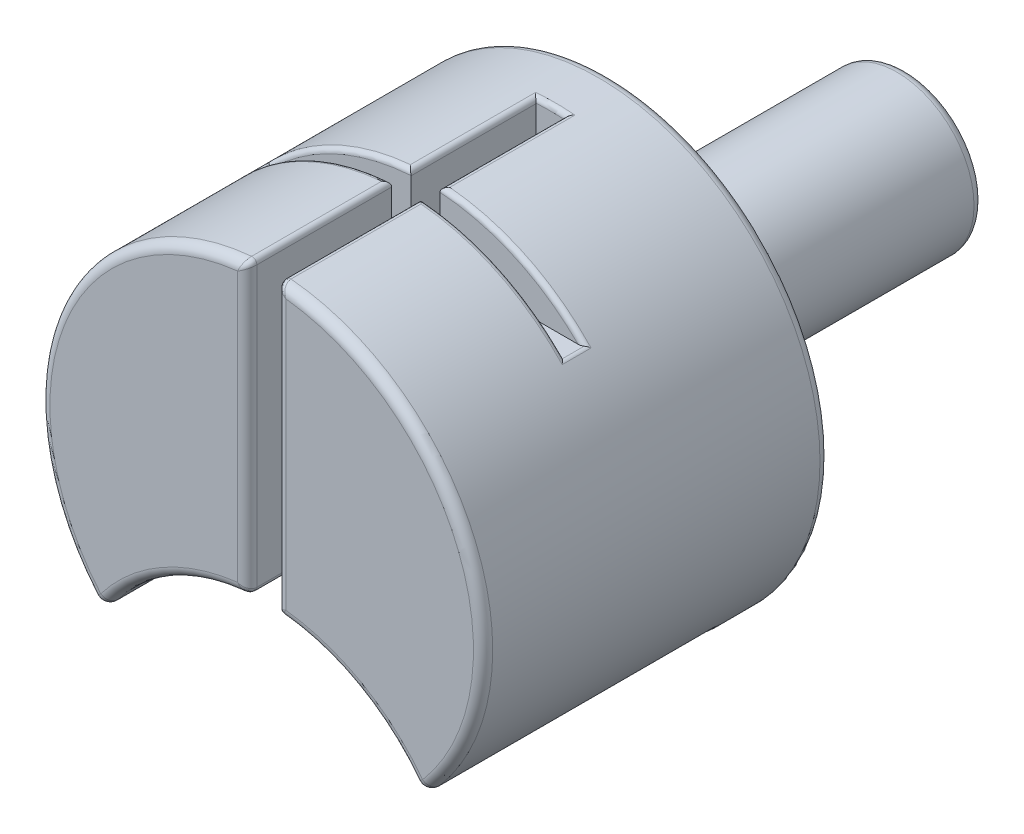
ISO-10303-21;
HEADER;
FILE_DESCRIPTION(('STEP AP214'),'2;1');
FILE_NAME('part.step','',(''),(''),'','','');
FILE_SCHEMA(('AUTOMOTIVE_DESIGN { 1 0 10303 214 1 1 1 1 }'));
ENDSEC;
DATA;
#1=APPLICATION_CONTEXT('core data for automotive mechanical design processes');
#2=APPLICATION_PROTOCOL_DEFINITION('international standard','automotive_design',2000,#1);
#3=PRODUCT_CONTEXT('',#1,'mechanical');
#4=PRODUCT('Part','Part','',(#3));
#5=PRODUCT_RELATED_PRODUCT_CATEGORY('part','',(#4));
#6=PRODUCT_DEFINITION_FORMATION('','',#4);
#7=PRODUCT_DEFINITION_CONTEXT('part definition',#1,'design');
#8=PRODUCT_DEFINITION('design','',#6,#7);
#9=PRODUCT_DEFINITION_SHAPE('','',#8);
#10=(LENGTH_UNIT() NAMED_UNIT(*) SI_UNIT(.MILLI.,.METRE.));
#11=(NAMED_UNIT(*) PLANE_ANGLE_UNIT() SI_UNIT($,.RADIAN.));
#12=(NAMED_UNIT(*) SI_UNIT($,.STERADIAN.) SOLID_ANGLE_UNIT());
#13=UNCERTAINTY_MEASURE_WITH_UNIT(LENGTH_MEASURE(1.E-05),#10,'distance_accuracy_value','');
#14=(GEOMETRIC_REPRESENTATION_CONTEXT(3) GLOBAL_UNCERTAINTY_ASSIGNED_CONTEXT((#13)) GLOBAL_UNIT_ASSIGNED_CONTEXT((#10,
#11,#12)) REPRESENTATION_CONTEXT('',''));
#15=CARTESIAN_POINT('',(0.,0.,0.));
#16=DIRECTION('',(0.,0.,1.));
#17=DIRECTION('',(1.,0.,0.));
#18=AXIS2_PLACEMENT_3D('',#15,#16,#17);
#19=CARTESIAN_POINT('',(0.,11.5,11.75));
#20=DIRECTION('',(0.,0.,-1.));
#21=DIRECTION('',(-1.,0.,0.));
#22=AXIS2_PLACEMENT_3D('',#19,#20,#21);
#23=PLANE('',#22);
#24=CARTESIAN_POINT('',(0.,-13.5,11.75));
#25=DIRECTION('',(0.,0.,-1.));
#26=DIRECTION('',(-1.,0.,0.));
#27=AXIS2_PLACEMENT_3D('',#24,#25,#26);
#28=CIRCLE('',#27,10.5);
#29=CARTESIAN_POINT('',(-8.36085988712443,-7.14814814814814,11.75));
#30=VERTEX_POINT('',#29);
#31=CARTESIAN_POINT('',(-1.25,-3.07467026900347,11.75));
#32=VERTEX_POINT('',#31);
#33=EDGE_CURVE('E890',#30,#32,#28,.T.);
#34=ORIENTED_EDGE('',*,*,#33,.T.);
#35=DIRECTION('',(0.,-1.,0.));
#36=VECTOR('',#35,1.);
#37=CARTESIAN_POINT('',(-1.25,11.5,11.75));
#38=LINE('',#37,#36);
#39=CARTESIAN_POINT('',(-1.25,10.9287464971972,11.75));
#40=VERTEX_POINT('',#39);
#41=EDGE_CURVE('E892',#32,#40,#38,.F.);
#42=ORIENTED_EDGE('',*,*,#41,.T.);
#43=CARTESIAN_POINT('',(0.,0.,11.75));
#44=DIRECTION('',(0.,0.,-1.));
#45=DIRECTION('',(-1.,0.,0.));
#46=AXIS2_PLACEMENT_3D('',#43,#44,#45);
#47=CIRCLE('',#46,11.);
#48=EDGE_CURVE('E888',#40,#30,#47,.F.);
#49=ORIENTED_EDGE('',*,*,#48,.T.);
#50=EDGE_LOOP('',(#34,#42,#49));
#51=FACE_BOUND('',#50,.T.);
#52=ADVANCED_FACE('F33',(#51),#23,.F.);
#53=CARTESIAN_POINT('',(0.,-13.5,11.75));
#54=DIRECTION('',(0.,0.,-1.));
#55=DIRECTION('',(-1.,0.,0.));
#56=AXIS2_PLACEMENT_3D('',#53,#54,#55);
#57=CIRCLE('',#56,10.5);
#58=CARTESIAN_POINT('',(1.25,-3.07467026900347,11.75));
#59=VERTEX_POINT('',#58);
#60=CARTESIAN_POINT('',(8.36085988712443,-7.14814814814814,11.75));
#61=VERTEX_POINT('',#60);
#62=EDGE_CURVE('E898',#59,#61,#57,.T.);
#63=ORIENTED_EDGE('',*,*,#62,.T.);
#64=CARTESIAN_POINT('',(0.,0.,11.75));
#65=DIRECTION('',(0.,0.,-1.));
#66=DIRECTION('',(-1.,0.,0.));
#67=AXIS2_PLACEMENT_3D('',#64,#65,#66);
#68=CIRCLE('',#67,11.);
#69=CARTESIAN_POINT('',(1.25,10.9287464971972,11.75));
#70=VERTEX_POINT('',#69);
#71=EDGE_CURVE('E900',#61,#70,#68,.F.);
#72=ORIENTED_EDGE('',*,*,#71,.T.);
#73=DIRECTION('',(0.,1.,0.));
#74=VECTOR('',#73,1.);
#75=CARTESIAN_POINT('',(1.25,11.5,11.75));
#76=LINE('',#75,#74);
#77=EDGE_CURVE('E895',#70,#59,#76,.F.);
#78=ORIENTED_EDGE('',*,*,#77,.T.);
#79=EDGE_LOOP('',(#63,#72,#78));
#80=FACE_BOUND('',#79,.T.);
#81=ADVANCED_FACE('F795',(#80),#23,.F.);
#82=CARTESIAN_POINT('',(0.,0.,-11.75));
#83=DIRECTION('',(0.,0.,1.));
#84=DIRECTION('',(1.,0.,0.));
#85=AXIS2_PLACEMENT_3D('',#82,#83,#84);
#86=PLANE('',#85);
#87=CARTESIAN_POINT('',(0.,0.,-11.75));
#88=DIRECTION('',(0.,0.,1.));
#89=DIRECTION('',(1.,0.,0.));
#90=AXIS2_PLACEMENT_3D('',#87,#88,#89);
#91=CIRCLE('',#90,1.25);
#92=CARTESIAN_POINT('',(1.25,0.,-11.75));
#93=VERTEX_POINT('',#92);
#94=EDGE_CURVE('E911',#93,#93,#91,.F.);
#95=ORIENTED_EDGE('',*,*,#94,.T.);
#96=EDGE_LOOP('',(#95));
#97=FACE_BOUND('',#96,.T.);
#98=ADVANCED_FACE('F800',(#97),#86,.F.);
#99=CARTESIAN_POINT('',(0.,0.,11.75));
#100=DIRECTION('',(0.,0.,1.));
#101=DIRECTION('',(1.,0.,0.));
#102=AXIS2_PLACEMENT_3D('',#99,#100,#101);
#103=CYLINDRICAL_SURFACE('',#102,1.75);
#104=CARTESIAN_POINT('',(0.,0.,-12.25));
#105=DIRECTION('',(0.,0.,1.));
#106=DIRECTION('',(1.,0.,0.));
#107=AXIS2_PLACEMENT_3D('',#104,#105,#106);
#108=CIRCLE('',#107,1.75);
#109=CARTESIAN_POINT('',(1.75,0.,-12.25));
#110=VERTEX_POINT('',#109);
#111=EDGE_CURVE('E908',#110,#110,#108,.T.);
#112=ORIENTED_EDGE('',*,*,#111,.T.);
#113=EDGE_LOOP('',(#112));
#114=FACE_BOUND('',#113,.T.);
#115=CARTESIAN_POINT('',(0.,0.,-21.25));
#116=DIRECTION('',(0.,0.,1.));
#117=DIRECTION('',(1.,0.,0.));
#118=AXIS2_PLACEMENT_3D('',#115,#116,#117);
#119=CIRCLE('',#118,1.75);
#120=CARTESIAN_POINT('',(1.75,0.,-21.25));
#121=VERTEX_POINT('',#120);
#122=EDGE_CURVE('E905',#121,#121,#119,.F.);
#123=ORIENTED_EDGE('',*,*,#122,.T.);
#124=EDGE_LOOP('',(#123));
#125=FACE_BOUND('',#124,.T.);
#126=ADVANCED_FACE('F806',(#114,#125),#103,.F.);
#127=CARTESIAN_POINT('',(0.,1.75,-21.75));
#128=DIRECTION('',(0.,0.,1.));
#129=DIRECTION('',(1.,0.,0.));
#130=AXIS2_PLACEMENT_3D('',#127,#128,#129);
#131=PLANE('',#130);
#132=CARTESIAN_POINT('',(0.,0.,-21.75));
#133=DIRECTION('',(0.,0.,1.));
#134=DIRECTION('',(1.,0.,0.));
#135=AXIS2_PLACEMENT_3D('',#132,#133,#134);
#136=CIRCLE('',#135,2.25);
#137=CARTESIAN_POINT('',(2.25,0.,-21.75));
#138=VERTEX_POINT('',#137);
#139=EDGE_CURVE('E829',#138,#138,#136,.T.);
#140=ORIENTED_EDGE('',*,*,#139,.T.);
#141=EDGE_LOOP('',(#140));
#142=FACE_BOUND('',#141,.T.);
#143=CARTESIAN_POINT('',(0.,0.,-21.75));
#144=DIRECTION('',(0.,0.,1.));
#145=DIRECTION('',(1.,0.,0.));
#146=AXIS2_PLACEMENT_3D('',#143,#144,#145);
#147=CIRCLE('',#146,3.5);
#148=CARTESIAN_POINT('',(3.5,0.,-21.75));
#149=VERTEX_POINT('',#148);
#150=EDGE_CURVE('E834',#149,#149,#147,.F.);
#151=ORIENTED_EDGE('',*,*,#150,.T.);
#152=EDGE_LOOP('',(#151));
#153=FACE_BOUND('',#152,.T.);
#154=ADVANCED_FACE('F810',(#142,#153),#131,.F.);
#155=CARTESIAN_POINT('',(0.,0.,11.75));
#156=DIRECTION('',(0.,0.,1.));
#157=DIRECTION('',(1.,0.,0.));
#158=AXIS2_PLACEMENT_3D('',#155,#156,#157);
#159=CYLINDRICAL_SURFACE('',#158,4.);
#160=CARTESIAN_POINT('',(0.,0.,-21.25));
#161=DIRECTION('',(0.,0.,1.));
#162=DIRECTION('',(1.,0.,0.));
#163=AXIS2_PLACEMENT_3D('',#160,#161,#162);
#164=CIRCLE('',#163,4.);
#165=CARTESIAN_POINT('',(4.,0.,-21.25));
#166=VERTEX_POINT('',#165);
#167=EDGE_CURVE('E824',#166,#166,#164,.T.);
#168=ORIENTED_EDGE('',*,*,#167,.T.);
#169=EDGE_LOOP('',(#168));
#170=FACE_BOUND('',#169,.T.);
#171=CARTESIAN_POINT('',(0.,0.,-6.75));
#172=DIRECTION('',(0.,0.,1.));
#173=DIRECTION('',(1.,0.,0.));
#174=AXIS2_PLACEMENT_3D('',#171,#172,#173);
#175=CIRCLE('',#174,4.);
#176=CARTESIAN_POINT('',(4.,0.,-6.75));
#177=VERTEX_POINT('',#176);
#178=EDGE_CURVE('E827',#177,#177,#175,.F.);
#179=ORIENTED_EDGE('',*,*,#178,.T.);
#180=EDGE_LOOP('',(#179));
#181=FACE_BOUND('',#180,.T.);
#182=ADVANCED_FACE('F813',(#170,#181),#159,.T.);
#183=CARTESIAN_POINT('',(0.,4.,-6.25));
#184=DIRECTION('',(0.,0.,1.));
#185=DIRECTION('',(1.,0.,0.));
#186=AXIS2_PLACEMENT_3D('',#183,#184,#185);
#187=PLANE('',#186);
#188=CARTESIAN_POINT('',(0.,0.,-6.25));
#189=DIRECTION('',(0.,0.,1.));
#190=DIRECTION('',(1.,0.,0.));
#191=AXIS2_PLACEMENT_3D('',#188,#189,#190);
#192=CIRCLE('',#191,4.5);
#193=CARTESIAN_POINT('',(4.5,0.,-6.25));
#194=VERTEX_POINT('',#193);
#195=EDGE_CURVE('E840',#194,#194,#192,.T.);
#196=ORIENTED_EDGE('',*,*,#195,.T.);
#197=EDGE_LOOP('',(#196));
#198=FACE_BOUND('',#197,.T.);
#199=CARTESIAN_POINT('',(0.,0.,-6.25));
#200=DIRECTION('',(0.,0.,1.));
#201=DIRECTION('',(1.,0.,0.));
#202=AXIS2_PLACEMENT_3D('',#199,#200,#201);
#203=CIRCLE('',#202,11.);
#204=CARTESIAN_POINT('',(11.,0.,-6.25));
#205=VERTEX_POINT('',#204);
#206=EDGE_CURVE('E831',#205,#205,#203,.F.);
#207=ORIENTED_EDGE('',*,*,#206,.T.);
#208=EDGE_LOOP('',(#207));
#209=FACE_BOUND('',#208,.T.);
#210=ADVANCED_FACE('F332',(#198,#209),#187,.F.);
#211=CARTESIAN_POINT('',(0.,0.,11.75));
#212=DIRECTION('',(0.,0.,1.));
#213=DIRECTION('',(1.,0.,0.));
#214=AXIS2_PLACEMENT_3D('',#211,#212,#213);
#215=CYLINDRICAL_SURFACE('',#214,11.5);
#216=CARTESIAN_POINT('',(0.,0.,11.25));
#217=DIRECTION('',(0.,0.,-1.));
#218=DIRECTION('',(-1.,0.,0.));
#219=AXIS2_PLACEMENT_3D('',#216,#217,#218);
#220=CIRCLE('',#219,11.5);
#221=CARTESIAN_POINT('',(-8.74089897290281,-7.47306397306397,11.25));
#222=VERTEX_POINT('',#221);
#223=CARTESIAN_POINT('',(-1.02222222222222,11.4544778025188,11.25));
#224=VERTEX_POINT('',#223);
#225=EDGE_CURVE('E875',#222,#224,#220,.T.);
#226=ORIENTED_EDGE('',*,*,#225,.T.);
#227=DIRECTION('',(0.,0.,1.));
#228=VECTOR('',#227,1.);
#229=CARTESIAN_POINT('',(-1.02222222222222,11.4544778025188,11.75));
#230=LINE('',#229,#228);
#231=CARTESIAN_POINT('',(-1.02222222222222,11.4544778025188,4.5));
#232=VERTEX_POINT('',#231);
#233=EDGE_CURVE('E961',#224,#232,#230,.F.);
#234=ORIENTED_EDGE('',*,*,#233,.T.);
#235=CARTESIAN_POINT('',(0.,0.,4.5));
#236=DIRECTION('',(0.,0.,1.));
#237=DIRECTION('',(1.,0.,0.));
#238=AXIS2_PLACEMENT_3D('',#235,#236,#237);
#239=CIRCLE('',#238,11.5);
#240=CARTESIAN_POINT('',(-8.3596831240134,7.89719558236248,4.5));
#241=VERTEX_POINT('',#240);
#242=EDGE_CURVE('E969',#232,#241,#239,.T.);
#243=ORIENTED_EDGE('',*,*,#242,.T.);
#244=DIRECTION('',(0.,0.,1.));
#245=VECTOR('',#244,1.);
#246=CARTESIAN_POINT('',(-8.3596831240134,7.89719558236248,11.75));
#247=LINE('',#246,#245);
#248=CARTESIAN_POINT('',(-8.3596831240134,7.89719558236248,3.));
#249=VERTEX_POINT('',#248);
#250=EDGE_CURVE('E1121',#241,#249,#247,.F.);
#251=ORIENTED_EDGE('',*,*,#250,.T.);
#252=CARTESIAN_POINT('',(0.,0.,3.));
#253=DIRECTION('',(0.,0.,-1.));
#254=DIRECTION('',(-1.,0.,0.));
#255=AXIS2_PLACEMENT_3D('',#252,#253,#254);
#256=CIRCLE('',#255,11.5);
#257=CARTESIAN_POINT('',(-1.02222222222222,11.4544778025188,3.));
#258=VERTEX_POINT('',#257);
#259=EDGE_CURVE('E1120',#249,#258,#256,.T.);
#260=ORIENTED_EDGE('',*,*,#259,.T.);
#261=DIRECTION('',(0.,0.,1.));
#262=VECTOR('',#261,1.);
#263=CARTESIAN_POINT('',(-1.02222222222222,11.4544778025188,11.75));
#264=LINE('',#263,#262);
#265=CARTESIAN_POINT('',(-1.02222222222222,11.4544778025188,-3.5));
#266=VERTEX_POINT('',#265);
#267=EDGE_CURVE('E1125',#258,#266,#264,.F.);
#268=ORIENTED_EDGE('',*,*,#267,.T.);
#269=CARTESIAN_POINT('',(0.,0.,-3.5));
#270=DIRECTION('',(0.,0.,1.));
#271=DIRECTION('',(1.,0.,0.));
#272=AXIS2_PLACEMENT_3D('',#269,#270,#271);
#273=CIRCLE('',#272,11.5);
#274=CARTESIAN_POINT('',(1.02222222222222,11.4544778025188,-3.5));
#275=VERTEX_POINT('',#274);
#276=EDGE_CURVE('E1054',#266,#275,#273,.F.);
#277=ORIENTED_EDGE('',*,*,#276,.T.);
#278=DIRECTION('',(0.,0.,1.));
#279=VECTOR('',#278,1.);
#280=CARTESIAN_POINT('',(1.02222222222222,11.4544778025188,11.75));
#281=LINE('',#280,#279);
#282=CARTESIAN_POINT('',(1.02222222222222,11.4544778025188,3.));
#283=VERTEX_POINT('',#282);
#284=EDGE_CURVE('E1048',#275,#283,#281,.T.);
#285=ORIENTED_EDGE('',*,*,#284,.T.);
#286=CARTESIAN_POINT('',(0.,0.,3.));
#287=DIRECTION('',(0.,0.,-1.));
#288=DIRECTION('',(-1.,0.,0.));
#289=AXIS2_PLACEMENT_3D('',#286,#287,#288);
#290=CIRCLE('',#289,11.5);
#291=CARTESIAN_POINT('',(8.3596831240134,7.89719558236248,3.));
#292=VERTEX_POINT('',#291);
#293=EDGE_CURVE('E1044',#283,#292,#290,.T.);
#294=ORIENTED_EDGE('',*,*,#293,.T.);
#295=DIRECTION('',(0.,0.,1.));
#296=VECTOR('',#295,1.);
#297=CARTESIAN_POINT('',(8.3596831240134,7.89719558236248,11.75));
#298=LINE('',#297,#296);
#299=CARTESIAN_POINT('',(8.3596831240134,7.89719558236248,4.5));
#300=VERTEX_POINT('',#299);
#301=EDGE_CURVE('E1086',#292,#300,#298,.T.);
#302=ORIENTED_EDGE('',*,*,#301,.T.);
#303=CARTESIAN_POINT('',(0.,0.,4.5));
#304=DIRECTION('',(0.,0.,1.));
#305=DIRECTION('',(1.,0.,0.));
#306=AXIS2_PLACEMENT_3D('',#303,#304,#305);
#307=CIRCLE('',#306,11.5);
#308=CARTESIAN_POINT('',(1.02222222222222,11.4544778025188,4.5));
#309=VERTEX_POINT('',#308);
#310=EDGE_CURVE('E1083',#300,#309,#307,.T.);
#311=ORIENTED_EDGE('',*,*,#310,.T.);
#312=DIRECTION('',(0.,0.,1.));
#313=VECTOR('',#312,1.);
#314=CARTESIAN_POINT('',(1.02222222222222,11.4544778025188,11.75));
#315=LINE('',#314,#313);
#316=CARTESIAN_POINT('',(1.02222222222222,11.4544778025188,11.25));
#317=VERTEX_POINT('',#316);
#318=EDGE_CURVE('E973',#309,#317,#315,.T.);
#319=ORIENTED_EDGE('',*,*,#318,.T.);
#320=CARTESIAN_POINT('',(0.,0.,11.25));
#321=DIRECTION('',(0.,0.,-1.));
#322=DIRECTION('',(-1.,0.,0.));
#323=AXIS2_PLACEMENT_3D('',#320,#321,#322);
#324=CIRCLE('',#323,11.5);
#325=CARTESIAN_POINT('',(8.74089897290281,-7.47306397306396,11.25));
#326=VERTEX_POINT('',#325);
#327=EDGE_CURVE('E957',#317,#326,#324,.T.);
#328=ORIENTED_EDGE('',*,*,#327,.T.);
#329=DIRECTION('',(0.,0.,1.));
#330=VECTOR('',#329,1.);
#331=CARTESIAN_POINT('',(8.74089897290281,-7.47306397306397,11.75));
#332=LINE('',#331,#330);
#333=CARTESIAN_POINT('',(8.74089897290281,-7.47306397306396,-2.75));
#334=VERTEX_POINT('',#333);
#335=EDGE_CURVE('E953',#326,#334,#332,.F.);
#336=ORIENTED_EDGE('',*,*,#335,.T.);
#337=CARTESIAN_POINT('',(7.94796568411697,-7.47566094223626,-2.58822288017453));
#338=CARTESIAN_POINT('',(8.32671193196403,-7.95286213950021,-2.6279381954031));
#339=CARTESIAN_POINT('',(8.70341098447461,-7.51669057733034,-2.42644576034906));
#340=CARTESIAN_POINT('',(7.95286542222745,-7.46739480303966,-2.614166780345));
#341=CARTESIAN_POINT('',(8.33054556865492,-7.94989165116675,-2.64885918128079));
#342=CARTESIAN_POINT('',(8.71583717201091,-7.50228378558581,-2.47833356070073));
#343=CARTESIAN_POINT('',(7.95655571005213,-7.46113313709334,-2.64088319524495));
#344=CARTESIAN_POINT('',(8.33334031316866,-7.94778603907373,-2.66930714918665));
#345=CARTESIAN_POINT('',(8.72521091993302,-7.49137574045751,-2.53176639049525));
#346=CARTESIAN_POINT('',(7.96148353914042,-7.45274718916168,-2.69506643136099));
#347=CARTESIAN_POINT('',(8.33701934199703,-7.94505652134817,-2.70987002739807));
#348=CARTESIAN_POINT('',(8.73773824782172,-7.4767706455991,-2.64013286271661));
#349=CARTESIAN_POINT('',(7.96272316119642,-7.45061939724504,-2.7225325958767));
#350=CARTESIAN_POINT('',(8.33789348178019,-7.9444402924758,-2.72992157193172));
#351=CARTESIAN_POINT('',(8.74089710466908,-7.47306747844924,-2.69506519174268));
#352=CARTESIAN_POINT('',(7.96272424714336,-7.45061515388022,-2.77768544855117));
#353=CARTESIAN_POINT('',(8.33788747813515,-7.94444862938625,-2.77023788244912));
#354=CARTESIAN_POINT('',(8.74090085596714,-7.4730604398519,-2.80537089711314));
#355=CARTESIAN_POINT('',(7.96146596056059,-7.45277258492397,-2.8053721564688));
#356=CARTESIAN_POINT('',(8.33699336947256,-7.94508306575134,-2.79043585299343));
#357=CARTESIAN_POINT('',(8.73769542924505,-7.47681553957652,-2.86074431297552));
#358=CARTESIAN_POINT('',(7.95645773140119,-7.46130460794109,-2.85994243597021));
#359=CARTESIAN_POINT('',(8.33328080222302,-7.94782258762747,-2.83133242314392));
#360=CARTESIAN_POINT('',(8.72495988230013,-7.49167367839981,-2.96988487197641));
#361=CARTESIAN_POINT('',(7.95270828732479,-7.46767835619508,-2.88682616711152));
#362=CARTESIAN_POINT('',(8.33047481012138,-7.94991830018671,-2.85196472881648));
#363=CARTESIAN_POINT('',(8.71543102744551,-7.50277524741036,-3.02365233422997));
#364=CARTESIAN_POINT('',(7.94279144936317,-7.48437014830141,-2.93900862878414));
#365=CARTESIAN_POINT('',(8.32263218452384,-7.95605367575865,-2.89385936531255));
#366=CARTESIAN_POINT('',(8.69029693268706,-7.53187254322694,-3.12801725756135));
#367=CARTESIAN_POINT('',(7.93662686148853,-7.49468361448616,-2.96430915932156));
#368=CARTESIAN_POINT('',(8.31762249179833,-7.9600708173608,-2.91505979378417));
#369=CARTESIAN_POINT('',(8.67469874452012,-7.54986026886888,-3.17861831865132));
#370=CARTESIAN_POINT('',(7.92197949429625,-7.51886227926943,-3.01270560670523));
#371=CARTESIAN_POINT('',(8.30498737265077,-7.97063543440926,-2.95785920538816));
#372=CARTESIAN_POINT('',(8.6377720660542,-7.5920799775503,-3.27541121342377));
#373=CARTESIAN_POINT('',(7.91349343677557,-7.53273249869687,-3.03579834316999));
#374=CARTESIAN_POINT('',(8.29739352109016,-7.97715409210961,-2.97941082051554));
#375=CARTESIAN_POINT('',(8.61643547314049,-7.61632078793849,-3.32159668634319));
#376=CARTESIAN_POINT('',(7.89425135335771,-7.56366669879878,-3.07937332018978));
#377=CARTESIAN_POINT('',(8.27919104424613,-7.99327797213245,-3.02239574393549));
#378=CARTESIAN_POINT('',(8.56826987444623,-7.67046769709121,-3.4087466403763));
#379=CARTESIAN_POINT('',(7.88347133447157,-7.58076420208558,-3.0998239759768));
#380=CARTESIAN_POINT('',(8.26859208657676,-8.00287494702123,-3.04380072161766));
#381=CARTESIAN_POINT('',(8.54138291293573,-7.70043330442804,-3.44964795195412));
#382=CARTESIAN_POINT('',(7.85989591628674,-7.61743419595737,-3.13728371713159));
#383=CARTESIAN_POINT('',(8.24429170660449,-8.0253452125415,-3.08518933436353));
#384=CARTESIAN_POINT('',(8.48288445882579,-7.76482842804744,-3.52456743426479));
#385=CARTESIAN_POINT('',(7.84710025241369,-7.63700701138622,-3.1542923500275));
#386=CARTESIAN_POINT('',(8.2306321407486,-8.03817536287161,-3.10517467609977));
#387=CARTESIAN_POINT('',(8.45127234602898,-7.79925853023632,-3.55858470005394));
#388=CARTESIAN_POINT('',(7.81946559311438,-7.67836958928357,-3.18473044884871));
#389=CARTESIAN_POINT('',(8.20003797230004,-8.06726802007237,-3.14289739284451));
#390=CARTESIAN_POINT('',(8.38338333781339,-7.87219222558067,-3.61946089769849));
#391=CARTESIAN_POINT('',(7.80459112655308,-7.70019560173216,-3.19808229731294));
#392=CARTESIAN_POINT('',(8.18307490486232,-8.08356023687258,-3.16061764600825));
#393=CARTESIAN_POINT('',(8.34702640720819,-7.91076302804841,-3.64616459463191));
#394=CARTESIAN_POINT('',(7.77333626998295,-7.74497128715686,-3.22037735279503));
#395=CARTESIAN_POINT('',(8.14647863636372,-8.11892158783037,-3.19211069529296));
#396=CARTESIAN_POINT('',(8.27109415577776,-7.99011961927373,-3.69075470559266));
#397=CARTESIAN_POINT('',(7.7569578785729,-7.76791945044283,-3.22932631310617));
#398=CARTESIAN_POINT('',(8.12686667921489,-8.13796780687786,-3.20594095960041));
#399=CARTESIAN_POINT('',(8.23152311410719,-8.03090243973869,-3.7086526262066));
#400=CARTESIAN_POINT('',(7.72290698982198,-7.81444337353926,-3.24264752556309));
#401=CARTESIAN_POINT('',(8.08541509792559,-8.17828700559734,-3.22878831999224));
#402=CARTESIAN_POINT('',(8.14976488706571,-8.11386152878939,-3.73529505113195));
#403=CARTESIAN_POINT('',(7.70522442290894,-7.83802286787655,-3.24697904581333));
#404=CARTESIAN_POINT('',(8.0635526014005,-8.19958215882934,-3.23782547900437));
#405=CARTESIAN_POINT('',(8.1075578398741,-8.15604686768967,-3.74395809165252));
#406=CARTESIAN_POINT('',(7.66915239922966,-7.8848907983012,-3.25078509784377));
#407=CARTESIAN_POINT('',(8.01858523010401,-8.24332923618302,-3.25020079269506));
#408=CARTESIAN_POINT('',(8.0219944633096,-8.24021924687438,-3.7515701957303));
#409=CARTESIAN_POINT('',(7.65076290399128,-7.90817921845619,-3.25025936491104));
#410=CARTESIAN_POINT('',(7.99545760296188,-8.26580373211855,-3.25359606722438));
#411=CARTESIAN_POINT('',(7.97863807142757,-8.28220627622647,-3.75051872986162));
#412=CARTESIAN_POINT('',(7.61391507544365,-7.95364015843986,-3.24434737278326));
#413=CARTESIAN_POINT('',(7.94906187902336,-8.31076265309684,-3.25432146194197));
#414=CARTESIAN_POINT('',(7.89229540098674,-8.36451926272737,-3.7386947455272));
#415=CARTESIAN_POINT('',(7.59545781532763,-7.97581852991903,-3.23899026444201));
#416=CARTESIAN_POINT('',(7.92576016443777,-8.33328125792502,-3.25172918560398));
#417=CARTESIAN_POINT('',(7.8493084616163,-8.40485366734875,-3.72798052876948));
#418=CARTESIAN_POINT('',(7.55892636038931,-8.01864590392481,-3.22360210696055));
#419=CARTESIAN_POINT('',(7.87982444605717,-8.3775359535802,-3.24067440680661));
#420=CARTESIAN_POINT('',(7.76470694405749,-8.48308650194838,-3.69720421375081));
#421=CARTESIAN_POINT('',(7.5408526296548,-8.03929312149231,-3.2135656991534));
#422=CARTESIAN_POINT('',(7.85715002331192,-8.39931153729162,-3.23222613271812));
#423=CARTESIAN_POINT('',(7.72309399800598,-8.52098208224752,-3.67713139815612));
#424=CARTESIAN_POINT('',(7.52327311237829,-8.05886738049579,-3.20126908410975));
#425=CARTESIAN_POINT('',(7.83525974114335,-8.42025282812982,-3.22083788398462));
#426=CARTESIAN_POINT('',(7.68285120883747,-8.55709046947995,-3.65253816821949));
#427=(BOUNDED_SURFACE() B_SPLINE_SURFACE(3,2,((#337,#338,#339),(#340,#341,#342),(#343,#344,
#345),(#346,#347,#348),(#349,#350,#351),(#352,#353,#354),(#355,#356,#357),(#358,#359,#360),
(#361,#362,#363),(#364,#365,#366),(#367,#368,#369),(#370,#371,#372),(#373,#374,#375),(#376,#377,
#378),(#379,#380,#381),(#382,#383,#384),(#385,#386,#387),(#388,#389,#390),(#391,#392,#393),
(#394,#395,#396),(#397,#398,#399),(#400,#401,#402),(#403,#404,#405),(#406,#407,#408),(#409,#410,
#411),(#412,#413,#414),(#415,#416,#417),(#418,#419,#420),(#421,#422,#423),(#424,#425,#426)),
.UNSPECIFIED.,.F.,.F.,.F.) B_SPLINE_SURFACE_WITH_KNOTS((4,2,2,2,2,2,2,2,2,2,2,2,2,2,4),(3,3),
(0.,0.164751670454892,0.329363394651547,0.495281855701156,0.661167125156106,0.826860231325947,
0.99278853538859,1.16054604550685,1.32832559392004,1.49943040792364,1.67031103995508,
1.84268689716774,2.01507214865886,2.18642419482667,2.35797295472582),(0.,1.),
.UNSPECIFIED.) GEOMETRIC_REPRESENTATION_ITEM() RATIONAL_B_SPLINE_SURFACE(((1.,0.633598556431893,
1.),(1.,0.631655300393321,1.),(1.,0.630167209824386,1.),(1.,0.628163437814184,1.),(1.,
0.627646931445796,1.),(1.,0.62764488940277,1.),(1.,0.628167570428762,1.),(1.,0.63021020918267,
1.),(1.,0.63172996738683,1.),(1.,0.635637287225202,1.),(1.,0.638023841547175,1.),(1.,
0.643479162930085,1.),(1.,0.646548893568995,1.),(1.,0.653180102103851,1.),(1.,0.656746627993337,
1.),(1.,0.664103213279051,1.),(1.,0.667893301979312,1.),(1.,0.675541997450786,1.),(1.,
0.679400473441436,1.),(1.,0.686891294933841,1.),(1.,0.690523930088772,1.),(1.,0.697427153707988,
1.),(1.,0.700694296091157,1.),(1.,0.706705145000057,1.),(1.,0.709448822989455,1.),(1.,
0.714325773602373,1.),(1.,0.716462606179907,1.),(1.,0.720150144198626,1.),(1.,0.721700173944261,
1.),(1.,0.722955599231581,1.))) REPRESENTATION_ITEM('') SURFACE());
#428=CARTESIAN_POINT('',(7.68285120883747,-8.55709046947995,-3.65253816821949));
#429=CARTESIAN_POINT('',(7.72309399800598,-8.52098208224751,-3.67713139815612));
#430=CARTESIAN_POINT('',(7.76470694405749,-8.48308650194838,-3.69720421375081));
#431=CARTESIAN_POINT('',(7.8493084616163,-8.40485366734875,-3.72798052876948));
#432=CARTESIAN_POINT('',(7.89229540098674,-8.36451926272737,-3.7386947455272));
#433=CARTESIAN_POINT('',(7.97863807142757,-8.28220627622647,-3.75051872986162));
#434=CARTESIAN_POINT('',(8.02199446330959,-8.24021924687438,-3.7515701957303));
#435=CARTESIAN_POINT('',(8.1075578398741,-8.15604686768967,-3.74395809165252));
#436=CARTESIAN_POINT('',(8.14976488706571,-8.11386152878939,-3.73529505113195));
#437=CARTESIAN_POINT('',(8.23152311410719,-8.03090243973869,-3.7086526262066));
#438=CARTESIAN_POINT('',(8.27109415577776,-7.99011961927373,-3.69075470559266));
#439=CARTESIAN_POINT('',(8.34702640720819,-7.91076302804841,-3.64616459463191));
#440=CARTESIAN_POINT('',(8.38338333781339,-7.87219222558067,-3.61946089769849));
#441=CARTESIAN_POINT('',(8.45127234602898,-7.79925853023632,-3.55858470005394));
#442=CARTESIAN_POINT('',(8.48288445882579,-7.76482842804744,-3.52456743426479));
#443=CARTESIAN_POINT('',(8.54138291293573,-7.70043330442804,-3.44964795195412));
#444=CARTESIAN_POINT('',(8.56826987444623,-7.67046769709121,-3.4087466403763));
#445=CARTESIAN_POINT('',(8.61643547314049,-7.61632078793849,-3.32159668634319));
#446=CARTESIAN_POINT('',(8.6377720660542,-7.5920799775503,-3.27541121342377));
#447=CARTESIAN_POINT('',(8.67469874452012,-7.54986026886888,-3.17861831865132));
#448=CARTESIAN_POINT('',(8.69029693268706,-7.53187254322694,-3.12801725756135));
#449=CARTESIAN_POINT('',(8.71543102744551,-7.50277524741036,-3.02365233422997));
#450=CARTESIAN_POINT('',(8.72495988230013,-7.49167367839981,-2.9698848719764));
#451=CARTESIAN_POINT('',(8.73769542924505,-7.47681553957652,-2.86074431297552));
#452=CARTESIAN_POINT('',(8.74090085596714,-7.4730604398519,-2.80537089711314));
#453=CARTESIAN_POINT('',(8.74089710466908,-7.47306747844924,-2.69506519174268));
#454=CARTESIAN_POINT('',(8.73773824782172,-7.4767706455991,-2.64013286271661));
#455=CARTESIAN_POINT('',(8.72521091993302,-7.49137574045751,-2.53176639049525));
#456=CARTESIAN_POINT('',(8.71583717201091,-7.50228378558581,-2.47833356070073));
#457=CARTESIAN_POINT('',(8.70341098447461,-7.51669057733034,-2.42644576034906));
#458=B_SPLINE_CURVE_WITH_KNOTS('',3,(#428,#429,#430,#431,#432,#433,#434,#435,#436,#437,#438,
#439,#440,#441,#442,#443,#444,#445,#446,#447,#448,#449,#450,#451,#452,#453,#454,#455,#456,#457),
.UNSPECIFIED.,.F.,.F.,(4,2,2,2,2,2,2,2,2,2,2,2,2,2,4),(0.,0.171548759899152,0.342900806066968,
0.51528605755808,0.687661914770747,0.858542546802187,1.02964736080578,1.19742690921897,
1.36518441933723,1.53111272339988,1.69680582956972,1.86269109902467,2.02860956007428,
2.19322128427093,2.35797295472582),.UNSPECIFIED.);
#459=CARTESIAN_POINT('',(8.0143097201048,-8.24747474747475,-3.75));
#460=VERTEX_POINT('',#459);
#461=EDGE_CURVE('E948',#460,#334,#458,.T.);
#462=ORIENTED_EDGE('',*,*,#461,.F.);
#463=CARTESIAN_POINT('',(0.,0.,-3.75));
#464=DIRECTION('',(0.,0.,1.));
#465=DIRECTION('',(1.,0.,0.));
#466=AXIS2_PLACEMENT_3D('',#463,#464,#465);
#467=CIRCLE('',#466,11.5);
#468=CARTESIAN_POINT('',(-8.0143097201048,-8.24747474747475,-3.75));
#469=VERTEX_POINT('',#468);
#470=EDGE_CURVE('E320',#460,#469,#467,.F.);
#471=ORIENTED_EDGE('',*,*,#470,.T.);
#472=CARTESIAN_POINT('',(-7.55665150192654,-8.02107720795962,-3.22160236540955));
#473=CARTESIAN_POINT('',(-7.87694548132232,-8.38027640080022,-3.23867094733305));
#474=CARTESIAN_POINT('',(-7.75954481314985,-8.48760651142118,-3.6932047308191));
#475=CARTESIAN_POINT('',(-7.57463639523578,-8.00042029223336,-3.2310262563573));
#476=CARTESIAN_POINT('',(-7.89953624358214,-8.35857742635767,-3.24647216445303));
#477=CARTESIAN_POINT('',(-7.8010025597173,-8.44972925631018,-3.71205251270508));
#478=CARTESIAN_POINT('',(-7.59291572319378,-7.97886278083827,-3.23812731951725));
#479=CARTESIAN_POINT('',(-7.9225832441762,-8.3363511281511,-3.25123460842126));
#480=CARTESIAN_POINT('',(-7.8433931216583,-8.41039459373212,-3.72625463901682));
#481=CARTESIAN_POINT('',(-7.62950005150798,-7.93459184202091,-3.24761080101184));
#482=CARTESIAN_POINT('',(-7.96867944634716,-8.29177096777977,-3.25495428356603));
#483=CARTESIAN_POINT('',(-7.92873466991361,-8.32997532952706,-3.74522160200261));
#484=CARTESIAN_POINT('',(-7.64780500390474,-7.911879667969,-3.24999822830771));
#485=CARTESIAN_POINT('',(-7.99176665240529,-8.26937970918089,-3.25388487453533));
#486=CARTESIAN_POINT('',(-7.97168501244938,-8.28889263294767,-3.74999645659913));
#487=CARTESIAN_POINT('',(-7.68409844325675,-7.86566827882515,-3.2500017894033));
#488=CARTESIAN_POINT('',(-8.03725755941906,-8.22517647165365,-3.24604537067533));
#489=CARTESIAN_POINT('',(-8.05736053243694,-8.2056428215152,-3.75000357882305));
#490=CARTESIAN_POINT('',(-7.70208193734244,-7.84216346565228,-3.24756998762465));
#491=CARTESIAN_POINT('',(-8.0596791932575,-8.20334552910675,-3.23916673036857));
#492=CARTESIAN_POINT('',(-8.10007916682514,-8.16346897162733,-3.74513997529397));
#493=CARTESIAN_POINT('',(-7.73705928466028,-7.79529795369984,-3.23793940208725));
#494=CARTESIAN_POINT('',(-8.10273519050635,-8.16143584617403,-3.22024137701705));
#495=CARTESIAN_POINT('',(-8.18366286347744,-8.07967559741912,-3.72587880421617));
#496=CARTESIAN_POINT('',(-7.75405316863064,-7.77193725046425,-3.23074076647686));
#497=CARTESIAN_POINT('',(-8.12338076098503,-8.14134631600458,-3.20813317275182));
#498=CARTESIAN_POINT('',(-8.22452798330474,-8.03805605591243,-3.71148153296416));
#499=CARTESIAN_POINT('',(-7.78662487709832,-7.72611264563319,-3.21179588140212));
#500=CARTESIAN_POINT('',(-8.16217759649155,-8.10372635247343,-3.17964909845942));
#501=CARTESIAN_POINT('',(-8.30330190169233,-7.95665679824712,-3.67359176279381));
#502=CARTESIAN_POINT('',(-7.8022038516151,-7.70364802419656,-3.20005336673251));
#503=CARTESIAN_POINT('',(-8.18032129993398,-8.08620464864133,-3.16321810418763));
#504=CARTESIAN_POINT('',(-8.34121309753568,-7.91687560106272,-3.65010673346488));
#505=CARTESIAN_POINT('',(-7.83163799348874,-7.66030706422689,-3.17232487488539));
#506=CARTESIAN_POINT('',(-8.21368897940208,-8.0542367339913,-3.12718294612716));
#507=CARTESIAN_POINT('',(-8.41322050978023,-7.84031179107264,-3.59464974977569));
#508=CARTESIAN_POINT('',(-7.84549075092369,-7.63943296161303,-3.15633306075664));
#509=CARTESIAN_POINT('',(-8.22887924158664,-8.0398264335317,-3.10753309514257));
#510=CARTESIAN_POINT('',(-8.4473113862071,-7.80353339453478,-3.56266612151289));
#511=CARTESIAN_POINT('',(-7.87117496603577,-7.60001887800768,-3.12052697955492));
#512=CARTESIAN_POINT('',(-8.2561071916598,-8.01434862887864,-3.06628769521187));
#513=CARTESIAN_POINT('',(-8.51081760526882,-7.73422259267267,-3.49105395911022));
#514=CARTESIAN_POINT('',(-7.88300453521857,-7.58148108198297,-3.10070917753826));
#515=CARTESIAN_POINT('',(-8.26809871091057,-8.00332929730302,-3.04467702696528));
#516=CARTESIAN_POINT('',(-8.54022857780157,-7.70169416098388,-3.45141835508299));
#517=CARTESIAN_POINT('',(-7.90439402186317,-7.54745505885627,-3.05780051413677));
#518=CARTESIAN_POINT('',(-8.28895836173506,-7.98454668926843,-3.00069087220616));
#519=CARTESIAN_POINT('',(-8.59361916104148,-7.64207531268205,-3.36560102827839));
#520=CARTESIAN_POINT('',(-7.91395424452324,-7.53196642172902,-3.03471009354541));
#521=CARTESIAN_POINT('',(-8.29777939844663,-7.97683066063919,-2.97833446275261));
#522=CARTESIAN_POINT('',(-8.61759950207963,-7.61498416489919,-3.31942018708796));
#523=CARTESIAN_POINT('',(-7.93053188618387,-7.50480208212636,-2.98616884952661));
#524=CARTESIAN_POINT('',(-8.31248943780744,-7.96429490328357,-2.93398681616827));
#525=CARTESIAN_POINT('',(-8.65930922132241,-7.56751974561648,-3.22233769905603));
#526=CARTESIAN_POINT('',(-7.93757613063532,-7.49308629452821,-2.96074679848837));
#527=CARTESIAN_POINT('',(-8.31836901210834,-7.95948254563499,-2.9120381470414));
#528=CARTESIAN_POINT('',(-8.67710448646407,-7.54707582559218,-3.17149359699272));
#529=CARTESIAN_POINT('',(-7.94912654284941,-7.4737351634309,-2.90809191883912));
#530=CARTESIAN_POINT('',(-8.32771177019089,-7.95203695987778,-2.86870850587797));
#531=CARTESIAN_POINT('',(-8.70634152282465,-7.51332937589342,-3.06618383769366));
#532=CARTESIAN_POINT('',(-7.95363658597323,-7.4660935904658,-2.88086192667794));
#533=CARTESIAN_POINT('',(-8.33114880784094,-7.94942597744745,-2.84738964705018));
#534=CARTESIAN_POINT('',(-8.71779299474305,-7.50001594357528,-3.01172385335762));
#535=CARTESIAN_POINT('',(-7.95998625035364,-7.45530170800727,-2.8259048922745));
#536=CARTESIAN_POINT('',(-8.33591917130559,-7.94586075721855,-2.805633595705));
#537=CARTESIAN_POINT('',(-8.73392921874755,-7.48121870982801,-2.90180978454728));
#538=CARTESIAN_POINT('',(-7.96187645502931,-7.45206634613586,-2.79819803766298));
#539=CARTESIAN_POINT('',(-8.33727697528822,-7.94488692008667,-2.78525294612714));
#540=CARTESIAN_POINT('',(-8.7387421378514,-7.47558663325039,-2.84639607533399));
#541=CARTESIAN_POINT('',(-7.96311670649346,-7.44994506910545,-2.7425768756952));
#542=CARTESIAN_POINT('',(-8.33817529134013,-7.94423901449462,-2.7445429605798));
#543=CARTESIAN_POINT('',(-8.74189946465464,-7.47189372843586,-2.73515375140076));
#544=CARTESIAN_POINT('',(-7.96246616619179,-7.45106015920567,-2.71466252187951));
#545=CARTESIAN_POINT('',(-8.33771239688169,-7.94456739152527,-2.72428189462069));
#546=CARTESIAN_POINT('',(-8.74024237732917,-7.47383465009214,-2.67932504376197));
#547=CARTESIAN_POINT('',(-7.95865734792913,-7.45756141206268,-2.6597971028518));
#548=CARTESIAN_POINT('',(-8.33491988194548,-7.94660654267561,-2.68357736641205));
#549=CARTESIAN_POINT('',(-8.73055165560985,-7.48515446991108,-2.56959420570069));
#550=CARTESIAN_POINT('',(-7.95553047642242,-7.46289408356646,-2.63283836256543));
#551=CARTESIAN_POINT('',(-8.33262266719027,-7.94829336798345,-2.66320595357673));
#552=CARTESIAN_POINT('',(-8.72259788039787,-7.49444021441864,-2.51567672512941));
#553=CARTESIAN_POINT('',(-7.94687050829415,-7.47751664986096,-2.5802500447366));
#554=CARTESIAN_POINT('',(-8.32588420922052,-7.95348869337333,-2.6218803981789));
#555=CARTESIAN_POINT('',(-8.70063018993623,-7.51992369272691,-2.41050008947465));
#556=CARTESIAN_POINT('',(-7.94133606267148,-7.48680876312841,-2.55462122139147));
#557=CARTESIAN_POINT('',(-8.32146274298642,-7.95698112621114,-2.60098649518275));
#558=CARTESIAN_POINT('',(-8.68661287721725,-7.53612530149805,-2.35924244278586));
#559=CARTESIAN_POINT('',(-7.93463095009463,-7.4979535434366,-2.53003601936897));
#560=CARTESIAN_POINT('',(-8.31582122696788,-7.9616075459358,-2.57963394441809));
#561=CARTESIAN_POINT('',(-8.66967722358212,-7.55557389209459,-2.31007203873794));
#562=(BOUNDED_SURFACE() B_SPLINE_SURFACE(3,2,((#472,#473,#474),(#475,#476,#477),(#478,#479,
#480),(#481,#482,#483),(#484,#485,#486),(#487,#488,#489),(#490,#491,#492),(#493,#494,#495),
(#496,#497,#498),(#499,#500,#501),(#502,#503,#504),(#505,#506,#507),(#508,#509,#510),(#511,#512,
#513),(#514,#515,#516),(#517,#518,#519),(#520,#521,#522),(#523,#524,#525),(#526,#527,#528),
(#529,#530,#531),(#532,#533,#534),(#535,#536,#537),(#538,#539,#540),(#541,#542,#543),(#544,#545,
#546),(#547,#548,#549),(#550,#551,#552),(#553,#554,#555),(#556,#557,#558),(#559,#560,#561)),
.UNSPECIFIED.,.F.,.F.,.F.) B_SPLINE_SURFACE_WITH_KNOTS((4,2,2,2,2,2,2,2,2,2,2,2,2,2,4),(3,3),
(0.,0.170527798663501,0.340874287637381,0.51292367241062,0.684967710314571,0.856870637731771,
1.02901092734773,1.20131103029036,1.37358794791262,1.54396897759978,1.71408874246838,
1.88087581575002,2.04770143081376,2.21244449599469,2.3772799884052),(0.,1.),
.UNSPECIFIED.) GEOMETRIC_REPRESENTATION_ITEM() RATIONAL_B_SPLINE_SURFACE(((1.,0.720261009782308,
1.),(1.,0.718660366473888,1.),(1.,0.716751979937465,1.),(1.,0.712355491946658,1.),(1.,
0.709868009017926,1.),(1.,0.704317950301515,1.),(1.,0.701249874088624,1.),(1.,0.694661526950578,
1.),(1.,0.69114127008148,1.),(1.,0.683806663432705,1.),(1.,0.679992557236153,1.),(1.,
0.672264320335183,1.),(1.,0.668350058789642,1.),(1.,0.660661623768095,1.),(1.,0.656887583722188,
1.),(1.,0.649744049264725,1.),(1.,0.646374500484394,1.),(1.,0.640331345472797,1.),(1.,
0.637650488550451,1.),(1.,0.633160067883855,1.),(1.,0.631349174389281,1.),(1.,0.62877675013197,
1.),(1.,0.627995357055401,1.),(1.,0.627483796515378,1.),(1.,0.627753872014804,1.),(1.,
0.629315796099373,1.),(1.,0.630594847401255,1.),(1.,0.634038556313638,1.),(1.,0.636203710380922,
1.),(1.,0.63875090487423,1.))) REPRESENTATION_ITEM('') SURFACE());
#563=CARTESIAN_POINT('',(-8.66967722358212,-7.55557389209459,-2.31007203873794));
#564=CARTESIAN_POINT('',(-8.68661287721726,-7.53612530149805,-2.35924244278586));
#565=CARTESIAN_POINT('',(-8.70063018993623,-7.51992369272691,-2.41050008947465));
#566=CARTESIAN_POINT('',(-8.72259788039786,-7.49444021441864,-2.51567672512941));
#567=CARTESIAN_POINT('',(-8.73055165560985,-7.48515446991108,-2.56959420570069));
#568=CARTESIAN_POINT('',(-8.74024237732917,-7.47383465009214,-2.67932504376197));
#569=CARTESIAN_POINT('',(-8.74189946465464,-7.47189372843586,-2.73515375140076));
#570=CARTESIAN_POINT('',(-8.7387421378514,-7.47558663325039,-2.84639607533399));
#571=CARTESIAN_POINT('',(-8.73392921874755,-7.48121870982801,-2.90180978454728));
#572=CARTESIAN_POINT('',(-8.71779299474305,-7.50001594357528,-3.01172385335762));
#573=CARTESIAN_POINT('',(-8.70634152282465,-7.51332937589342,-3.06618383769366));
#574=CARTESIAN_POINT('',(-8.67710448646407,-7.54707582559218,-3.17149359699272));
#575=CARTESIAN_POINT('',(-8.65930922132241,-7.56751974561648,-3.22233769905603));
#576=CARTESIAN_POINT('',(-8.61759950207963,-7.61498416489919,-3.31942018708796));
#577=CARTESIAN_POINT('',(-8.59361916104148,-7.64207531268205,-3.36560102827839));
#578=CARTESIAN_POINT('',(-8.54022857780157,-7.70169416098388,-3.45141835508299));
#579=CARTESIAN_POINT('',(-8.51081760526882,-7.73422259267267,-3.49105395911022));
#580=CARTESIAN_POINT('',(-8.4473113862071,-7.80353339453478,-3.56266612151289));
#581=CARTESIAN_POINT('',(-8.41322050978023,-7.84031179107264,-3.59464974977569));
#582=CARTESIAN_POINT('',(-8.34121309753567,-7.91687560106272,-3.65010673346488));
#583=CARTESIAN_POINT('',(-8.30330190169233,-7.95665679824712,-3.67359176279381));
#584=CARTESIAN_POINT('',(-8.22452798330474,-8.03805605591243,-3.71148153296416));
#585=CARTESIAN_POINT('',(-8.18366286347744,-8.07967559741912,-3.72587880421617));
#586=CARTESIAN_POINT('',(-8.10007916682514,-8.16346897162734,-3.74513997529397));
#587=CARTESIAN_POINT('',(-8.05736053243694,-8.2056428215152,-3.75000357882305));
#588=CARTESIAN_POINT('',(-7.97168501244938,-8.28889263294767,-3.74999645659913));
#589=CARTESIAN_POINT('',(-7.92873466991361,-8.32997532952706,-3.74522160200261));
#590=CARTESIAN_POINT('',(-7.8433931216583,-8.41039459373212,-3.72625463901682));
#591=CARTESIAN_POINT('',(-7.8010025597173,-8.44972925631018,-3.71205251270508));
#592=CARTESIAN_POINT('',(-7.75954481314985,-8.48760651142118,-3.6932047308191));
#593=B_SPLINE_CURVE_WITH_KNOTS('',3,(#563,#564,#565,#566,#567,#568,#569,#570,#571,#572,#573,
#574,#575,#576,#577,#578,#579,#580,#581,#582,#583,#584,#585,#586,#587,#588,#589,#590,#591,#592),
.UNSPECIFIED.,.F.,.F.,(4,2,2,2,2,2,2,2,2,2,2,2,2,2,4),(0.,0.16483549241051,0.32957855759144,
0.496404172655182,0.663191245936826,0.833311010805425,1.00369204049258,1.17596895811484,
1.34826906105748,1.52040935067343,1.69231227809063,1.86435631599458,2.03640570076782,
2.2067521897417,2.3772799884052),.UNSPECIFIED.);
#594=CARTESIAN_POINT('',(-8.74089897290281,-7.47306397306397,-2.75));
#595=VERTEX_POINT('',#594);
#596=EDGE_CURVE('E312',#595,#469,#593,.T.);
#597=ORIENTED_EDGE('',*,*,#596,.F.);
#598=DIRECTION('',(0.,0.,1.));
#599=VECTOR('',#598,1.);
#600=CARTESIAN_POINT('',(-8.74089897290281,-7.47306397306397,11.75));
#601=LINE('',#600,#599);
#602=EDGE_CURVE('E954',#595,#222,#601,.T.);
#603=ORIENTED_EDGE('',*,*,#602,.T.);
#604=EDGE_LOOP('',(#226,#234,#243,#251,#260,#268,#277,#285,#294,#302,#311,#319,#328,#336,#462,
#471,#597,#603));
#605=FACE_BOUND('',#604,.T.);
#606=CARTESIAN_POINT('',(0.,0.,-5.75));
#607=DIRECTION('',(0.,0.,1.));
#608=DIRECTION('',(1.,0.,0.));
#609=AXIS2_PLACEMENT_3D('',#606,#607,#608);
#610=CIRCLE('',#609,11.5);
#611=CARTESIAN_POINT('',(11.5,0.,-5.75));
#612=VERTEX_POINT('',#611);
#613=EDGE_CURVE('E269',#612,#612,#610,.T.);
#614=ORIENTED_EDGE('',*,*,#613,.T.);
#615=EDGE_LOOP('',(#614));
#616=FACE_BOUND('',#615,.T.);
#617=ADVANCED_FACE('F326',(#605,#616),#215,.T.);
#618=CARTESIAN_POINT('',(0.,-13.5,-3.25));
#619=DIRECTION('',(0.,0.,1.));
#620=DIRECTION('',(1.,0.,0.));
#621=AXIS2_PLACEMENT_3D('',#618,#619,#620);
#622=CYLINDRICAL_SURFACE('',#621,10.);
#623=CARTESIAN_POINT('',(0.,-13.5,11.25));
#624=DIRECTION('',(0.,0.,-1.));
#625=DIRECTION('',(-1.,0.,0.));
#626=AXIS2_PLACEMENT_3D('',#623,#624,#625);
#627=CIRCLE('',#626,10.);
#628=CARTESIAN_POINT('',(7.96272370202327,-7.45061728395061,11.25));
#629=VERTEX_POINT('',#628);
#630=CARTESIAN_POINT('',(0.975609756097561,-3.54770450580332,11.25));
#631=VERTEX_POINT('',#630);
#632=EDGE_CURVE('E871',#629,#631,#627,.F.);
#633=ORIENTED_EDGE('',*,*,#632,.T.);
#634=DIRECTION('',(0.,0.,1.));
#635=VECTOR('',#634,1.);
#636=CARTESIAN_POINT('',(0.975609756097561,-3.54770450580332,-3.25));
#637=LINE('',#636,#635);
#638=CARTESIAN_POINT('',(0.975609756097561,-3.54770450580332,-2.75));
#639=VERTEX_POINT('',#638);
#640=EDGE_CURVE('E662',#631,#639,#637,.F.);
#641=ORIENTED_EDGE('',*,*,#640,.T.);
#642=CARTESIAN_POINT('',(0.,-13.5,-2.75));
#643=DIRECTION('',(0.,0.,1.));
#644=DIRECTION('',(1.,0.,0.));
#645=AXIS2_PLACEMENT_3D('',#642,#643,#644);
#646=CIRCLE('',#645,10.);
#647=CARTESIAN_POINT('',(7.96272370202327,-7.45061728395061,-2.75));
#648=VERTEX_POINT('',#647);
#649=EDGE_CURVE('E864',#639,#648,#646,.F.);
#650=ORIENTED_EDGE('',*,*,#649,.T.);
#651=DIRECTION('',(0.,0.,1.));
#652=VECTOR('',#651,1.);
#653=CARTESIAN_POINT('',(7.96272370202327,-7.45061728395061,-3.25));
#654=LINE('',#653,#652);
#655=EDGE_CURVE('E866',#648,#629,#654,.T.);
#656=ORIENTED_EDGE('',*,*,#655,.T.);
#657=EDGE_LOOP('',(#633,#641,#650,#656));
#658=FACE_BOUND('',#657,.T.);
#659=ADVANCED_FACE('F331',(#658),#622,.F.);
#660=CARTESIAN_POINT('',(0.,-13.5,-2.75));
#661=DIRECTION('',(0.,0.,1.));
#662=DIRECTION('',(1.,0.,0.));
#663=AXIS2_PLACEMENT_3D('',#660,#661,#662);
#664=CIRCLE('',#663,10.);
#665=CARTESIAN_POINT('',(-7.96272370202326,-7.45061728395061,-2.75));
#666=VERTEX_POINT('',#665);
#667=CARTESIAN_POINT('',(-0.97560975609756,-3.54770450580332,-2.75));
#668=VERTEX_POINT('',#667);
#669=EDGE_CURVE('E873',#666,#668,#664,.F.);
#670=ORIENTED_EDGE('',*,*,#669,.T.);
#671=DIRECTION('',(0.,0.,1.));
#672=VECTOR('',#671,1.);
#673=CARTESIAN_POINT('',(-0.97560975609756,-3.54770450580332,-3.25));
#674=LINE('',#673,#672);
#675=CARTESIAN_POINT('',(-0.97560975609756,-3.54770450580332,11.25));
#676=VERTEX_POINT('',#675);
#677=EDGE_CURVE('E1102',#668,#676,#674,.T.);
#678=ORIENTED_EDGE('',*,*,#677,.T.);
#679=CARTESIAN_POINT('',(0.,-13.5,11.25));
#680=DIRECTION('',(0.,0.,-1.));
#681=DIRECTION('',(-1.,0.,0.));
#682=AXIS2_PLACEMENT_3D('',#679,#680,#681);
#683=CIRCLE('',#682,10.);
#684=CARTESIAN_POINT('',(-7.96272370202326,-7.45061728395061,11.25));
#685=VERTEX_POINT('',#684);
#686=EDGE_CURVE('E883',#676,#685,#683,.F.);
#687=ORIENTED_EDGE('',*,*,#686,.T.);
#688=DIRECTION('',(0.,0.,1.));
#689=VECTOR('',#688,1.);
#690=CARTESIAN_POINT('',(-7.96272370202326,-7.45061728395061,-3.25));
#691=LINE('',#690,#689);
#692=EDGE_CURVE('E881',#685,#666,#691,.F.);
#693=ORIENTED_EDGE('',*,*,#692,.T.);
#694=EDGE_LOOP('',(#670,#678,#687,#693));
#695=FACE_BOUND('',#694,.T.);
#696=ADVANCED_FACE('F610',(#695),#622,.F.);
#697=CARTESIAN_POINT('',(-0.750000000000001,11.5,-3.25));
#698=DIRECTION('',(-1.,0.,0.));
#699=DIRECTION('',(0.,-1.,0.));
#700=AXIS2_PLACEMENT_3D('',#697,#698,#699);
#701=PLANE('',#700);
#702=DIRECTION('',(0.,0.,1.));
#703=VECTOR('',#702,1.);
#704=CARTESIAN_POINT('',(-0.75,-3.29889711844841,-3.25));
#705=LINE('',#704,#703);
#706=CARTESIAN_POINT('',(-0.75,-3.29889711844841,11.25));
#707=VERTEX_POINT('',#706);
#708=CARTESIAN_POINT('',(-0.75,-3.29889711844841,-2.75));
#709=VERTEX_POINT('',#708);
#710=EDGE_CURVE('E625',#707,#709,#705,.F.);
#711=ORIENTED_EDGE('',*,*,#710,.T.);
#712=CARTESIAN_POINT('',(-0.9761051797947,-3.55874608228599,-2.64597715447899));
#713=CARTESIAN_POINT('',(-0.75,-3.53751518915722,-2.64143963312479));
#714=CARTESIAN_POINT('',(-0.75,-3.31538657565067,-2.59396573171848));
#715=CARTESIAN_POINT('',(-0.975940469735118,-3.55507962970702,-2.66304865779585));
#716=CARTESIAN_POINT('',(-0.75,-3.53355706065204,-2.65922152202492));
#717=CARTESIAN_POINT('',(-0.75,-3.30991115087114,-2.61957298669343));
#718=CARTESIAN_POINT('',(-0.975816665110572,-3.55232033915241,-2.68030502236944));
#719=CARTESIAN_POINT('',(-0.75,-3.5305762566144,-2.67722620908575));
#720=CARTESIAN_POINT('',(-0.75,-3.30579043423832,-2.64545753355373));
#721=CARTESIAN_POINT('',(-0.975651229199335,-3.54863097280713,-2.71503806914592));
#722=CARTESIAN_POINT('',(-0.75,-3.52659047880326,-2.71348158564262));
#723=CARTESIAN_POINT('',(-0.75,-3.30028072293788,-2.69755710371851));
#724=CARTESIAN_POINT('',(-0.975609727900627,-3.54770379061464,-2.73251505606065));
#725=CARTESIAN_POINT('',(-0.750000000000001,-3.52558743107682,-2.73173802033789));
#726=CARTESIAN_POINT('',(-0.75,-3.29889604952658,-2.72377258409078));
#727=CARTESIAN_POINT('',(-0.975609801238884,-3.54770565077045,-2.77799217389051));
#728=CARTESIAN_POINT('',(-0.750000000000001,-3.52558967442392,-2.77923615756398));
#729=CARTESIAN_POINT('',(-0.75,-3.29889882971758,-2.79198826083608));
#730=CARTESIAN_POINT('',(-0.975716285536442,-3.55008497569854,-2.80600474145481));
#731=CARTESIAN_POINT('',(-0.75,-3.52816436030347,-2.80850495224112));
#732=CARTESIAN_POINT('',(-0.75,-3.30245216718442,-2.83400711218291));
#733=CARTESIAN_POINT('',(-0.976140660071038,-3.55953862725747,-2.8612394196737));
#734=CARTESIAN_POINT('',(-0.75,-3.53837399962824,-2.86610598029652));
#735=CARTESIAN_POINT('',(-0.75,-3.31657017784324,-2.91685912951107));
#736=CARTESIAN_POINT('',(-0.976458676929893,-3.56661576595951,-2.88846104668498));
#737=CARTESIAN_POINT('',(-0.75,-3.54601985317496,-2.89445915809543));
#738=CARTESIAN_POINT('',(-0.75,-3.32713905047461,-2.95769157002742));
#739=CARTESIAN_POINT('',(-0.977300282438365,-3.58525060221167,-2.94130885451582));
#740=CARTESIAN_POINT('',(-0.75,-3.56609527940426,-2.94931103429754));
#741=CARTESIAN_POINT('',(-0.75,-3.35496703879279,-3.03696328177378));
#742=CARTESIAN_POINT('',(-0.977823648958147,-3.5968034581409,-2.96693672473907));
#743=CARTESIAN_POINT('',(-0.75,-3.57853468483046,-2.97582970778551));
#744=CARTESIAN_POINT('',(-0.75,-3.37221892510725,-3.07540508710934));
#745=CARTESIAN_POINT('',(-0.979067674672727,-3.62407591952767,-3.01593775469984));
#746=CARTESIAN_POINT('',(-0.75,-3.60779359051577,-3.02626636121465));
#747=CARTESIAN_POINT('',(-0.75,-3.41294299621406,-3.14890663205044));
#748=CARTESIAN_POINT('',(-0.979788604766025,-3.63980124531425,-3.03930775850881));
#749=CARTESIAN_POINT('',(-0.75,-3.62463984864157,-3.05019309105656));
#750=CARTESIAN_POINT('',(-0.75,-3.43642372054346,-3.18396163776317));
#751=CARTESIAN_POINT('',(-0.981415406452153,-3.67498270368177,-3.08312849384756));
#752=CARTESIAN_POINT('',(-0.75,-3.66216147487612,-3.09471963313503));
#753=CARTESIAN_POINT('',(-0.75,-3.48895279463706,-3.24969274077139));
#754=CARTESIAN_POINT('',(-0.982321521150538,-3.69444373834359,-3.10357532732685));
#755=CARTESIAN_POINT('',(-0.75,-3.68286648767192,-3.11532031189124));
#756=CARTESIAN_POINT('',(-0.75,-3.51800845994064,-3.28036299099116));
#757=CARTESIAN_POINT('',(-0.984300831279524,-3.73652784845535,-3.14094511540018));
#758=CARTESIAN_POINT('',(-0.75,-3.72740393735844,-3.15256449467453));
#759=CARTESIAN_POINT('',(-0.75,-3.58083625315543,-3.33641767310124));
#760=CARTESIAN_POINT('',(-0.985374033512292,-3.759151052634,-3.15786792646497));
#761=CARTESIAN_POINT('',(-0.75,-3.7512626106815,-3.16920518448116));
#762=CARTESIAN_POINT('',(-0.75,-3.61460857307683,-3.36180188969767));
#763=CARTESIAN_POINT('',(-0.987671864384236,-3.80704407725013,-3.18780198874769));
#764=CARTESIAN_POINT('',(-0.75,-3.80146203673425,-3.19815618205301));
#765=CARTESIAN_POINT('',(-0.75,-3.68609817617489,-3.4067029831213));
#766=CARTESIAN_POINT('',(-0.988897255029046,-3.83232711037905,-3.20079233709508));
#767=CARTESIAN_POINT('',(-0.75,-3.82783972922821,-3.21043209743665));
#768=CARTESIAN_POINT('',(-0.75,-3.72383515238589,-3.42618850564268));
#769=CARTESIAN_POINT('',(-0.991466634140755,-3.88468937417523,-3.22237074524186));
#770=CARTESIAN_POINT('',(-0.75,-3.88208581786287,-3.23022224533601));
#771=CARTESIAN_POINT('',(-0.75,-3.80198273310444,-3.45855611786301));
#772=CARTESIAN_POINT('',(-0.992810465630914,-3.91176621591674,-3.23096453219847));
#773=CARTESIAN_POINT('',(-0.75,-3.909973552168,-3.23772415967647));
#774=CARTESIAN_POINT('',(-0.75,-3.84238978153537,-3.47144679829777));
#775=CARTESIAN_POINT('',(-0.995594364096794,-3.96713515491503,-3.24357683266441));
#776=CARTESIAN_POINT('',(-0.75,-3.96655458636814,-3.24788872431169));
#777=CARTESIAN_POINT('',(-0.75,-3.92500894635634,-3.49036524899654));
#778=CARTESIAN_POINT('',(-0.997034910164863,-3.99543300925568,-3.2475704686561));
#779=CARTESIAN_POINT('',(-0.75,-3.99526545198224,-3.2505000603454));
#780=CARTESIAN_POINT('',(-0.75,-3.96722960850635,-3.49635570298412));
#781=CARTESIAN_POINT('',(-0.999969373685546,-4.05231348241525,-3.25079367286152));
#782=CARTESIAN_POINT('',(-0.75,-4.05247860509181,-3.25083807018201));
#783=CARTESIAN_POINT('',(-0.75,-4.05208651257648,-3.50119050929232));
#784=CARTESIAN_POINT('',(-1.00146330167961,-4.0808961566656,-3.25002229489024));
#785=CARTESIAN_POINT('',(-0.75,-4.08098711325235,-3.2485351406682));
#786=CARTESIAN_POINT('',(-0.75,-4.09472283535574,-3.50003344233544));
#787=CARTESIAN_POINT('',(-1.00446729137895,-4.13760806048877,-3.24372105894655));
#788=CARTESIAN_POINT('',(-0.75,-4.13702091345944,-3.23921565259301));
#789=CARTESIAN_POINT('',(-0.75,-4.17930942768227,-3.49058158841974));
#790=CARTESIAN_POINT('',(-1.00597738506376,-4.16573590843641,-3.23817875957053));
#791=CARTESIAN_POINT('',(-0.75,-4.16453948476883,-3.23215744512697));
#792=CARTESIAN_POINT('',(-0.75,-4.22125761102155,-3.48226813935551));
#793=CARTESIAN_POINT('',(-1.00896510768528,-4.22068990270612,-3.22249387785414));
#794=CARTESIAN_POINT('',(-0.75,-4.21779808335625,-3.21366117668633));
#795=CARTESIAN_POINT('',(-0.75,-4.30320350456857,-3.45874081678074));
#796=CARTESIAN_POINT('',(-1.01044271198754,-4.24751507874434,-3.21234792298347));
#797=CARTESIAN_POINT('',(-0.75,-4.24352330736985,-3.20219357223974));
#798=CARTESIAN_POINT('',(-0.75,-4.34319976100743,-3.44352188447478));
#799=CARTESIAN_POINT('',(-1.01188054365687,-4.27328169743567,-3.19999183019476));
#800=CARTESIAN_POINT('',(-0.75,-4.26787669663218,-3.18876606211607));
#801=CARTESIAN_POINT('',(-0.75,-4.3816130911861,-3.42498774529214));
#802=(BOUNDED_SURFACE() B_SPLINE_SURFACE(3,2,((#712,#713,#714),(#715,#716,#717),(#718,#719,
#720),(#721,#722,#723),(#724,#725,#726),(#727,#728,#729),(#730,#731,#732),(#733,#734,#735),
(#736,#737,#738),(#739,#740,#741),(#742,#743,#744),(#745,#746,#747),(#748,#749,#750),(#751,#752,
#753),(#754,#755,#756),(#757,#758,#759),(#760,#761,#762),(#763,#764,#765),(#766,#767,#768),
(#769,#770,#771),(#772,#773,#774),(#775,#776,#777),(#778,#779,#780),(#781,#782,#783),(#784,#785,
#786),(#787,#788,#789),(#790,#791,#792),(#793,#794,#795),(#796,#797,#798),(#799,#800,#801)),
.UNSPECIFIED.,.F.,.F.,.F.) B_SPLINE_SURFACE_WITH_KNOTS((4,2,2,2,2,2,2,2,2,2,2,2,2,2,4),(3,3),
(0.,0.078498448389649,0.157120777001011,0.282989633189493,0.408933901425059,0.534742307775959,
0.660724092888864,0.786872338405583,0.913025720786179,1.03983834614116,1.16648535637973,
1.29381410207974,1.42116813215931,1.54885528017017,1.67663612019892),(0.,1.),
.UNSPECIFIED.) GEOMETRIC_REPRESENTATION_ITEM() RATIONAL_B_SPLINE_SURFACE(((1.,0.740128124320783,
1.),(1.,0.740350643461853,1.),(1.,0.740517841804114,1.),(1.,0.740741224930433,1.),(1.,
0.740797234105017,1.),(1.,0.740797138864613,1.),(1.,0.740653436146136,1.),(1.,0.740080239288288,
1.),(1.,0.739650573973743,1.),(1.,0.738511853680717,1.),(1.,0.737803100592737,1.),(1.,
0.736115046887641,1.),(1.,0.735135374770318,1.),(1.,0.732919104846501,1.),(1.,0.731682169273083,
1.),(1.,0.728971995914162,1.),(1.,0.727498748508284,1.),(1.,0.724333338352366,1.),(1.,
0.722640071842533,1.),(1.,0.71907572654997,1.),(1.,0.717204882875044,1.),(1.,0.71331274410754,
1.),(1.,0.711290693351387,1.),(1.,0.707153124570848,1.),(1.,0.705037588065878,1.),(1.,
0.700763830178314,1.),(1.,0.698605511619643,1.),(1.,0.694315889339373,1.),(1.,0.692184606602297,
1.),(1.,0.690100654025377,1.))) REPRESENTATION_ITEM('') SURFACE());
#803=CARTESIAN_POINT('',(-0.75,-3.31538657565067,-2.59396573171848));
#804=CARTESIAN_POINT('',(-0.75,-3.30991115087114,-2.61957298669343));
#805=CARTESIAN_POINT('',(-0.75,-3.30579043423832,-2.64545753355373));
#806=CARTESIAN_POINT('',(-0.75,-3.30028072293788,-2.69755710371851));
#807=CARTESIAN_POINT('',(-0.75,-3.29889604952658,-2.72377258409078));
#808=CARTESIAN_POINT('',(-0.75,-3.29889882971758,-2.79198826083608));
#809=CARTESIAN_POINT('',(-0.75,-3.30245216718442,-2.83400711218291));
#810=CARTESIAN_POINT('',(-0.75,-3.31657017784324,-2.91685912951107));
#811=CARTESIAN_POINT('',(-0.75,-3.32713905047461,-2.95769157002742));
#812=CARTESIAN_POINT('',(-0.75,-3.35496703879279,-3.03696328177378));
#813=CARTESIAN_POINT('',(-0.75,-3.37221892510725,-3.07540508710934));
#814=CARTESIAN_POINT('',(-0.75,-3.41294299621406,-3.14890663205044));
#815=CARTESIAN_POINT('',(-0.75,-3.43642372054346,-3.18396163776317));
#816=CARTESIAN_POINT('',(-0.75,-3.48895279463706,-3.24969274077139));
#817=CARTESIAN_POINT('',(-0.75,-3.51800845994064,-3.28036299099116));
#818=CARTESIAN_POINT('',(-0.75,-3.58083625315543,-3.33641767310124));
#819=CARTESIAN_POINT('',(-0.75,-3.61460857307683,-3.36180188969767));
#820=CARTESIAN_POINT('',(-0.75,-3.68609817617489,-3.4067029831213));
#821=CARTESIAN_POINT('',(-0.75,-3.72383515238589,-3.42618850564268));
#822=CARTESIAN_POINT('',(-0.75,-3.80198273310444,-3.45855611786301));
#823=CARTESIAN_POINT('',(-0.75,-3.84238978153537,-3.47144679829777));
#824=CARTESIAN_POINT('',(-0.75,-3.92500894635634,-3.49036524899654));
#825=CARTESIAN_POINT('',(-0.75,-3.96722960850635,-3.49635570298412));
#826=CARTESIAN_POINT('',(-0.75,-4.05208651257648,-3.50119050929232));
#827=CARTESIAN_POINT('',(-0.75,-4.09472283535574,-3.50003344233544));
#828=CARTESIAN_POINT('',(-0.75,-4.17930942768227,-3.49058158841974));
#829=CARTESIAN_POINT('',(-0.75,-4.22125761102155,-3.48226813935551));
#830=CARTESIAN_POINT('',(-0.75,-4.30320350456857,-3.45874081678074));
#831=CARTESIAN_POINT('',(-0.75,-4.34319976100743,-3.44352188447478));
#832=CARTESIAN_POINT('',(-0.75,-4.3816130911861,-3.42498774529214));
#833=B_SPLINE_CURVE_WITH_KNOTS('',3,(#803,#804,#805,#806,#807,#808,#809,#810,#811,#812,#813,
#814,#815,#816,#817,#818,#819,#820,#821,#822,#823,#824,#825,#826,#827,#828,#829,#830,#831,#832),
.UNSPECIFIED.,.F.,.F.,(4,2,2,2,2,2,2,2,2,2,2,2,2,2,4),(0.,0.078498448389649,0.157120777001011,
0.282989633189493,0.408933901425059,0.534742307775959,0.660724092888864,0.786872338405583,
0.913025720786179,1.03983834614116,1.16648535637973,1.29381410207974,1.42116813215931,
1.54885528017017,1.67663612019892),.UNSPECIFIED.);
#834=CARTESIAN_POINT('',(-0.75,-3.49081307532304,-3.25));
#835=VERTEX_POINT('',#834);
#836=EDGE_CURVE('E618',#709,#835,#833,.T.);
#837=ORIENTED_EDGE('',*,*,#836,.T.);
#838=DIRECTION('',(0.,-1.,0.));
#839=VECTOR('',#838,1.);
#840=CARTESIAN_POINT('',(-0.750000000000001,11.5,-3.25));
#841=LINE('',#840,#839);
#842=CARTESIAN_POINT('',(-0.750000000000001,11.2054674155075,-3.25));
#843=VERTEX_POINT('',#842);
#844=EDGE_CURVE('E281',#843,#835,#841,.T.);
#845=ORIENTED_EDGE('',*,*,#844,.F.);
#846=DIRECTION('',(0.,0.,1.));
#847=VECTOR('',#846,1.);
#848=CARTESIAN_POINT('',(-0.750000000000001,11.2054674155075,-3.25));
#849=LINE('',#848,#847);
#850=CARTESIAN_POINT('',(-0.750000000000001,11.2054674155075,3.25));
#851=VERTEX_POINT('',#850);
#852=EDGE_CURVE('E1061',#843,#851,#849,.T.);
#853=ORIENTED_EDGE('',*,*,#852,.T.);
#854=DIRECTION('',(0.,-1.,0.));
#855=VECTOR('',#854,1.);
#856=CARTESIAN_POINT('',(-0.750000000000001,11.5,3.25));
#857=LINE('',#856,#855);
#858=CARTESIAN_POINT('',(-0.750000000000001,7.9755174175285,3.25));
#859=VERTEX_POINT('',#858);
#860=EDGE_CURVE('E297',#851,#859,#857,.T.);
#861=ORIENTED_EDGE('',*,*,#860,.T.);
#862=DIRECTION('',(0.,0.,1.));
#863=VECTOR('',#862,1.);
#864=CARTESIAN_POINT('',(-0.750000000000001,7.97551741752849,-3.25));
#865=LINE('',#864,#863);
#866=CARTESIAN_POINT('',(-0.750000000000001,7.9755174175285,4.25));
#867=VERTEX_POINT('',#866);
#868=EDGE_CURVE('E294',#859,#867,#865,.T.);
#869=ORIENTED_EDGE('',*,*,#868,.T.);
#870=DIRECTION('',(0.,1.,0.));
#871=VECTOR('',#870,1.);
#872=CARTESIAN_POINT('',(-0.750000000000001,11.5,4.25));
#873=LINE('',#872,#871);
#874=CARTESIAN_POINT('',(-0.750000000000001,11.2054674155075,4.25));
#875=VERTEX_POINT('',#874);
#876=EDGE_CURVE('E301',#867,#875,#873,.T.);
#877=ORIENTED_EDGE('',*,*,#876,.T.);
#878=DIRECTION('',(0.,0.,1.));
#879=VECTOR('',#878,1.);
#880=CARTESIAN_POINT('',(-0.750000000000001,11.2054674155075,-3.25));
#881=LINE('',#880,#879);
#882=CARTESIAN_POINT('',(-0.750000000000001,11.2054674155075,11.25));
#883=VERTEX_POINT('',#882);
#884=EDGE_CURVE('E1063',#875,#883,#881,.T.);
#885=ORIENTED_EDGE('',*,*,#884,.T.);
#886=DIRECTION('',(0.,-1.,0.));
#887=VECTOR('',#886,1.);
#888=CARTESIAN_POINT('',(-0.750000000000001,11.5,11.25));
#889=LINE('',#888,#887);
#890=EDGE_CURVE('E885',#883,#707,#889,.T.);
#891=ORIENTED_EDGE('',*,*,#890,.T.);
#892=EDGE_LOOP('',(#711,#837,#845,#853,#861,#869,#877,#885,#891));
#893=FACE_BOUND('',#892,.T.);
#894=ADVANCED_FACE('F606',(#893),#701,.F.);
#895=CARTESIAN_POINT('',(0.749999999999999,11.5,-3.25));
#896=DIRECTION('',(1.,0.,0.));
#897=DIRECTION('',(0.,1.,0.));
#898=AXIS2_PLACEMENT_3D('',#895,#896,#897);
#899=PLANE('',#898);
#900=DIRECTION('',(0.,1.,0.));
#901=VECTOR('',#900,1.);
#902=CARTESIAN_POINT('',(0.749999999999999,11.5,-3.25));
#903=LINE('',#902,#901);
#904=CARTESIAN_POINT('',(0.75,-3.49081307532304,-3.25));
#905=VERTEX_POINT('',#904);
#906=CARTESIAN_POINT('',(0.749999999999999,11.2054674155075,-3.25));
#907=VERTEX_POINT('',#906);
#908=EDGE_CURVE('E304',#905,#907,#903,.T.);
#909=ORIENTED_EDGE('',*,*,#908,.F.);
#910=CARTESIAN_POINT('',(0.75,-3.31538657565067,-2.59396573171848));
#911=CARTESIAN_POINT('',(0.75,-3.53751518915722,-2.64143963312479));
#912=CARTESIAN_POINT('',(0.9761051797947,-3.55874608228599,-2.64597715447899));
#913=CARTESIAN_POINT('',(0.75,-3.30991115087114,-2.61957298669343));
#914=CARTESIAN_POINT('',(0.75,-3.53355706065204,-2.65922152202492));
#915=CARTESIAN_POINT('',(0.975940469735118,-3.55507962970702,-2.66304865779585));
#916=CARTESIAN_POINT('',(0.75,-3.30579043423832,-2.64545753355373));
#917=CARTESIAN_POINT('',(0.75,-3.53057625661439,-2.67722620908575));
#918=CARTESIAN_POINT('',(0.975816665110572,-3.55232033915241,-2.68030502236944));
#919=CARTESIAN_POINT('',(0.75,-3.30028072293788,-2.69755710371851));
#920=CARTESIAN_POINT('',(0.75,-3.52659047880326,-2.71348158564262));
#921=CARTESIAN_POINT('',(0.975651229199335,-3.54863097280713,-2.71503806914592));
#922=CARTESIAN_POINT('',(0.75,-3.29889604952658,-2.72377258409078));
#923=CARTESIAN_POINT('',(0.75,-3.52558743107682,-2.73173802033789));
#924=CARTESIAN_POINT('',(0.975609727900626,-3.54770379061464,-2.73251505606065));
#925=CARTESIAN_POINT('',(0.75,-3.29889882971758,-2.79198826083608));
#926=CARTESIAN_POINT('',(0.75,-3.52558967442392,-2.77923615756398));
#927=CARTESIAN_POINT('',(0.975609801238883,-3.54770565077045,-2.77799217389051));
#928=CARTESIAN_POINT('',(0.75,-3.30245216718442,-2.83400711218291));
#929=CARTESIAN_POINT('',(0.75,-3.52816436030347,-2.80850495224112));
#930=CARTESIAN_POINT('',(0.975716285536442,-3.55008497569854,-2.80600474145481));
#931=CARTESIAN_POINT('',(0.75,-3.31657017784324,-2.91685912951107));
#932=CARTESIAN_POINT('',(0.75,-3.53837399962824,-2.86610598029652));
#933=CARTESIAN_POINT('',(0.976140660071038,-3.55953862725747,-2.8612394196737));
#934=CARTESIAN_POINT('',(0.75,-3.32713905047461,-2.95769157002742));
#935=CARTESIAN_POINT('',(0.75,-3.54601985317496,-2.89445915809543));
#936=CARTESIAN_POINT('',(0.976458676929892,-3.56661576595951,-2.88846104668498));
#937=CARTESIAN_POINT('',(0.75,-3.35496703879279,-3.03696328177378));
#938=CARTESIAN_POINT('',(0.75,-3.56609527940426,-2.94931103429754));
#939=CARTESIAN_POINT('',(0.977300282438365,-3.58525060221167,-2.94130885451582));
#940=CARTESIAN_POINT('',(0.75,-3.37221892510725,-3.07540508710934));
#941=CARTESIAN_POINT('',(0.75,-3.57853468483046,-2.9758297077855));
#942=CARTESIAN_POINT('',(0.977823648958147,-3.5968034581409,-2.96693672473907));
#943=CARTESIAN_POINT('',(0.75,-3.41294299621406,-3.14890663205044));
#944=CARTESIAN_POINT('',(0.75,-3.60779359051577,-3.02626636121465));
#945=CARTESIAN_POINT('',(0.979067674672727,-3.62407591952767,-3.01593775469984));
#946=CARTESIAN_POINT('',(0.75,-3.43642372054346,-3.18396163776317));
#947=CARTESIAN_POINT('',(0.75,-3.62463984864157,-3.05019309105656));
#948=CARTESIAN_POINT('',(0.979788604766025,-3.63980124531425,-3.03930775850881));
#949=CARTESIAN_POINT('',(0.75,-3.48895279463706,-3.24969274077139));
#950=CARTESIAN_POINT('',(0.75,-3.66216147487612,-3.09471963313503));
#951=CARTESIAN_POINT('',(0.981415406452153,-3.67498270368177,-3.08312849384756));
#952=CARTESIAN_POINT('',(0.75,-3.51800845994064,-3.28036299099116));
#953=CARTESIAN_POINT('',(0.75,-3.68286648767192,-3.11532031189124));
#954=CARTESIAN_POINT('',(0.982321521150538,-3.69444373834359,-3.10357532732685));
#955=CARTESIAN_POINT('',(0.75,-3.58083625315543,-3.33641767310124));
#956=CARTESIAN_POINT('',(0.75,-3.72740393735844,-3.15256449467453));
#957=CARTESIAN_POINT('',(0.984300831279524,-3.73652784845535,-3.14094511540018));
#958=CARTESIAN_POINT('',(0.75,-3.61460857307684,-3.36180188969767));
#959=CARTESIAN_POINT('',(0.75,-3.75126261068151,-3.16920518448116));
#960=CARTESIAN_POINT('',(0.985374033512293,-3.759151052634,-3.15786792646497));
#961=CARTESIAN_POINT('',(0.75,-3.68609817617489,-3.4067029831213));
#962=CARTESIAN_POINT('',(0.75,-3.80146203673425,-3.19815618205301));
#963=CARTESIAN_POINT('',(0.987671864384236,-3.80704407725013,-3.18780198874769));
#964=CARTESIAN_POINT('',(0.75,-3.72383515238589,-3.42618850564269));
#965=CARTESIAN_POINT('',(0.75,-3.82783972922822,-3.21043209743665));
#966=CARTESIAN_POINT('',(0.988897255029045,-3.83232711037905,-3.20079233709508));
#967=CARTESIAN_POINT('',(0.75,-3.80198273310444,-3.45855611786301));
#968=CARTESIAN_POINT('',(0.75,-3.88208581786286,-3.23022224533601));
#969=CARTESIAN_POINT('',(0.991466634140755,-3.88468937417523,-3.22237074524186));
#970=CARTESIAN_POINT('',(0.75,-3.84238978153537,-3.47144679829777));
#971=CARTESIAN_POINT('',(0.75,-3.909973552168,-3.23772415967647));
#972=CARTESIAN_POINT('',(0.992810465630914,-3.91176621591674,-3.23096453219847));
#973=CARTESIAN_POINT('',(0.75,-3.92500894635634,-3.49036524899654));
#974=CARTESIAN_POINT('',(0.75,-3.96655458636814,-3.24788872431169));
#975=CARTESIAN_POINT('',(0.995594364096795,-3.96713515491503,-3.24357683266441));
#976=CARTESIAN_POINT('',(0.75,-3.96722960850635,-3.49635570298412));
#977=CARTESIAN_POINT('',(0.75,-3.99526545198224,-3.2505000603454));
#978=CARTESIAN_POINT('',(0.997034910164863,-3.99543300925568,-3.2475704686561));
#979=CARTESIAN_POINT('',(0.75,-4.05208651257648,-3.50119050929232));
#980=CARTESIAN_POINT('',(0.75,-4.05247860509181,-3.25083807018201));
#981=CARTESIAN_POINT('',(0.999969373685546,-4.05231348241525,-3.25079367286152));
#982=CARTESIAN_POINT('',(0.75,-4.09472283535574,-3.50003344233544));
#983=CARTESIAN_POINT('',(0.75,-4.08098711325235,-3.2485351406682));
#984=CARTESIAN_POINT('',(1.00146330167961,-4.0808961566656,-3.25002229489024));
#985=CARTESIAN_POINT('',(0.75,-4.17930942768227,-3.49058158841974));
#986=CARTESIAN_POINT('',(0.75,-4.13702091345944,-3.23921565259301));
#987=CARTESIAN_POINT('',(1.00446729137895,-4.13760806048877,-3.24372105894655));
#988=CARTESIAN_POINT('',(0.75,-4.22125761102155,-3.48226813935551));
#989=CARTESIAN_POINT('',(0.75,-4.16453948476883,-3.23215744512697));
#990=CARTESIAN_POINT('',(1.00597738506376,-4.16573590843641,-3.23817875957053));
#991=CARTESIAN_POINT('',(0.75,-4.30320350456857,-3.45874081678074));
#992=CARTESIAN_POINT('',(0.75,-4.21779808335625,-3.21366117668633));
#993=CARTESIAN_POINT('',(1.00896510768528,-4.22068990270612,-3.22249387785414));
#994=CARTESIAN_POINT('',(0.75,-4.34319976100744,-3.44352188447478));
#995=CARTESIAN_POINT('',(0.75,-4.24352330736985,-3.20219357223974));
#996=CARTESIAN_POINT('',(1.01044271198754,-4.24751507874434,-3.21234792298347));
#997=CARTESIAN_POINT('',(0.75,-4.3816130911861,-3.42498774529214));
#998=CARTESIAN_POINT('',(0.75,-4.26787669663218,-3.18876606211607));
#999=CARTESIAN_POINT('',(1.01188054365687,-4.27328169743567,-3.19999183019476));
#1000=(BOUNDED_SURFACE() B_SPLINE_SURFACE(3,2,((#910,#911,#912),(#913,#914,#915),(#916,#917,
#918),(#919,#920,#921),(#922,#923,#924),(#925,#926,#927),(#928,#929,#930),(#931,#932,#933),
(#934,#935,#936),(#937,#938,#939),(#940,#941,#942),(#943,#944,#945),(#946,#947,#948),(#949,#950,
#951),(#952,#953,#954),(#955,#956,#957),(#958,#959,#960),(#961,#962,#963),(#964,#965,#966),
(#967,#968,#969),(#970,#971,#972),(#973,#974,#975),(#976,#977,#978),(#979,#980,#981),(#982,#983,
#984),(#985,#986,#987),(#988,#989,#990),(#991,#992,#993),(#994,#995,#996),(#997,#998,#999)),
.UNSPECIFIED.,.F.,.F.,.F.) B_SPLINE_SURFACE_WITH_KNOTS((4,2,2,2,2,2,2,2,2,2,2,2,2,2,4),(3,3),
(0.,0.0784984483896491,0.157120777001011,0.282989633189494,0.40893390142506,0.53474230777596,
0.660724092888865,0.786872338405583,0.91302572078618,1.03983834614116,1.16648535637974,
1.29381410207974,1.42116813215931,1.54885528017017,1.67663612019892),(0.,1.),
.UNSPECIFIED.) GEOMETRIC_REPRESENTATION_ITEM() RATIONAL_B_SPLINE_SURFACE(((1.,0.740128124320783,
1.),(1.,0.740350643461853,1.),(1.,0.740517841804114,1.),(1.,0.740741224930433,1.),(1.,
0.740797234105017,1.),(1.,0.740797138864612,1.),(1.,0.740653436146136,1.),(1.,0.740080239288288,
1.),(1.,0.739650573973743,1.),(1.,0.738511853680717,1.),(1.,0.737803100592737,1.),(1.,
0.736115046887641,1.),(1.,0.735135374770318,1.),(1.,0.732919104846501,1.),(1.,0.731682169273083,
1.),(1.,0.728971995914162,1.),(1.,0.727498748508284,1.),(1.,0.724333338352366,1.),(1.,
0.722640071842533,1.),(1.,0.71907572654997,1.),(1.,0.717204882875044,1.),(1.,0.71331274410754,
1.),(1.,0.711290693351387,1.),(1.,0.707153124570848,1.),(1.,0.705037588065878,1.),(1.,
0.700763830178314,1.),(1.,0.698605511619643,1.),(1.,0.694315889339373,1.),(1.,0.692184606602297,
1.),(1.,0.690100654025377,1.))) REPRESENTATION_ITEM('') SURFACE());
#1001=CARTESIAN_POINT('',(0.75,-4.3816130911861,-3.42498774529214));
#1002=CARTESIAN_POINT('',(0.75,-4.34319976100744,-3.44352188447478));
#1003=CARTESIAN_POINT('',(0.75,-4.30320350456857,-3.45874081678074));
#1004=CARTESIAN_POINT('',(0.75,-4.22125761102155,-3.48226813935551));
#1005=CARTESIAN_POINT('',(0.75,-4.17930942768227,-3.49058158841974));
#1006=CARTESIAN_POINT('',(0.75,-4.09472283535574,-3.50003344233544));
#1007=CARTESIAN_POINT('',(0.75,-4.05208651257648,-3.50119050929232));
#1008=CARTESIAN_POINT('',(0.75,-3.96722960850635,-3.49635570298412));
#1009=CARTESIAN_POINT('',(0.75,-3.92500894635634,-3.49036524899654));
#1010=CARTESIAN_POINT('',(0.75,-3.84238978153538,-3.47144679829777));
#1011=CARTESIAN_POINT('',(0.75,-3.80198273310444,-3.45855611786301));
#1012=CARTESIAN_POINT('',(0.75,-3.72383515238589,-3.42618850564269));
#1013=CARTESIAN_POINT('',(0.75,-3.68609817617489,-3.4067029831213));
#1014=CARTESIAN_POINT('',(0.75,-3.61460857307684,-3.36180188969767));
#1015=CARTESIAN_POINT('',(0.75,-3.58083625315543,-3.33641767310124));
#1016=CARTESIAN_POINT('',(0.75,-3.51800845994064,-3.28036299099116));
#1017=CARTESIAN_POINT('',(0.75,-3.48895279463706,-3.24969274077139));
#1018=CARTESIAN_POINT('',(0.75,-3.43642372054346,-3.18396163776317));
#1019=CARTESIAN_POINT('',(0.75,-3.41294299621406,-3.14890663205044));
#1020=CARTESIAN_POINT('',(0.75,-3.37221892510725,-3.07540508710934));
#1021=CARTESIAN_POINT('',(0.75,-3.35496703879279,-3.03696328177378));
#1022=CARTESIAN_POINT('',(0.75,-3.32713905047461,-2.95769157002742));
#1023=CARTESIAN_POINT('',(0.75,-3.31657017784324,-2.91685912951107));
#1024=CARTESIAN_POINT('',(0.75,-3.30245216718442,-2.83400711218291));
#1025=CARTESIAN_POINT('',(0.75,-3.29889882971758,-2.79198826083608));
#1026=CARTESIAN_POINT('',(0.75,-3.29889604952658,-2.72377258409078));
#1027=CARTESIAN_POINT('',(0.75,-3.30028072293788,-2.69755710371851));
#1028=CARTESIAN_POINT('',(0.75,-3.30579043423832,-2.64545753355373));
#1029=CARTESIAN_POINT('',(0.75,-3.30991115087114,-2.61957298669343));
#1030=CARTESIAN_POINT('',(0.75,-3.31538657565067,-2.59396573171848));
#1031=B_SPLINE_CURVE_WITH_KNOTS('',3,(#1001,#1002,#1003,#1004,#1005,#1006,#1007,#1008,#1009,
#1010,#1011,#1012,#1013,#1014,#1015,#1016,#1017,#1018,#1019,#1020,#1021,#1022,#1023,#1024,#1025,
#1026,#1027,#1028,#1029,#1030),.UNSPECIFIED.,.F.,.F.,(4,2,2,2,2,2,2,2,2,2,2,2,2,2,4),(0.,
0.127780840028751,0.255467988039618,0.382822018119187,0.510150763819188,0.636797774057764,
0.763610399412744,0.889763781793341,1.01591202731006,1.14189381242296,1.26770221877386,
1.39364648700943,1.51951534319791,1.59813767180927,1.67663612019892),.UNSPECIFIED.);
#1032=CARTESIAN_POINT('',(0.75,-3.29889711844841,-2.75));
#1033=VERTEX_POINT('',#1032);
#1034=EDGE_CURVE('E732',#905,#1033,#1031,.T.);
#1035=ORIENTED_EDGE('',*,*,#1034,.T.);
#1036=DIRECTION('',(0.,0.,1.));
#1037=VECTOR('',#1036,1.);
#1038=CARTESIAN_POINT('',(0.75,-3.29889711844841,-3.25));
#1039=LINE('',#1038,#1037);
#1040=CARTESIAN_POINT('',(0.75,-3.29889711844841,11.25));
#1041=VERTEX_POINT('',#1040);
#1042=EDGE_CURVE('E738',#1033,#1041,#1039,.T.);
#1043=ORIENTED_EDGE('',*,*,#1042,.T.);
#1044=DIRECTION('',(0.,1.,0.));
#1045=VECTOR('',#1044,1.);
#1046=CARTESIAN_POINT('',(0.749999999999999,11.5,11.25));
#1047=LINE('',#1046,#1045);
#1048=CARTESIAN_POINT('',(0.749999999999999,11.2054674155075,11.25));
#1049=VERTEX_POINT('',#1048);
#1050=EDGE_CURVE('E903',#1041,#1049,#1047,.T.);
#1051=ORIENTED_EDGE('',*,*,#1050,.T.);
#1052=DIRECTION('',(0.,0.,1.));
#1053=VECTOR('',#1052,1.);
#1054=CARTESIAN_POINT('',(0.749999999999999,11.2054674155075,-3.25));
#1055=LINE('',#1054,#1053);
#1056=CARTESIAN_POINT('',(0.749999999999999,11.2054674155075,4.25));
#1057=VERTEX_POINT('',#1056);
#1058=EDGE_CURVE('E265',#1049,#1057,#1055,.F.);
#1059=ORIENTED_EDGE('',*,*,#1058,.T.);
#1060=DIRECTION('',(0.,-1.,0.));
#1061=VECTOR('',#1060,1.);
#1062=CARTESIAN_POINT('',(0.749999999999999,11.5,4.25));
#1063=LINE('',#1062,#1061);
#1064=CARTESIAN_POINT('',(0.749999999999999,7.9755174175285,4.25));
#1065=VERTEX_POINT('',#1064);
#1066=EDGE_CURVE('E257',#1057,#1065,#1063,.T.);
#1067=ORIENTED_EDGE('',*,*,#1066,.T.);
#1068=DIRECTION('',(0.,0.,-1.));
#1069=VECTOR('',#1068,1.);
#1070=CARTESIAN_POINT('',(0.749999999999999,7.97551741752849,-3.25));
#1071=LINE('',#1070,#1069);
#1072=CARTESIAN_POINT('',(0.749999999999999,7.9755174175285,3.25));
#1073=VERTEX_POINT('',#1072);
#1074=EDGE_CURVE('E262',#1065,#1073,#1071,.T.);
#1075=ORIENTED_EDGE('',*,*,#1074,.T.);
#1076=DIRECTION('',(0.,1.,0.));
#1077=VECTOR('',#1076,1.);
#1078=CARTESIAN_POINT('',(0.749999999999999,11.5,3.25));
#1079=LINE('',#1078,#1077);
#1080=CARTESIAN_POINT('',(0.749999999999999,11.2054674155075,3.25));
#1081=VERTEX_POINT('',#1080);
#1082=EDGE_CURVE('E270',#1073,#1081,#1079,.T.);
#1083=ORIENTED_EDGE('',*,*,#1082,.T.);
#1084=DIRECTION('',(0.,0.,1.));
#1085=VECTOR('',#1084,1.);
#1086=CARTESIAN_POINT('',(0.749999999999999,11.2054674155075,-3.25));
#1087=LINE('',#1086,#1085);
#1088=EDGE_CURVE('E741',#1081,#907,#1087,.F.);
#1089=ORIENTED_EDGE('',*,*,#1088,.T.);
#1090=EDGE_LOOP('',(#909,#1035,#1043,#1051,#1059,#1067,#1075,#1083,#1089));
#1091=FACE_BOUND('',#1090,.T.);
#1092=ADVANCED_FACE('F260',(#1091),#899,.F.);
#1093=CARTESIAN_POINT('',(0.,-13.5,-3.25));
#1094=DIRECTION('',(0.,0.,1.));
#1095=DIRECTION('',(1.,0.,0.));
#1096=AXIS2_PLACEMENT_3D('',#1093,#1094,#1095);
#1097=PLANE('',#1096);
#1098=CARTESIAN_POINT('',(0.999999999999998,11.2054674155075,-3.25));
#1099=DIRECTION('',(0.,0.,1.));
#1100=DIRECTION('',(1.,0.,0.));
#1101=AXIS2_PLACEMENT_3D('',#1098,#1099,#1100);
#1102=CIRCLE('',#1101,0.25);
#1103=CARTESIAN_POINT('',(0.75075807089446,11.2249214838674,-3.25));
#1104=VERTEX_POINT('',#1103);
#1105=EDGE_CURVE('E1032',#907,#1104,#1102,.F.);
#1106=ORIENTED_EDGE('',*,*,#1105,.T.);
#1107=CARTESIAN_POINT('',(0.,0.,-3.25));
#1108=DIRECTION('',(0.,0.,1.));
#1109=DIRECTION('',(1.,0.,0.));
#1110=AXIS2_PLACEMENT_3D('',#1107,#1108,#1109);
#1111=CIRCLE('',#1110,11.25);
#1112=CARTESIAN_POINT('',(-0.750758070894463,11.2249214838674,-3.25));
#1113=VERTEX_POINT('',#1112);
#1114=EDGE_CURVE('E988',#1104,#1113,#1111,.T.);
#1115=ORIENTED_EDGE('',*,*,#1114,.T.);
#1116=CARTESIAN_POINT('',(-1.,11.2054674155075,-3.25));
#1117=DIRECTION('',(0.,0.,1.));
#1118=DIRECTION('',(1.,0.,0.));
#1119=AXIS2_PLACEMENT_3D('',#1116,#1117,#1118);
#1120=CIRCLE('',#1119,0.25);
#1121=EDGE_CURVE('E1028',#1113,#843,#1120,.F.);
#1122=ORIENTED_EDGE('',*,*,#1121,.T.);
#1123=ORIENTED_EDGE('',*,*,#844,.T.);
#1124=CARTESIAN_POINT('',(-0.75,-3.49081307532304,-3.25));
#1125=CARTESIAN_POINT('',(-0.750020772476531,-3.52072345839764,-3.25));
#1126=CARTESIAN_POINT('',(-0.752953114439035,-3.55043373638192,-3.25));
#1127=CARTESIAN_POINT('',(-0.763388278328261,-3.60855171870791,-3.25));
#1128=CARTESIAN_POINT('',(-0.770813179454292,-3.63697294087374,-3.25));
#1129=CARTESIAN_POINT('',(-0.800200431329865,-3.72663546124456,-3.25));
#1130=CARTESIAN_POINT('',(-0.828843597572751,-3.78557790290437,-3.24999999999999));
#1131=CARTESIAN_POINT('',(-0.894128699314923,-3.89907213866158,-3.25000000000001));
#1132=CARTESIAN_POINT('',(-0.930853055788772,-3.95357011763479,-3.25000000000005));
#1133=CARTESIAN_POINT('',(-0.978003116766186,-4.02139785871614,-3.24999999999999));
#1134=CARTESIAN_POINT('',(-0.987704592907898,-4.03524345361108,-3.24999999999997));
#1135=CARTESIAN_POINT('',(-0.998273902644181,-4.05031670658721,-3.25000000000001));
#1136=CARTESIAN_POINT('',(-0.999136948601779,-4.05154744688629,-3.25000000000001));
#1137=CARTESIAN_POINT('',(-1.,-4.05277818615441,-3.25000000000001));
#1138=B_SPLINE_CURVE_WITH_KNOTS('',3,(#1124,#1125,#1126,#1127,#1128,#1129,#1130,#1131,#1132,
#1133,#1134,#1135,#1136,#1137),.UNSPECIFIED.,.F.,.F.,(4,2,2,2,2,2,4),(0.,0.0893054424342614,
0.177104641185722,0.372108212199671,0.569201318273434,0.619920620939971,0.624430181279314),.UNSPECIFIED.);
#1139=CARTESIAN_POINT('',(-1.,-4.0527781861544,-3.25));
#1140=VERTEX_POINT('',#1139);
#1141=EDGE_CURVE('E1000',#835,#1140,#1138,.T.);
#1142=ORIENTED_EDGE('',*,*,#1141,.T.);
#1143=CARTESIAN_POINT('',(0.,-13.5,-3.25));
#1144=DIRECTION('',(0.,0.,1.));
#1145=DIRECTION('',(1.,0.,0.));
#1146=AXIS2_PLACEMENT_3D('',#1143,#1144,#1145);
#1147=CIRCLE('',#1146,9.50000000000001);
#1148=CARTESIAN_POINT('',(-7.66586147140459,-7.88888888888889,-3.25));
#1149=VERTEX_POINT('',#1148);
#1150=EDGE_CURVE('E845',#1140,#1149,#1147,.T.);
#1151=ORIENTED_EDGE('',*,*,#1150,.T.);
#1152=CARTESIAN_POINT('',(0.,0.,-3.25));
#1153=DIRECTION('',(0.,0.,1.));
#1154=DIRECTION('',(1.,0.,0.));
#1155=AXIS2_PLACEMENT_3D('',#1152,#1153,#1154);
#1156=CIRCLE('',#1155,11.);
#1157=CARTESIAN_POINT('',(7.66586147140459,-7.88888888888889,-3.25));
#1158=VERTEX_POINT('',#1157);
#1159=EDGE_CURVE('E843',#1149,#1158,#1156,.T.);
#1160=ORIENTED_EDGE('',*,*,#1159,.T.);
#1161=CARTESIAN_POINT('',(0.,-13.5,-3.25));
#1162=DIRECTION('',(0.,0.,1.));
#1163=DIRECTION('',(1.,0.,0.));
#1164=AXIS2_PLACEMENT_3D('',#1161,#1162,#1163);
#1165=CIRCLE('',#1164,9.50000000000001);
#1166=CARTESIAN_POINT('',(1.,-4.0527781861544,-3.25));
#1167=VERTEX_POINT('',#1166);
#1168=EDGE_CURVE('E742',#1158,#1167,#1165,.T.);
#1169=ORIENTED_EDGE('',*,*,#1168,.T.);
#1170=CARTESIAN_POINT('',(0.75,-3.49081307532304,-3.25));
#1171=CARTESIAN_POINT('',(0.750020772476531,-3.52072345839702,-3.25));
#1172=CARTESIAN_POINT('',(0.752953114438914,-3.55043373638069,-3.25));
#1173=CARTESIAN_POINT('',(0.763388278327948,-3.60855171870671,-3.25));
#1174=CARTESIAN_POINT('',(0.770813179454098,-3.63697294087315,-3.25));
#1175=CARTESIAN_POINT('',(0.800200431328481,-3.72663546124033,-3.25));
#1176=CARTESIAN_POINT('',(0.828843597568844,-3.7855779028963,-3.24999999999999));
#1177=CARTESIAN_POINT('',(0.894128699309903,-3.89907213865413,-3.25000000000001));
#1178=CARTESIAN_POINT('',(0.930853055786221,-3.95357011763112,-3.25000000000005));
#1179=CARTESIAN_POINT('',(0.978003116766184,-4.02139785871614,-3.24999999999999));
#1180=CARTESIAN_POINT('',(0.987704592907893,-4.03524345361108,-3.24999999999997));
#1181=CARTESIAN_POINT('',(0.998273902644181,-4.05031670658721,-3.25000000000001));
#1182=CARTESIAN_POINT('',(0.999136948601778,-4.05154744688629,-3.25000000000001));
#1183=CARTESIAN_POINT('',(1.,-4.05277818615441,-3.25000000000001));
#1184=B_SPLINE_CURVE_WITH_KNOTS('',3,(#1170,#1171,#1172,#1173,#1174,#1175,#1176,#1177,#1178,
#1179,#1180,#1181,#1182,#1183),.UNSPECIFIED.,.F.,.F.,(4,2,2,2,2,2,4),(0.,0.0893054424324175,
0.177104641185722,0.37210821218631,0.569201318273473,0.61992062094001,0.624430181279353),.UNSPECIFIED.);
#1185=EDGE_CURVE('E995',#1167,#905,#1184,.F.);
#1186=ORIENTED_EDGE('',*,*,#1185,.T.);
#1187=ORIENTED_EDGE('',*,*,#908,.T.);
#1188=EDGE_LOOP('',(#1106,#1115,#1122,#1123,#1142,#1151,#1160,#1169,#1186,#1187));
#1189=FACE_BOUND('',#1188,.T.);
#1190=ADVANCED_FACE('F612',(#1189),#1097,.T.);
#1191=CARTESIAN_POINT('',(-12.5,7.9755174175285,3.25));
#1192=DIRECTION('',(0.,-1.,0.));
#1193=DIRECTION('',(0.,0.,-1.));
#1194=AXIS2_PLACEMENT_3D('',#1191,#1192,#1193);
#1195=PLANE('',#1194);
#1196=CARTESIAN_POINT('',(7.93433185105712,7.9755174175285,4.25));
#1197=CARTESIAN_POINT('',(7.96169662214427,7.9755174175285,4.25003506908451));
#1198=CARTESIAN_POINT('',(7.98917307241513,7.9755174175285,4.2522428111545));
#1199=CARTESIAN_POINT('',(8.04256368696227,7.9755174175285,4.26123445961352));
#1200=CARTESIAN_POINT('',(8.06850004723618,7.9755174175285,4.26788952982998));
#1201=CARTESIAN_POINT('',(8.10832454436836,7.9755174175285,4.28224797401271));
#1202=CARTESIAN_POINT('',(8.12277391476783,7.9755174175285,4.28838972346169));
#1203=CARTESIAN_POINT('',(8.1510152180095,7.9755174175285,4.30255774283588));
#1204=CARTESIAN_POINT('',(8.16479208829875,7.9755174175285,4.31061385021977));
#1205=CARTESIAN_POINT('',(8.17795088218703,7.9755174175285,4.31964443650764));
#1206=B_SPLINE_CURVE_WITH_KNOTS('',3,(#1196,#1197,#1198,#1199,#1200,#1201,#1202,#1203,#1204,
#1205),.UNSPECIFIED.,.F.,.F.,(4,2,2,2,4),(0.,0.082194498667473,0.162105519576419,
0.209092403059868,0.256866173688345),.UNSPECIFIED.);
#1207=CARTESIAN_POINT('',(7.93433185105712,7.9755174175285,4.25));
#1208=VERTEX_POINT('',#1207);
#1209=CARTESIAN_POINT('',(8.17795088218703,7.9755174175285,4.31964443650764));
#1210=VERTEX_POINT('',#1209);
#1211=EDGE_CURVE('E1004',#1208,#1210,#1206,.T.);
#1212=ORIENTED_EDGE('',*,*,#1211,.T.);
#1213=DIRECTION('',(0.,0.,1.));
#1214=VECTOR('',#1213,1.);
#1215=CARTESIAN_POINT('',(8.17795088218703,7.9755174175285,3.25));
#1216=LINE('',#1215,#1214);
#1217=CARTESIAN_POINT('',(8.17795088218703,7.9755174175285,3.18035556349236));
#1218=VERTEX_POINT('',#1217);
#1219=EDGE_CURVE('E982',#1210,#1218,#1216,.F.);
#1220=ORIENTED_EDGE('',*,*,#1219,.T.);
#1221=CARTESIAN_POINT('',(8.17795088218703,7.9755174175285,3.18035556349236));
#1222=CARTESIAN_POINT('',(8.16018162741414,7.9755174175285,3.19252313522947));
#1223=CARTESIAN_POINT('',(8.14133081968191,7.9755174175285,3.20293235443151));
#1224=CARTESIAN_POINT('',(8.10257093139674,7.9755174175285,3.220314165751));
#1225=CARTESIAN_POINT('',(8.08269269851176,7.9755174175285,3.22735483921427));
#1226=CARTESIAN_POINT('',(8.04183282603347,7.9755174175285,3.23866511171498));
#1227=CARTESIAN_POINT('',(8.02083827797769,7.9755174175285,3.24288629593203));
#1228=CARTESIAN_POINT('',(7.97800501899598,7.9755174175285,3.24857669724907));
#1229=CARTESIAN_POINT('',(7.95615789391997,7.9755174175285,3.24998347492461));
#1230=CARTESIAN_POINT('',(7.93433185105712,7.9755174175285,3.25));
#1231=B_SPLINE_CURVE_WITH_KNOTS('',3,(#1221,#1222,#1223,#1224,#1225,#1226,#1227,#1228,#1229,
#1230),.UNSPECIFIED.,.F.,.F.,(4,2,2,2,4),(0.,0.0643642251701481,0.127366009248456,
0.191423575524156,0.256887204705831),.UNSPECIFIED.);
#1232=CARTESIAN_POINT('',(7.93433185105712,7.9755174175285,3.25));
#1233=VERTEX_POINT('',#1232);
#1234=EDGE_CURVE('E1009',#1218,#1233,#1231,.T.);
#1235=ORIENTED_EDGE('',*,*,#1234,.T.);
#1236=DIRECTION('',(1.,0.,0.));
#1237=VECTOR('',#1236,1.);
#1238=CARTESIAN_POINT('',(-12.5,7.9755174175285,3.25));
#1239=LINE('',#1238,#1237);
#1240=EDGE_CURVE('E279',#1073,#1233,#1239,.T.);
#1241=ORIENTED_EDGE('',*,*,#1240,.F.);
#1242=ORIENTED_EDGE('',*,*,#1074,.F.);
#1243=DIRECTION('',(1.,0.,0.));
#1244=VECTOR('',#1243,1.);
#1245=CARTESIAN_POINT('',(-12.5,7.9755174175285,4.25));
#1246=LINE('',#1245,#1244);
#1247=EDGE_CURVE('E276',#1065,#1208,#1246,.T.);
#1248=ORIENTED_EDGE('',*,*,#1247,.T.);
#1249=EDGE_LOOP('',(#1212,#1220,#1235,#1241,#1242,#1248));
#1250=FACE_BOUND('',#1249,.T.);
#1251=ADVANCED_FACE('F275',(#1250),#1195,.F.);
#1252=CARTESIAN_POINT('',(-12.5,14.9755174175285,3.25));
#1253=DIRECTION('',(0.,0.,-1.));
#1254=DIRECTION('',(-1.,0.,0.));
#1255=AXIS2_PLACEMENT_3D('',#1252,#1253,#1254);
#1256=PLANE('',#1255);
#1257=ORIENTED_EDGE('',*,*,#1240,.T.);
#1258=CARTESIAN_POINT('',(0.,0.,3.25));
#1259=DIRECTION('',(0.,0.,-1.));
#1260=DIRECTION('',(-1.,0.,0.));
#1261=AXIS2_PLACEMENT_3D('',#1258,#1259,#1260);
#1262=CIRCLE('',#1261,11.25);
#1263=CARTESIAN_POINT('',(0.75075807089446,11.2249214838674,3.25));
#1264=VERTEX_POINT('',#1263);
#1265=EDGE_CURVE('E986',#1233,#1264,#1262,.F.);
#1266=ORIENTED_EDGE('',*,*,#1265,.T.);
#1267=CARTESIAN_POINT('',(0.999999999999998,11.2054674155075,3.25));
#1268=DIRECTION('',(0.,0.,-1.));
#1269=DIRECTION('',(-1.,0.,0.));
#1270=AXIS2_PLACEMENT_3D('',#1267,#1268,#1269);
#1271=CIRCLE('',#1270,0.25);
#1272=EDGE_CURVE('E984',#1264,#1081,#1271,.F.);
#1273=ORIENTED_EDGE('',*,*,#1272,.T.);
#1274=ORIENTED_EDGE('',*,*,#1082,.F.);
#1275=EDGE_LOOP('',(#1257,#1266,#1273,#1274));
#1276=FACE_BOUND('',#1275,.T.);
#1277=ADVANCED_FACE('F1017',(#1276),#1256,.F.);
#1278=CARTESIAN_POINT('',(-12.5,14.9755174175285,4.25));
#1279=DIRECTION('',(0.,0.,1.));
#1280=DIRECTION('',(1.,0.,0.));
#1281=AXIS2_PLACEMENT_3D('',#1278,#1279,#1280);
#1282=PLANE('',#1281);
#1283=ORIENTED_EDGE('',*,*,#1066,.F.);
#1284=CARTESIAN_POINT('',(0.999999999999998,11.2054674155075,4.25));
#1285=DIRECTION('',(0.,0.,1.));
#1286=DIRECTION('',(1.,0.,0.));
#1287=AXIS2_PLACEMENT_3D('',#1284,#1285,#1286);
#1288=CIRCLE('',#1287,0.25);
#1289=CARTESIAN_POINT('',(0.75075807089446,11.2249214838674,4.25));
#1290=VERTEX_POINT('',#1289);
#1291=EDGE_CURVE('E971',#1057,#1290,#1288,.F.);
#1292=ORIENTED_EDGE('',*,*,#1291,.T.);
#1293=CARTESIAN_POINT('',(0.,0.,4.25));
#1294=DIRECTION('',(0.,0.,1.));
#1295=DIRECTION('',(1.,0.,0.));
#1296=AXIS2_PLACEMENT_3D('',#1293,#1294,#1295);
#1297=CIRCLE('',#1296,11.25);
#1298=EDGE_CURVE('E285',#1290,#1208,#1297,.F.);
#1299=ORIENTED_EDGE('',*,*,#1298,.T.);
#1300=ORIENTED_EDGE('',*,*,#1247,.F.);
#1301=EDGE_LOOP('',(#1283,#1292,#1299,#1300));
#1302=FACE_BOUND('',#1301,.T.);
#1303=ADVANCED_FACE('F283',(#1302),#1282,.F.);
#1304=CARTESIAN_POINT('',(0.,0.,4.25));
#1305=DIRECTION('',(0.,0.,1.));
#1306=DIRECTION('',(1.,0.,0.));
#1307=AXIS2_PLACEMENT_3D('',#1304,#1305,#1306);
#1308=CIRCLE('',#1307,11.25);
#1309=CARTESIAN_POINT('',(-7.93433185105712,7.9755174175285,4.25));
#1310=VERTEX_POINT('',#1309);
#1311=CARTESIAN_POINT('',(-0.750758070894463,11.2249214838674,4.25));
#1312=VERTEX_POINT('',#1311);
#1313=EDGE_CURVE('E978',#1310,#1312,#1308,.F.);
#1314=ORIENTED_EDGE('',*,*,#1313,.T.);
#1315=CARTESIAN_POINT('',(-1.,11.2054674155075,4.25));
#1316=DIRECTION('',(0.,0.,1.));
#1317=DIRECTION('',(1.,0.,0.));
#1318=AXIS2_PLACEMENT_3D('',#1315,#1316,#1317);
#1319=CIRCLE('',#1318,0.25);
#1320=EDGE_CURVE('E980',#1312,#875,#1319,.F.);
#1321=ORIENTED_EDGE('',*,*,#1320,.T.);
#1322=ORIENTED_EDGE('',*,*,#876,.F.);
#1323=EDGE_CURVE('E286',#1310,#867,#1246,.T.);
#1324=ORIENTED_EDGE('',*,*,#1323,.F.);
#1325=EDGE_LOOP('',(#1314,#1321,#1322,#1324));
#1326=FACE_BOUND('',#1325,.T.);
#1327=ADVANCED_FACE('F1020',(#1326),#1282,.F.);
#1328=ORIENTED_EDGE('',*,*,#860,.F.);
#1329=CARTESIAN_POINT('',(-1.,11.2054674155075,3.25));
#1330=DIRECTION('',(0.,0.,-1.));
#1331=DIRECTION('',(-1.,0.,0.));
#1332=AXIS2_PLACEMENT_3D('',#1329,#1330,#1331);
#1333=CIRCLE('',#1332,0.25);
#1334=CARTESIAN_POINT('',(-0.750758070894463,11.2249214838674,3.25));
#1335=VERTEX_POINT('',#1334);
#1336=EDGE_CURVE('E992',#851,#1335,#1333,.F.);
#1337=ORIENTED_EDGE('',*,*,#1336,.T.);
#1338=CARTESIAN_POINT('',(0.,0.,3.25));
#1339=DIRECTION('',(0.,0.,-1.));
#1340=DIRECTION('',(-1.,0.,0.));
#1341=AXIS2_PLACEMENT_3D('',#1338,#1339,#1340);
#1342=CIRCLE('',#1341,11.25);
#1343=CARTESIAN_POINT('',(-7.93433185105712,7.9755174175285,3.25));
#1344=VERTEX_POINT('',#1343);
#1345=EDGE_CURVE('E990',#1335,#1344,#1342,.F.);
#1346=ORIENTED_EDGE('',*,*,#1345,.T.);
#1347=EDGE_CURVE('E298',#1344,#859,#1239,.T.);
#1348=ORIENTED_EDGE('',*,*,#1347,.T.);
#1349=EDGE_LOOP('',(#1328,#1337,#1346,#1348));
#1350=FACE_BOUND('',#1349,.T.);
#1351=ADVANCED_FACE('F1019',(#1350),#1256,.F.);
#1352=ORIENTED_EDGE('',*,*,#1347,.F.);
#1353=CARTESIAN_POINT('',(-7.93433185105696,7.9755174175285,3.25));
#1354=CARTESIAN_POINT('',(-7.96169662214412,7.9755174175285,3.24996493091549));
#1355=CARTESIAN_POINT('',(-7.98917307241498,7.9755174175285,3.24775718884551));
#1356=CARTESIAN_POINT('',(-8.04256368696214,7.9755174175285,3.2387655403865));
#1357=CARTESIAN_POINT('',(-8.06850004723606,7.9755174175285,3.23211047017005));
#1358=CARTESIAN_POINT('',(-8.10832454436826,7.9755174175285,3.21775202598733));
#1359=CARTESIAN_POINT('',(-8.12277391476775,7.9755174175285,3.21161027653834));
#1360=CARTESIAN_POINT('',(-8.15101521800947,7.9755174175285,3.19744225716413));
#1361=CARTESIAN_POINT('',(-8.16479208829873,7.9755174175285,3.18938614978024));
#1362=CARTESIAN_POINT('',(-8.17795088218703,7.9755174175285,3.18035556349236));
#1363=B_SPLINE_CURVE_WITH_KNOTS('',3,(#1353,#1354,#1355,#1356,#1357,#1358,#1359,#1360,#1361,
#1362),.UNSPECIFIED.,.F.,.F.,(4,2,2,2,4),(0.,0.0821944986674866,0.16210551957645,
0.20909240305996,0.2568661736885),.UNSPECIFIED.);
#1364=CARTESIAN_POINT('',(-8.17795088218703,7.9755174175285,3.18035556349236));
#1365=VERTEX_POINT('',#1364);
#1366=EDGE_CURVE('E11',#1344,#1365,#1363,.T.);
#1367=ORIENTED_EDGE('',*,*,#1366,.T.);
#1368=DIRECTION('',(0.,0.,1.));
#1369=VECTOR('',#1368,1.);
#1370=CARTESIAN_POINT('',(-8.17795088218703,7.9755174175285,3.25));
#1371=LINE('',#1370,#1369);
#1372=CARTESIAN_POINT('',(-8.17795088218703,7.9755174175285,4.31964443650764));
#1373=VERTEX_POINT('',#1372);
#1374=EDGE_CURVE('E52',#1365,#1373,#1371,.T.);
#1375=ORIENTED_EDGE('',*,*,#1374,.T.);
#1376=CARTESIAN_POINT('',(-8.17795088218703,7.9755174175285,4.31964443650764));
#1377=CARTESIAN_POINT('',(-8.16018162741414,7.9755174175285,4.30747686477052));
#1378=CARTESIAN_POINT('',(-8.14133081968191,7.9755174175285,4.29706764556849));
#1379=CARTESIAN_POINT('',(-8.10257093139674,7.9755174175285,4.27968583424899));
#1380=CARTESIAN_POINT('',(-8.08269269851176,7.9755174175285,4.27264516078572));
#1381=CARTESIAN_POINT('',(-8.04183282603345,7.9755174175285,4.26133488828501));
#1382=CARTESIAN_POINT('',(-8.02083827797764,7.9755174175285,4.25711370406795));
#1383=CARTESIAN_POINT('',(-7.97800501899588,7.9755174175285,4.25142330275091));
#1384=CARTESIAN_POINT('',(-7.95615789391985,7.9755174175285,4.25001652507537));
#1385=CARTESIAN_POINT('',(-7.93433185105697,7.9755174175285,4.25));
#1386=B_SPLINE_CURVE_WITH_KNOTS('',3,(#1376,#1377,#1378,#1379,#1380,#1381,#1382,#1383,#1384,
#1385),.UNSPECIFIED.,.F.,.F.,(4,2,2,2,4),(0.,0.0643642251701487,0.127366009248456,
0.19142357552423,0.256887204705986),.UNSPECIFIED.);
#1387=EDGE_CURVE('E45',#1373,#1310,#1386,.T.);
#1388=ORIENTED_EDGE('',*,*,#1387,.T.);
#1389=ORIENTED_EDGE('',*,*,#1323,.T.);
#1390=ORIENTED_EDGE('',*,*,#868,.F.);
#1391=EDGE_LOOP('',(#1352,#1367,#1375,#1388,#1389,#1390));
#1392=FACE_BOUND('',#1391,.T.);
#1393=ADVANCED_FACE('F1018',(#1392),#1195,.F.);
#1394=CARTESIAN_POINT('',(-1.25,11.5,11.25));
#1395=DIRECTION('',(0.,-1.,0.));
#1396=DIRECTION('',(1.,0.,0.));
#1397=AXIS2_PLACEMENT_3D('',#1394,#1395,#1396);
#1398=CYLINDRICAL_SURFACE('',#1397,0.5);
#1399=ORIENTED_EDGE('',*,*,#41,.F.);
#1400=CARTESIAN_POINT('',(-1.25,-3.07467026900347,11.75));
#1401=CARTESIAN_POINT('',(-1.25,-3.07467026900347,11.75));
#1402=CARTESIAN_POINT('',(-1.25,-3.07467026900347,11.75));
#1403=CARTESIAN_POINT('',(-1.24911461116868,-3.07615783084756,11.7499999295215));
#1404=CARTESIAN_POINT('',(-1.24876609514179,-3.07576506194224,11.7499999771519));
#1405=CARTESIAN_POINT('',(-1.24841761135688,-3.07537226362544,11.7499999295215));
#1406=CARTESIAN_POINT('',(-1.24822930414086,-3.07764562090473,11.7499924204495));
#1407=CARTESIAN_POINT('',(-1.24753215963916,-3.07686003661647,11.7499957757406));
#1408=CARTESIAN_POINT('',(-1.24683507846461,-3.07607439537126,11.7499924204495));
#1409=CARTESIAN_POINT('',(-1.21211453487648,-3.13835264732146,11.7493820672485));
#1410=CARTESIAN_POINT('',(-1.19716283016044,-3.12156326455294,11.7496534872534));
#1411=CARTESIAN_POINT('',(-1.1822662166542,-3.10472501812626,11.7493820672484));
#1412=CARTESIAN_POINT('',(-1.1770552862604,-3.19786267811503,11.736984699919));
#1413=CARTESIAN_POINT('',(-1.14694923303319,-3.16637517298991,11.7426072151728));
#1414=CARTESIAN_POINT('',(-1.11912588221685,-3.13285719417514,11.7369846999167));
#1415=CARTESIAN_POINT('',(-1.11299355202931,-3.30761774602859,11.6888624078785));
#1416=CARTESIAN_POINT('',(-1.04992584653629,-3.25342598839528,11.7139997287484));
#1417=CARTESIAN_POINT('',(-1.00294121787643,-3.18482556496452,11.6888624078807));
#1418=CARTESIAN_POINT('',(-1.08373457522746,-3.35822265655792,11.6549396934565));
#1419=CARTESIAN_POINT('',(-1.00110740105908,-3.29745083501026,11.692370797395));
#1420=CARTESIAN_POINT('',(-0.949495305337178,-3.2088256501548,11.6549396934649));
#1421=CARTESIAN_POINT('',(-1.04702203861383,-3.42215587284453,11.5897660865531));
#1422=CARTESIAN_POINT('',(-0.93217670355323,-3.3598528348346,11.6438952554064));
#1423=CARTESIAN_POINT('',(-0.882083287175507,-3.23918330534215,11.5897660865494));
#1424=CARTESIAN_POINT('',(-1.03662495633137,-3.44032685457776,11.5679491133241));
#1425=CARTESIAN_POINT('',(-0.91072888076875,-3.37930430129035,11.6261900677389));
#1426=CARTESIAN_POINT('',(-0.862939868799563,-3.24781687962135,11.5679491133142));
#1427=CARTESIAN_POINT('',(-1.01321313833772,-3.48135061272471,11.5083987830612));
#1428=CARTESIAN_POINT('',(-0.857853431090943,-3.42732302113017,11.5724757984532));
#1429=CARTESIAN_POINT('',(-0.819747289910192,-3.26731739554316,11.5083987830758));
#1430=CARTESIAN_POINT('',(-1.00123676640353,-3.50243847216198,11.4679863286));
#1431=CARTESIAN_POINT('',(-0.827111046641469,-3.45530361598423,11.531634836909));
#1432=CARTESIAN_POINT('',(-0.797569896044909,-3.27734992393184,11.4679863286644));
#1433=CARTESIAN_POINT('',(-0.987920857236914,-3.52593228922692,11.4014128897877));
#1434=CARTESIAN_POINT('',(-0.789298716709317,-3.48975126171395,11.4541317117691));
#1435=CARTESIAN_POINT('',(-0.772873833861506,-3.28853104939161,11.4014128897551));
#1436=CARTESIAN_POINT('',(-0.984249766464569,-3.53242023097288,11.3780818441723));
#1437=CARTESIAN_POINT('',(-0.778041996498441,-3.50001352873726,11.4249594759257));
#1438=CARTESIAN_POINT('',(-0.766056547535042,-3.29161968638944,11.378081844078));
#1439=CARTESIAN_POINT('',(-0.978754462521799,-3.54213760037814,11.3300714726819));
#1440=CARTESIAN_POINT('',(-0.760528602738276,-3.51598345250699,11.3616622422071));
#1441=CARTESIAN_POINT('',(-0.75584723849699,-3.29624617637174,11.3300714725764));
#1442=CARTESIAN_POINT('',(-0.976928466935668,-3.54537017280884,11.3053934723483));
#1443=CARTESIAN_POINT('',(-0.754435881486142,-3.52154167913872,11.3277783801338));
#1444=CARTESIAN_POINT('',(-0.752451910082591,-3.29778552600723,11.3053934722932));
#1445=CARTESIAN_POINT('',(-0.975386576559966,-3.54809943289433,11.2584681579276));
#1446=CARTESIAN_POINT('',(-0.749252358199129,-3.52627023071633,11.26198496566));
#1447=CARTESIAN_POINT('',(-0.749585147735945,-3.29908516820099,11.2584681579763));
#1448=CARTESIAN_POINT('',(-0.975454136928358,-3.54797951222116,11.2362639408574));
#1449=CARTESIAN_POINT('',(-0.749494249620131,-3.52604934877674,11.2305882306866));
#1450=CARTESIAN_POINT('',(-0.749711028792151,-3.29902803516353,11.2362639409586));
#1451=CARTESIAN_POINT('',(-0.97714571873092,-3.5449859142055,11.1921346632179));
#1452=CARTESIAN_POINT('',(-0.755150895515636,-3.52088961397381,11.1688105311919));
#1453=CARTESIAN_POINT('',(-0.752855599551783,-3.29760256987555,11.1921346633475));
#1454=CARTESIAN_POINT('',(-0.978776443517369,-3.54210037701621,11.1702112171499));
#1455=CARTESIAN_POINT('',(-0.760534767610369,-3.5159789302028,11.1387178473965));
#1456=CARTESIAN_POINT('',(-0.755886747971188,-3.29622859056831,11.1702112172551));
#1457=CARTESIAN_POINT('',(-0.981174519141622,-3.53785821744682,11.1488254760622));
#1458=CARTESIAN_POINT('',(-0.768310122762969,-3.5088877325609,11.11026809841));
#1459=CARTESIAN_POINT('',(-0.760343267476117,-3.29420874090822,11.1488254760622));
#1460=(BOUNDED_SURFACE() B_SPLINE_SURFACE(3,2,((#1400,#1401,#1402),(#1403,#1404,#1405),(#1406,
#1407,#1408),(#1409,#1410,#1411),(#1412,#1413,#1414),(#1415,#1416,#1417),(#1418,#1419,#1420),
(#1421,#1422,#1423),(#1424,#1425,#1426),(#1427,#1428,#1429),(#1430,#1431,#1432),(#1433,#1434,
#1435),(#1436,#1437,#1438),(#1439,#1440,#1441),(#1442,#1443,#1444),(#1445,#1446,#1447),(#1448,
#1449,#1450),(#1451,#1452,#1453),(#1454,#1455,#1456),(#1457,#1458,#1459)),.UNSPECIFIED.,.F.,.F.,
.F.) B_SPLINE_SURFACE_WITH_KNOTS((4,2,2,2,2,2,2,2,2,4),(3,3),(0.,0.00317360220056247,
0.12947805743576,0.246395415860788,0.296880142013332,0.370893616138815,0.408321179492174,
0.445712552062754,0.478847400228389,0.51212497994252),(0.,1.),
.UNSPECIFIED.) GEOMETRIC_REPRESENTATION_ITEM() RATIONAL_B_SPLINE_SURFACE(((1.,1.,1.),(1.,
1.00000005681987,1.),(1.,0.999993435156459,1.),(1.,0.999450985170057,1.),(1.,0.988350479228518,
1.),(1.,0.94713935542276,1.),(1.,0.91850290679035,1.),(1.,0.870796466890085,1.),(1.,
0.855536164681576,1.),(1.,0.817729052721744,1.),(1.,0.795100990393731,1.),(1.,0.767996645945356,
1.),(1.,0.760076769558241,1.),(1.,0.747983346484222,1.),(1.,0.743806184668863,1.),(1.,
0.740294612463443,1.),(1.,0.740463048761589,1.),(1.,0.744288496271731,1.),(1.,0.747960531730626,
1.),(1.,0.753308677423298,1.))) REPRESENTATION_ITEM('') SURFACE());
#1461=CARTESIAN_POINT('',(-0.760343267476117,-3.29420874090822,11.1488254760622));
#1462=CARTESIAN_POINT('',(-0.755886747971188,-3.29622859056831,11.1702112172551));
#1463=CARTESIAN_POINT('',(-0.752855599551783,-3.29760256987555,11.1921346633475));
#1464=CARTESIAN_POINT('',(-0.749711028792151,-3.29902803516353,11.2362639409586));
#1465=CARTESIAN_POINT('',(-0.749585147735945,-3.29908516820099,11.2584681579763));
#1466=CARTESIAN_POINT('',(-0.752451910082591,-3.29778552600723,11.3053934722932));
#1467=CARTESIAN_POINT('',(-0.75584723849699,-3.29624617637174,11.3300714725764));
#1468=CARTESIAN_POINT('',(-0.766056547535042,-3.29161968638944,11.378081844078));
#1469=CARTESIAN_POINT('',(-0.772873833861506,-3.28853104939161,11.4014128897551));
#1470=CARTESIAN_POINT('',(-0.797569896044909,-3.27734992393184,11.4679863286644));
#1471=CARTESIAN_POINT('',(-0.819747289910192,-3.26731739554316,11.5083987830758));
#1472=CARTESIAN_POINT('',(-0.862939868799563,-3.24781687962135,11.5679491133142));
#1473=CARTESIAN_POINT('',(-0.882083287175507,-3.23918330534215,11.5897660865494));
#1474=CARTESIAN_POINT('',(-0.949495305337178,-3.2088256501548,11.6549396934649));
#1475=CARTESIAN_POINT('',(-1.00294121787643,-3.18482556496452,11.6888624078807));
#1476=CARTESIAN_POINT('',(-1.11912588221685,-3.13285719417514,11.7369846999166));
#1477=CARTESIAN_POINT('',(-1.1822662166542,-3.10472501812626,11.7493820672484));
#1478=CARTESIAN_POINT('',(-1.24683507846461,-3.07607439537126,11.7499924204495));
#1479=CARTESIAN_POINT('',(-1.24841761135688,-3.07537226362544,11.7499999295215));
#1480=CARTESIAN_POINT('',(-1.25,-3.07467026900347,11.75));
#1481=B_SPLINE_CURVE_WITH_KNOTS('',3,(#1461,#1462,#1463,#1464,#1465,#1466,#1467,#1468,#1469,
#1470,#1471,#1472,#1473,#1474,#1475,#1476,#1477,#1478,#1479,#1480),.UNSPECIFIED.,.F.,.F.,(4,2,2,
2,2,2,2,2,2,4),(0.,0.0332775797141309,0.066412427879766,0.103803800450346,0.141231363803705,
0.215244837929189,0.265729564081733,0.382646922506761,0.508951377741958,0.51212497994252),.UNSPECIFIED.);
#1482=EDGE_CURVE('E1110',#32,#707,#1481,.F.);
#1483=ORIENTED_EDGE('',*,*,#1482,.T.);
#1484=ORIENTED_EDGE('',*,*,#890,.F.);
#1485=CARTESIAN_POINT('',(-1.25,10.9287464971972,11.75));
#1486=CARTESIAN_POINT('',(-1.25,10.9287464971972,11.75));
#1487=CARTESIAN_POINT('',(-1.25,10.9287464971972,11.75));
#1488=CARTESIAN_POINT('',(-1.24859208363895,10.9295355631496,11.7499999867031));
#1489=CARTESIAN_POINT('',(-1.24898404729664,10.9298852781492,11.7499999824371));
#1490=CARTESIAN_POINT('',(-1.24937603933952,10.9302349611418,11.7499999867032));
#1491=CARTESIAN_POINT('',(-1.2471839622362,10.9303246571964,11.7499940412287));
#1492=CARTESIAN_POINT('',(-1.24796787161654,10.9310241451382,11.7499973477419));
#1493=CARTESIAN_POINT('',(-1.24875183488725,10.9317235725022,11.7499940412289));
#1494=CARTESIAN_POINT('',(-1.20533725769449,10.9537724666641,11.7496408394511));
#1495=CARTESIAN_POINT('',(-1.21775532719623,10.964879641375,11.749841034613));
#1496=CARTESIAN_POINT('',(-1.23019712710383,10.9759602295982,11.7496408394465));
#1497=CARTESIAN_POINT('',(-1.16475414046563,10.9764408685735,11.7444010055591));
#1498=CARTESIAN_POINT('',(-1.18805848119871,10.9980216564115,11.7475111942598));
#1499=CARTESIAN_POINT('',(-1.21207694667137,11.0188040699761,11.7444010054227));
#1500=CARTESIAN_POINT('',(-1.08462672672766,11.0210628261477,11.7236847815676));
#1501=CARTESIAN_POINT('',(-1.12799845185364,11.0647843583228,11.73790382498));
#1502=CARTESIAN_POINT('',(-1.17606285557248,11.103285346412,11.7236847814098));
#1503=CARTESIAN_POINT('',(-1.04508437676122,11.0430150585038,11.7081904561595));
#1504=CARTESIAN_POINT('',(-1.09694288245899,11.0991680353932,11.7303923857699));
#1505=CARTESIAN_POINT('',(-1.15816939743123,11.1449205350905,11.7081904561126));
#1506=CARTESIAN_POINT('',(-0.95936762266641,11.0904651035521,11.6604508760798));
#1507=CARTESIAN_POINT('',(-1.02462240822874,11.1789361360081,11.7054855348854));
#1508=CARTESIAN_POINT('',(-1.11914041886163,11.2350606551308,11.6604508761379));
#1509=CARTESIAN_POINT('',(-0.91382767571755,11.1155785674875,11.6251175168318));
#1510=CARTESIAN_POINT('',(-0.981625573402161,11.2261392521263,11.6852499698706));
#1511=CARTESIAN_POINT('',(-1.09823518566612,11.2828708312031,11.6251175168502));
#1512=CARTESIAN_POINT('',(-0.851193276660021,11.1500242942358,11.5535067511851));
#1513=CARTESIAN_POINT('',(-0.912365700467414,11.3019061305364,11.6338983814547));
#1514=CARTESIAN_POINT('',(-1.06931498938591,11.348547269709,11.5535067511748));
#1515=CARTESIAN_POINT('',(-0.830410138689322,11.1614324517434,11.5245149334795));
#1516=CARTESIAN_POINT('',(-0.88592778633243,11.3307678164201,11.6100996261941));
#1517=CARTESIAN_POINT('',(-1.05968067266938,11.3703215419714,11.5245149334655));
#1518=CARTESIAN_POINT('',(-0.79393107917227,11.1814330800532,11.4584150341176));
#1519=CARTESIAN_POINT('',(-0.832722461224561,11.3887739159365,11.5447580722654));
#1520=CARTESIAN_POINT('',(-1.04272907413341,11.4085203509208,11.458415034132));
#1521=CARTESIAN_POINT('',(-0.778376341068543,11.1899474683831,11.4211210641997));
#1522=CARTESIAN_POINT('',(-0.806184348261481,11.4176613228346,11.5019059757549));
#1523=CARTESIAN_POINT('',(-1.03547620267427,11.4247964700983,11.4211210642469));
#1524=CARTESIAN_POINT('',(-0.761987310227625,11.1989135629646,11.360852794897));
#1525=CARTESIAN_POINT('',(-0.775186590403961,11.4513850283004,11.4207221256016));
#1526=CARTESIAN_POINT('',(-1.02782549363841,11.4419412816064,11.3608527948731));
#1527=CARTESIAN_POINT('',(-0.757677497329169,11.2012701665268,11.3399215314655));
#1528=CARTESIAN_POINT('',(-0.766367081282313,11.460975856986,11.3902957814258));
#1529=CARTESIAN_POINT('',(-1.02581145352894,11.4464488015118,11.3399215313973));
#1530=CARTESIAN_POINT('',(-0.751769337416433,11.20450035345,11.2972077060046));
#1531=CARTESIAN_POINT('',(-0.753886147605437,11.4745469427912,11.3250622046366));
#1532=CARTESIAN_POINT('',(-1.02304978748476,11.4526276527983,11.2972077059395));
#1533=CARTESIAN_POINT('',(-0.750170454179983,11.2053742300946,11.2754253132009));
#1534=CARTESIAN_POINT('',(-0.750369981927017,11.4783692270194,11.2905916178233));
#1535=CARTESIAN_POINT('',(-1.02230191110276,11.4542995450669,11.2754253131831));
#1536=CARTESIAN_POINT('',(-0.749870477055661,11.2055382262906,11.233854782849));
#1537=CARTESIAN_POINT('',(-0.749719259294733,11.4790767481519,11.2242088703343));
#1538=CARTESIAN_POINT('',(-1.02216167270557,11.4546132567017,11.2338547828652));
#1539=CARTESIAN_POINT('',(-0.750914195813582,11.2049678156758,11.2140691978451));
#1540=CARTESIAN_POINT('',(-0.752031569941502,11.4765632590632,11.19272897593));
#1541=CARTESIAN_POINT('',(-1.02264993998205,11.4535219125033,11.2140691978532));
#1542=CARTESIAN_POINT('',(-0.755259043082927,11.2025924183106,11.1749874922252));
#1543=CARTESIAN_POINT('',(-0.761300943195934,11.4664845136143,11.1320822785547));
#1544=CARTESIAN_POINT('',(-1.02468099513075,11.448978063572,11.1749874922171));
#1545=CARTESIAN_POINT('',(-0.758566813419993,11.200783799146,11.1556929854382));
#1546=CARTESIAN_POINT('',(-0.768179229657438,11.4590049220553,11.1032015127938));
#1547=CARTESIAN_POINT('',(-1.02622688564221,11.4455186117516,11.1556929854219));
#1548=CARTESIAN_POINT('',(-0.762945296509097,11.1983891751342,11.1369614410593));
#1549=CARTESIAN_POINT('',(-0.77698121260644,11.4494315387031,11.0764842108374));
#1550=CARTESIAN_POINT('',(-1.02827217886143,11.4409388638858,11.1369614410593));
#1551=(BOUNDED_SURFACE() B_SPLINE_SURFACE(3,2,((#1485,#1486,#1487),(#1488,#1489,#1490),(#1491,
#1492,#1493),(#1494,#1495,#1496),(#1497,#1498,#1499),(#1500,#1501,#1502),(#1503,#1504,#1505),
(#1506,#1507,#1508),(#1509,#1510,#1511),(#1512,#1513,#1514),(#1515,#1516,#1517),(#1518,#1519,
#1520),(#1521,#1522,#1523),(#1524,#1525,#1526),(#1527,#1528,#1529),(#1530,#1531,#1532),(#1533,
#1534,#1535),(#1536,#1537,#1538),(#1539,#1540,#1541),(#1542,#1543,#1544),(#1545,#1546,#1547),
(#1548,#1549,#1550)),.UNSPECIFIED.,.F.,.F.,.F.) B_SPLINE_SURFACE_WITH_KNOTS((4,2,2,2,2,2,2,2,2,
2,4),(3,3),(0.,0.00317258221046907,0.094271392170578,0.185529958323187,0.298304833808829,
0.361354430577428,0.425990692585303,0.45865112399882,0.491305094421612,0.520928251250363,
0.550638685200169),(0.,1.),
.UNSPECIFIED.) GEOMETRIC_REPRESENTATION_ITEM() RATIONAL_B_SPLINE_SURFACE(((1.,1.,1.),(1.,
1.00000004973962,1.),(1.,0.999993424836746,1.),(1.,0.999598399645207,1.),(1.,0.993717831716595,
1.),(1.,0.971198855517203,1.),(1.,0.954541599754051,1.),(1.,0.905371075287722,1.),(1.,
0.870045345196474,1.),(1.,0.808496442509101,1.),(1.,0.785127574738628,1.),(1.,0.739831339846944,
1.),(1.,0.717955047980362,1.),(1.,0.693699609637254,1.),(1.,0.687028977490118,1.),(1.,
0.677788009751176,1.),(1.,0.675216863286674,1.),(1.,0.674745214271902,1.),(1.,0.676433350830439,
1.),(1.,0.683247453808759,1.),(1.,0.688383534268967,1.),(1.,0.695043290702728,1.))) REPRESENTATION_ITEM('') SURFACE());
#1552=CARTESIAN_POINT('',(-0.762945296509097,11.1983891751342,11.1369614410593));
#1553=CARTESIAN_POINT('',(-0.758566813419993,11.200783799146,11.1556929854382));
#1554=CARTESIAN_POINT('',(-0.755259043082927,11.2025924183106,11.1749874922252));
#1555=CARTESIAN_POINT('',(-0.750914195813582,11.2049678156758,11.2140691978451));
#1556=CARTESIAN_POINT('',(-0.749870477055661,11.2055382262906,11.233854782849));
#1557=CARTESIAN_POINT('',(-0.750170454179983,11.2053742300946,11.2754253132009));
#1558=CARTESIAN_POINT('',(-0.751769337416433,11.20450035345,11.2972077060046));
#1559=CARTESIAN_POINT('',(-0.757677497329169,11.2012701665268,11.3399215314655));
#1560=CARTESIAN_POINT('',(-0.761987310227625,11.1989135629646,11.360852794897));
#1561=CARTESIAN_POINT('',(-0.778376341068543,11.1899474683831,11.4211210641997));
#1562=CARTESIAN_POINT('',(-0.79393107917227,11.1814330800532,11.4584150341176));
#1563=CARTESIAN_POINT('',(-0.830410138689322,11.1614324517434,11.5245149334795));
#1564=CARTESIAN_POINT('',(-0.851193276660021,11.1500242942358,11.5535067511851));
#1565=CARTESIAN_POINT('',(-0.91382767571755,11.1155785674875,11.6251175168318));
#1566=CARTESIAN_POINT('',(-0.959367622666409,11.0904651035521,11.6604508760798));
#1567=CARTESIAN_POINT('',(-1.04508437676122,11.0430150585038,11.7081904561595));
#1568=CARTESIAN_POINT('',(-1.08462672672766,11.0210628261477,11.7236847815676));
#1569=CARTESIAN_POINT('',(-1.16475414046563,10.9764408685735,11.7444010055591));
#1570=CARTESIAN_POINT('',(-1.20533725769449,10.9537724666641,11.7496408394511));
#1571=CARTESIAN_POINT('',(-1.2471839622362,10.9303246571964,11.7499940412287));
#1572=CARTESIAN_POINT('',(-1.24859208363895,10.9295355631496,11.7499999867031));
#1573=CARTESIAN_POINT('',(-1.25,10.9287464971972,11.75));
#1574=B_SPLINE_CURVE_WITH_KNOTS('',3,(#1552,#1553,#1554,#1555,#1556,#1557,#1558,#1559,#1560,
#1561,#1562,#1563,#1564,#1565,#1566,#1567,#1568,#1569,#1570,#1571,#1572,#1573),.UNSPECIFIED.,
.F.,.F.,(4,2,2,2,2,2,2,2,2,2,4),(0.,0.0297104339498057,0.0593335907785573,0.0919875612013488,
0.124647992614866,0.189284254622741,0.25233385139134,0.365108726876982,0.456367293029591,
0.5474661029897,0.550638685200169),.UNSPECIFIED.);
#1575=EDGE_CURVE('E966',#883,#40,#1574,.T.);
#1576=ORIENTED_EDGE('',*,*,#1575,.T.);
#1577=EDGE_LOOP('',(#1399,#1483,#1484,#1576));
#1578=FACE_BOUND('',#1577,.T.);
#1579=ADVANCED_FACE('F392',(#1578),#1398,.T.);
#1580=CARTESIAN_POINT('',(0.,0.,11.25));
#1581=DIRECTION('',(0.,0.,-1.));
#1582=DIRECTION('',(-1.,0.,0.));
#1583=AXIS2_PLACEMENT_3D('',#1580,#1581,#1582);
#1584=TOROIDAL_SURFACE('',#1583,11.,0.5);
#1585=ORIENTED_EDGE('',*,*,#48,.F.);
#1586=CARTESIAN_POINT('',(-1.02827217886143,11.4409388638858,11.1369614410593));
#1587=CARTESIAN_POINT('',(-1.02622688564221,11.4455186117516,11.1556929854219));
#1588=CARTESIAN_POINT('',(-1.02468099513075,11.448978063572,11.1749874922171));
#1589=CARTESIAN_POINT('',(-1.02264993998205,11.4535219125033,11.2140691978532));
#1590=CARTESIAN_POINT('',(-1.02216167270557,11.4546132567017,11.2338547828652));
#1591=CARTESIAN_POINT('',(-1.02230191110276,11.4542995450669,11.2754253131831));
#1592=CARTESIAN_POINT('',(-1.02304978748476,11.4526276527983,11.2972077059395));
#1593=CARTESIAN_POINT('',(-1.02581145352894,11.4464488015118,11.3399215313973));
#1594=CARTESIAN_POINT('',(-1.02782549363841,11.4419412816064,11.3608527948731));
#1595=CARTESIAN_POINT('',(-1.03547620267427,11.4247964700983,11.4211210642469));
#1596=CARTESIAN_POINT('',(-1.04272907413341,11.4085203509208,11.458415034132));
#1597=CARTESIAN_POINT('',(-1.05968067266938,11.3703215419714,11.5245149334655));
#1598=CARTESIAN_POINT('',(-1.06931498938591,11.348547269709,11.5535067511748));
#1599=CARTESIAN_POINT('',(-1.09823518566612,11.2828708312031,11.6251175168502));
#1600=CARTESIAN_POINT('',(-1.11914041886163,11.2350606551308,11.6604508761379));
#1601=CARTESIAN_POINT('',(-1.15816939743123,11.1449205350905,11.7081904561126));
#1602=CARTESIAN_POINT('',(-1.17606285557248,11.103285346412,11.7236847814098));
#1603=CARTESIAN_POINT('',(-1.21207694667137,11.0188040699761,11.7444010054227));
#1604=CARTESIAN_POINT('',(-1.23019712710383,10.9759602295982,11.7496408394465));
#1605=CARTESIAN_POINT('',(-1.24875183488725,10.9317235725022,11.7499940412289));
#1606=CARTESIAN_POINT('',(-1.24937603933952,10.9302349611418,11.7499999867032));
#1607=CARTESIAN_POINT('',(-1.25,10.9287464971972,11.75));
#1608=B_SPLINE_CURVE_WITH_KNOTS('',3,(#1586,#1587,#1588,#1589,#1590,#1591,#1592,#1593,#1594,
#1595,#1596,#1597,#1598,#1599,#1600,#1601,#1602,#1603,#1604,#1605,#1606,#1607),.UNSPECIFIED.,
.F.,.F.,(4,2,2,2,2,2,2,2,2,2,4),(0.,0.0297104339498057,0.0593335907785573,0.0919875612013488,
0.124647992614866,0.189284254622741,0.25233385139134,0.365108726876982,0.456367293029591,
0.5474661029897,0.550638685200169),.UNSPECIFIED.);
#1609=EDGE_CURVE('E655',#40,#224,#1608,.F.);
#1610=ORIENTED_EDGE('',*,*,#1609,.T.);
#1611=ORIENTED_EDGE('',*,*,#225,.F.);
#1612=CARTESIAN_POINT('',(-8.36085988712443,-7.14814814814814,11.25));
#1613=DIRECTION('',(0.649831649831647,-0.760078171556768,0.));
#1614=DIRECTION('',(0.760078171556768,0.649831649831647,0.));
#1615=AXIS2_PLACEMENT_3D('',#1612,#1613,#1614);
#1616=CIRCLE('',#1615,0.5);
#1617=EDGE_CURVE('E287',#30,#222,#1616,.T.);
#1618=ORIENTED_EDGE('',*,*,#1617,.F.);
#1619=EDGE_LOOP('',(#1585,#1610,#1611,#1618));
#1620=FACE_BOUND('',#1619,.T.);
#1621=ADVANCED_FACE('F390',(#1620),#1584,.T.);
#1622=CARTESIAN_POINT('',(0.,-13.5,11.25));
#1623=DIRECTION('',(0.,0.,-1.));
#1624=DIRECTION('',(-1.,0.,0.));
#1625=AXIS2_PLACEMENT_3D('',#1622,#1623,#1624);
#1626=TOROIDAL_SURFACE('',#1625,10.5,0.5);
#1627=ORIENTED_EDGE('',*,*,#686,.F.);
#1628=CARTESIAN_POINT('',(-0.981174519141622,-3.53785821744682,11.1488254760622));
#1629=CARTESIAN_POINT('',(-0.978776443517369,-3.54210037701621,11.1702112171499));
#1630=CARTESIAN_POINT('',(-0.97714571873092,-3.5449859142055,11.1921346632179));
#1631=CARTESIAN_POINT('',(-0.975454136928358,-3.54797951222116,11.2362639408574));
#1632=CARTESIAN_POINT('',(-0.975386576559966,-3.54809943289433,11.2584681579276));
#1633=CARTESIAN_POINT('',(-0.976928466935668,-3.54537017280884,11.3053934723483));
#1634=CARTESIAN_POINT('',(-0.978754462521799,-3.54213760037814,11.3300714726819));
#1635=CARTESIAN_POINT('',(-0.984249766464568,-3.53242023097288,11.3780818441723));
#1636=CARTESIAN_POINT('',(-0.987920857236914,-3.52593228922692,11.4014128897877));
#1637=CARTESIAN_POINT('',(-1.00123676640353,-3.50243847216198,11.4679863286));
#1638=CARTESIAN_POINT('',(-1.01321313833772,-3.48135061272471,11.5083987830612));
#1639=CARTESIAN_POINT('',(-1.03662495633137,-3.44032685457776,11.5679491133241));
#1640=CARTESIAN_POINT('',(-1.04702203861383,-3.42215587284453,11.5897660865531));
#1641=CARTESIAN_POINT('',(-1.08373457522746,-3.35822265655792,11.6549396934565));
#1642=CARTESIAN_POINT('',(-1.11299355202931,-3.30761774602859,11.6888624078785));
#1643=CARTESIAN_POINT('',(-1.1770552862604,-3.19786267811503,11.736984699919));
#1644=CARTESIAN_POINT('',(-1.21211453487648,-3.13835264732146,11.7493820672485));
#1645=CARTESIAN_POINT('',(-1.24822930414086,-3.07764562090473,11.7499924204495));
#1646=CARTESIAN_POINT('',(-1.24911461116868,-3.07615783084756,11.7499999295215));
#1647=CARTESIAN_POINT('',(-1.25,-3.07467026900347,11.75));
#1648=B_SPLINE_CURVE_WITH_KNOTS('',3,(#1628,#1629,#1630,#1631,#1632,#1633,#1634,#1635,#1636,
#1637,#1638,#1639,#1640,#1641,#1642,#1643,#1644,#1645,#1646,#1647),.UNSPECIFIED.,.F.,.F.,(4,2,2,
2,2,2,2,2,2,4),(0.,0.0332775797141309,0.066412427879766,0.103803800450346,0.141231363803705,
0.215244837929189,0.265729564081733,0.382646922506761,0.508951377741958,0.51212497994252),.UNSPECIFIED.);
#1649=EDGE_CURVE('E397',#676,#32,#1648,.T.);
#1650=ORIENTED_EDGE('',*,*,#1649,.T.);
#1651=ORIENTED_EDGE('',*,*,#33,.F.);
#1652=CARTESIAN_POINT('',(-8.36085988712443,-7.14814814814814,11.25));
#1653=DIRECTION('',(-0.60493827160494,-0.796272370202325,0.));
#1654=DIRECTION('',(0.796272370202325,-0.60493827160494,0.));
#1655=AXIS2_PLACEMENT_3D('',#1652,#1653,#1654);
#1656=CIRCLE('',#1655,0.5);
#1657=EDGE_CURVE('E290',#685,#30,#1656,.T.);
#1658=ORIENTED_EDGE('',*,*,#1657,.F.);
#1659=EDGE_LOOP('',(#1627,#1650,#1651,#1658));
#1660=FACE_BOUND('',#1659,.T.);
#1661=ADVANCED_FACE('F385',(#1660),#1626,.T.);
#1662=CARTESIAN_POINT('',(-8.36085988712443,-7.14814814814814,11.25));
#1663=DIRECTION('',(0.,0.,1.));
#1664=DIRECTION('',(1.,0.,0.));
#1665=AXIS2_PLACEMENT_3D('',#1662,#1663,#1664);
#1666=SPHERICAL_SURFACE('',#1665,0.5);
#1667=ORIENTED_EDGE('',*,*,#1657,.T.);
#1668=ORIENTED_EDGE('',*,*,#1617,.T.);
#1669=CARTESIAN_POINT('',(-8.36085988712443,-7.14814814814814,11.25));
#1670=DIRECTION('',(0.,0.,1.));
#1671=DIRECTION('',(1.,0.,0.));
#1672=AXIS2_PLACEMENT_3D('',#1669,#1670,#1671);
#1673=CIRCLE('',#1672,0.5);
#1674=EDGE_CURVE('E745',#685,#222,#1673,.F.);
#1675=ORIENTED_EDGE('',*,*,#1674,.F.);
#1676=EDGE_LOOP('',(#1667,#1668,#1675));
#1677=FACE_BOUND('',#1676,.T.);
#1678=ADVANCED_FACE('F381',(#1677),#1666,.T.);
#1679=CARTESIAN_POINT('',(-8.36085988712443,-7.14814814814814,-3.25));
#1680=DIRECTION('',(0.,0.,-1.));
#1681=DIRECTION('',(-1.,0.,0.));
#1682=AXIS2_PLACEMENT_3D('',#1679,#1680,#1681);
#1683=CYLINDRICAL_SURFACE('',#1682,0.5);
#1684=ORIENTED_EDGE('',*,*,#1674,.T.);
#1685=ORIENTED_EDGE('',*,*,#602,.F.);
#1686=CARTESIAN_POINT('',(-8.36085988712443,-7.14814814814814,-2.75));
#1687=DIRECTION('',(0.,0.,-1.));
#1688=DIRECTION('',(-1.,0.,0.));
#1689=AXIS2_PLACEMENT_3D('',#1686,#1687,#1688);
#1690=CIRCLE('',#1689,0.5);
#1691=EDGE_CURVE('E373',#666,#595,#1690,.T.);
#1692=ORIENTED_EDGE('',*,*,#1691,.F.);
#1693=ORIENTED_EDGE('',*,*,#692,.F.);
#1694=EDGE_LOOP('',(#1684,#1685,#1692,#1693));
#1695=FACE_BOUND('',#1694,.T.);
#1696=ADVANCED_FACE('F378',(#1695),#1683,.T.);
#1697=CARTESIAN_POINT('',(0.,-13.5,-2.75));
#1698=DIRECTION('',(0.,0.,1.));
#1699=DIRECTION('',(1.,0.,0.));
#1700=AXIS2_PLACEMENT_3D('',#1697,#1698,#1699);
#1701=TOROIDAL_SURFACE('',#1700,9.50000000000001,0.5);
#1702=ORIENTED_EDGE('',*,*,#1150,.F.);
#1703=CARTESIAN_POINT('',(-1.01188054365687,-4.27328169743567,-3.19999183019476));
#1704=CARTESIAN_POINT('',(-1.01044271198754,-4.24751507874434,-3.21234792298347));
#1705=CARTESIAN_POINT('',(-1.00896510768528,-4.22068990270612,-3.22249387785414));
#1706=CARTESIAN_POINT('',(-1.00597738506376,-4.16573590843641,-3.23817875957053));
#1707=CARTESIAN_POINT('',(-1.00446729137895,-4.13760806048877,-3.24372105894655));
#1708=CARTESIAN_POINT('',(-1.00146330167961,-4.0808961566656,-3.25002229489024));
#1709=CARTESIAN_POINT('',(-0.999969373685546,-4.05231348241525,-3.25079367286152));
#1710=CARTESIAN_POINT('',(-0.997034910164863,-3.99543300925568,-3.2475704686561));
#1711=CARTESIAN_POINT('',(-0.995594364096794,-3.96713515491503,-3.24357683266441));
#1712=CARTESIAN_POINT('',(-0.992810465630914,-3.91176621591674,-3.23096453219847));
#1713=CARTESIAN_POINT('',(-0.991466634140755,-3.88468937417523,-3.22237074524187));
#1714=CARTESIAN_POINT('',(-0.988897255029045,-3.83232711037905,-3.20079233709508));
#1715=CARTESIAN_POINT('',(-0.987671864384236,-3.80704407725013,-3.18780198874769));
#1716=CARTESIAN_POINT('',(-0.985374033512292,-3.759151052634,-3.15786792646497));
#1717=CARTESIAN_POINT('',(-0.984300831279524,-3.73652784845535,-3.14094511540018));
#1718=CARTESIAN_POINT('',(-0.982321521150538,-3.69444373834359,-3.10357532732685));
#1719=CARTESIAN_POINT('',(-0.981415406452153,-3.67498270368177,-3.08312849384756));
#1720=CARTESIAN_POINT('',(-0.979788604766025,-3.63980124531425,-3.03930775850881));
#1721=CARTESIAN_POINT('',(-0.979067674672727,-3.62407591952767,-3.01593775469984));
#1722=CARTESIAN_POINT('',(-0.977823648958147,-3.5968034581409,-2.96693672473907));
#1723=CARTESIAN_POINT('',(-0.977300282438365,-3.58525060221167,-2.94130885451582));
#1724=CARTESIAN_POINT('',(-0.976458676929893,-3.56661576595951,-2.88846104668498));
#1725=CARTESIAN_POINT('',(-0.976140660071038,-3.55953862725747,-2.8612394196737));
#1726=CARTESIAN_POINT('',(-0.975716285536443,-3.55008497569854,-2.80600474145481));
#1727=CARTESIAN_POINT('',(-0.975609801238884,-3.54770565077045,-2.77799217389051));
#1728=CARTESIAN_POINT('',(-0.975609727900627,-3.54770379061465,-2.73251505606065));
#1729=CARTESIAN_POINT('',(-0.975651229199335,-3.54863097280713,-2.71503806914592));
#1730=CARTESIAN_POINT('',(-0.975816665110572,-3.55232033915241,-2.68030502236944));
#1731=CARTESIAN_POINT('',(-0.975940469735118,-3.55507962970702,-2.66304865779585));
#1732=CARTESIAN_POINT('',(-0.9761051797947,-3.55874608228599,-2.64597715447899));
#1733=B_SPLINE_CURVE_WITH_KNOTS('',3,(#1703,#1704,#1705,#1706,#1707,#1708,#1709,#1710,#1711,
#1712,#1713,#1714,#1715,#1716,#1717,#1718,#1719,#1720,#1721,#1722,#1723,#1724,#1725,#1726,#1727,
#1728,#1729,#1730,#1731,#1732),.UNSPECIFIED.,.F.,.F.,(4,2,2,2,2,2,2,2,2,2,2,2,2,2,4),(0.,
0.127780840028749,0.255467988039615,0.382822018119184,0.510150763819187,0.636797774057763,
0.763610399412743,0.889763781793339,1.01591202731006,1.14189381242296,1.26770221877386,
1.39364648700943,1.51951534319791,1.59813767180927,1.67663612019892),.UNSPECIFIED.);
#1734=EDGE_CURVE('E624',#1140,#668,#1733,.T.);
#1735=ORIENTED_EDGE('',*,*,#1734,.T.);
#1736=ORIENTED_EDGE('',*,*,#669,.F.);
#1737=CARTESIAN_POINT('',(-7.55665150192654,-8.02107720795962,-3.22160236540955));
#1738=CARTESIAN_POINT('',(-7.57463639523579,-8.00042029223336,-3.2310262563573));
#1739=CARTESIAN_POINT('',(-7.59291572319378,-7.97886278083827,-3.23812731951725));
#1740=CARTESIAN_POINT('',(-7.62950005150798,-7.93459184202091,-3.24761080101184));
#1741=CARTESIAN_POINT('',(-7.64780500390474,-7.91187966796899,-3.24999822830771));
#1742=CARTESIAN_POINT('',(-7.68409844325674,-7.86566827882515,-3.2500017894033));
#1743=CARTESIAN_POINT('',(-7.70208193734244,-7.84216346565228,-3.24756998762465));
#1744=CARTESIAN_POINT('',(-7.73705928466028,-7.79529795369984,-3.23793940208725));
#1745=CARTESIAN_POINT('',(-7.75405316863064,-7.77193725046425,-3.23074076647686));
#1746=CARTESIAN_POINT('',(-7.78662487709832,-7.72611264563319,-3.21179588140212));
#1747=CARTESIAN_POINT('',(-7.8022038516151,-7.70364802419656,-3.2000533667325));
#1748=CARTESIAN_POINT('',(-7.83163799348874,-7.66030706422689,-3.17232487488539));
#1749=CARTESIAN_POINT('',(-7.84549075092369,-7.63943296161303,-3.15633306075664));
#1750=CARTESIAN_POINT('',(-7.87117496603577,-7.60001887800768,-3.12052697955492));
#1751=CARTESIAN_POINT('',(-7.88300453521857,-7.58148108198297,-3.10070917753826));
#1752=CARTESIAN_POINT('',(-7.90439402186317,-7.54745505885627,-3.05780051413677));
#1753=CARTESIAN_POINT('',(-7.91395424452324,-7.53196642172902,-3.03471009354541));
#1754=CARTESIAN_POINT('',(-7.93053188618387,-7.50480208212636,-2.98616884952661));
#1755=CARTESIAN_POINT('',(-7.93757613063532,-7.49308629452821,-2.96074679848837));
#1756=CARTESIAN_POINT('',(-7.94912654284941,-7.4737351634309,-2.90809191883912));
#1757=CARTESIAN_POINT('',(-7.95363658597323,-7.4660935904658,-2.88086192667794));
#1758=CARTESIAN_POINT('',(-7.95998625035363,-7.45530170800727,-2.8259048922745));
#1759=CARTESIAN_POINT('',(-7.96187645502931,-7.45206634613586,-2.79819803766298));
#1760=CARTESIAN_POINT('',(-7.96311670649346,-7.44994506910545,-2.7425768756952));
#1761=CARTESIAN_POINT('',(-7.96246616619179,-7.45106015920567,-2.71466252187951));
#1762=CARTESIAN_POINT('',(-7.95865734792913,-7.45756141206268,-2.6597971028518));
#1763=CARTESIAN_POINT('',(-7.95553047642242,-7.46289408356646,-2.63283836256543));
#1764=CARTESIAN_POINT('',(-7.94687050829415,-7.47751664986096,-2.5802500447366));
#1765=CARTESIAN_POINT('',(-7.94133606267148,-7.48680876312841,-2.55462122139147));
#1766=CARTESIAN_POINT('',(-7.93463095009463,-7.4979535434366,-2.53003601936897));
#1767=B_SPLINE_CURVE_WITH_KNOTS('',3,(#1737,#1738,#1739,#1740,#1741,#1742,#1743,#1744,#1745,
#1746,#1747,#1748,#1749,#1750,#1751,#1752,#1753,#1754,#1755,#1756,#1757,#1758,#1759,#1760,#1761,
#1762,#1763,#1764,#1765,#1766),.UNSPECIFIED.,.F.,.F.,(4,2,2,2,2,2,2,2,2,2,2,2,2,2,4),(0.,
0.170527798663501,0.340874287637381,0.51292367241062,0.684967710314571,0.856870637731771,
1.02901092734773,1.20131103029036,1.37358794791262,1.54396897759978,1.71408874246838,
1.88087581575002,2.04770143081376,2.21244449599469,2.3772799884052),.UNSPECIFIED.);
#1768=EDGE_CURVE('E368',#1149,#666,#1767,.T.);
#1769=ORIENTED_EDGE('',*,*,#1768,.F.);
#1770=EDGE_LOOP('',(#1702,#1735,#1736,#1769));
#1771=FACE_BOUND('',#1770,.T.);
#1772=ADVANCED_FACE('F357',(#1771),#1701,.F.);
#1773=CARTESIAN_POINT('',(1.25,11.5,11.25));
#1774=DIRECTION('',(0.,1.,0.));
#1775=DIRECTION('',(-1.,0.,0.));
#1776=AXIS2_PLACEMENT_3D('',#1773,#1774,#1775);
#1777=CYLINDRICAL_SURFACE('',#1776,0.5);
#1778=ORIENTED_EDGE('',*,*,#1050,.F.);
#1779=CARTESIAN_POINT('',(1.25,-3.07467026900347,11.75));
#1780=CARTESIAN_POINT('',(1.25,-3.07467026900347,11.75));
#1781=CARTESIAN_POINT('',(1.25,-3.07467026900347,11.75));
#1782=CARTESIAN_POINT('',(1.24841761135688,-3.07537226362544,11.7499999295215));
#1783=CARTESIAN_POINT('',(1.24876609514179,-3.07576506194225,11.7499999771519));
#1784=CARTESIAN_POINT('',(1.24911461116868,-3.07615783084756,11.7499999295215));
#1785=CARTESIAN_POINT('',(1.24683507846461,-3.07607439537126,11.7499924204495));
#1786=CARTESIAN_POINT('',(1.24753215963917,-3.07686003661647,11.7499957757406));
#1787=CARTESIAN_POINT('',(1.24822930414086,-3.07764562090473,11.7499924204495));
#1788=CARTESIAN_POINT('',(1.18226621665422,-3.10472501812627,11.7493820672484));
#1789=CARTESIAN_POINT('',(1.19716283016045,-3.12156326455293,11.7496534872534));
#1790=CARTESIAN_POINT('',(1.21211453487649,-3.13835264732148,11.7493820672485));
#1791=CARTESIAN_POINT('',(1.11912588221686,-3.13285719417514,11.7369846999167));
#1792=CARTESIAN_POINT('',(1.1469492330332,-3.1663751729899,11.7426072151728));
#1793=CARTESIAN_POINT('',(1.1770552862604,-3.19786267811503,11.736984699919));
#1794=CARTESIAN_POINT('',(1.00294121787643,-3.18482556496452,11.6888624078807));
#1795=CARTESIAN_POINT('',(1.04992584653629,-3.25342598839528,11.7139997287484));
#1796=CARTESIAN_POINT('',(1.11299355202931,-3.30761774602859,11.6888624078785));
#1797=CARTESIAN_POINT('',(0.949495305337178,-3.2088256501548,11.6549396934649));
#1798=CARTESIAN_POINT('',(1.00110740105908,-3.29745083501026,11.692370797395));
#1799=CARTESIAN_POINT('',(1.08373457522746,-3.35822265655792,11.6549396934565));
#1800=CARTESIAN_POINT('',(0.882083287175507,-3.23918330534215,11.5897660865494));
#1801=CARTESIAN_POINT('',(0.93217670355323,-3.3598528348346,11.6438952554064));
#1802=CARTESIAN_POINT('',(1.04702203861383,-3.42215587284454,11.5897660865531));
#1803=CARTESIAN_POINT('',(0.862939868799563,-3.24781687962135,11.5679491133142));
#1804=CARTESIAN_POINT('',(0.91072888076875,-3.37930430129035,11.6261900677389));
#1805=CARTESIAN_POINT('',(1.03662495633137,-3.44032685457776,11.5679491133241));
#1806=CARTESIAN_POINT('',(0.819747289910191,-3.26731739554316,11.5083987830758));
#1807=CARTESIAN_POINT('',(0.857853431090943,-3.42732302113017,11.5724757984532));
#1808=CARTESIAN_POINT('',(1.01321313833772,-3.48135061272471,11.5083987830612));
#1809=CARTESIAN_POINT('',(0.797569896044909,-3.27734992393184,11.4679863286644));
#1810=CARTESIAN_POINT('',(0.827111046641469,-3.45530361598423,11.531634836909));
#1811=CARTESIAN_POINT('',(1.00123676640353,-3.50243847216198,11.4679863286));
#1812=CARTESIAN_POINT('',(0.772873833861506,-3.28853104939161,11.4014128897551));
#1813=CARTESIAN_POINT('',(0.789298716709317,-3.48975126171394,11.4541317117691));
#1814=CARTESIAN_POINT('',(0.987920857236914,-3.52593228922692,11.4014128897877));
#1815=CARTESIAN_POINT('',(0.766056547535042,-3.29161968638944,11.378081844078));
#1816=CARTESIAN_POINT('',(0.778041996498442,-3.50001352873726,11.4249594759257));
#1817=CARTESIAN_POINT('',(0.984249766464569,-3.53242023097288,11.3780818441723));
#1818=CARTESIAN_POINT('',(0.755847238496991,-3.29624617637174,11.3300714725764));
#1819=CARTESIAN_POINT('',(0.760528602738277,-3.51598345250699,11.3616622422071));
#1820=CARTESIAN_POINT('',(0.978754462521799,-3.54213760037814,11.3300714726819));
#1821=CARTESIAN_POINT('',(0.752451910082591,-3.29778552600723,11.3053934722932));
#1822=CARTESIAN_POINT('',(0.754435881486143,-3.52154167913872,11.3277783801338));
#1823=CARTESIAN_POINT('',(0.976928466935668,-3.54537017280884,11.3053934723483));
#1824=CARTESIAN_POINT('',(0.749585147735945,-3.29908516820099,11.2584681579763));
#1825=CARTESIAN_POINT('',(0.749252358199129,-3.52627023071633,11.26198496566));
#1826=CARTESIAN_POINT('',(0.975386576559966,-3.54809943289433,11.2584681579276));
#1827=CARTESIAN_POINT('',(0.749711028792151,-3.29902803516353,11.2362639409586));
#1828=CARTESIAN_POINT('',(0.749494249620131,-3.52604934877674,11.2305882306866));
#1829=CARTESIAN_POINT('',(0.975454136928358,-3.54797951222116,11.2362639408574));
#1830=CARTESIAN_POINT('',(0.752855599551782,-3.29760256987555,11.1921346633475));
#1831=CARTESIAN_POINT('',(0.755150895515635,-3.52088961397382,11.1688105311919));
#1832=CARTESIAN_POINT('',(0.97714571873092,-3.5449859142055,11.1921346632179));
#1833=CARTESIAN_POINT('',(0.755886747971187,-3.29622859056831,11.1702112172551));
#1834=CARTESIAN_POINT('',(0.760534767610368,-3.5159789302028,11.1387178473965));
#1835=CARTESIAN_POINT('',(0.978776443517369,-3.54210037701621,11.1702112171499));
#1836=CARTESIAN_POINT('',(0.760343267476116,-3.29420874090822,11.1488254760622));
#1837=CARTESIAN_POINT('',(0.768310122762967,-3.5088877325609,11.11026809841));
#1838=CARTESIAN_POINT('',(0.981174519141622,-3.53785821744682,11.1488254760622));
#1839=(BOUNDED_SURFACE() B_SPLINE_SURFACE(3,2,((#1779,#1780,#1781),(#1782,#1783,#1784),(#1785,
#1786,#1787),(#1788,#1789,#1790),(#1791,#1792,#1793),(#1794,#1795,#1796),(#1797,#1798,#1799),
(#1800,#1801,#1802),(#1803,#1804,#1805),(#1806,#1807,#1808),(#1809,#1810,#1811),(#1812,#1813,
#1814),(#1815,#1816,#1817),(#1818,#1819,#1820),(#1821,#1822,#1823),(#1824,#1825,#1826),(#1827,
#1828,#1829),(#1830,#1831,#1832),(#1833,#1834,#1835),(#1836,#1837,#1838)),.UNSPECIFIED.,.F.,.F.,
.F.) B_SPLINE_SURFACE_WITH_KNOTS((4,2,2,2,2,2,2,2,2,4),(3,3),(0.,0.0031736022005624,
0.129478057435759,0.246395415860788,0.296880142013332,0.370893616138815,0.408321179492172,
0.445712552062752,0.478847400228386,0.512124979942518),(0.,1.),
.UNSPECIFIED.) GEOMETRIC_REPRESENTATION_ITEM() RATIONAL_B_SPLINE_SURFACE(((1.,1.,1.),(1.,
1.00000005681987,1.),(1.,0.999993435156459,1.),(1.,0.999450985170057,1.),(1.,0.988350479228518,
1.),(1.,0.947139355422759,1.),(1.,0.918502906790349,1.),(1.,0.870796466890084,1.),(1.,
0.855536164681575,1.),(1.,0.817729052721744,1.),(1.,0.79510099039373,1.),(1.,0.767996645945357,
1.),(1.,0.760076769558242,1.),(1.,0.747983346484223,1.),(1.,0.743806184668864,1.),(1.,
0.740294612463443,1.),(1.,0.740463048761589,1.),(1.,0.74428849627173,1.),(1.,0.747960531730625,
1.),(1.,0.753308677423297,1.))) REPRESENTATION_ITEM('') SURFACE());
#1840=CARTESIAN_POINT('',(0.760343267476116,-3.29420874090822,11.1488254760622));
#1841=CARTESIAN_POINT('',(0.755886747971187,-3.29622859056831,11.1702112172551));
#1842=CARTESIAN_POINT('',(0.752855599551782,-3.29760256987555,11.1921346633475));
#1843=CARTESIAN_POINT('',(0.749711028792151,-3.29902803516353,11.2362639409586));
#1844=CARTESIAN_POINT('',(0.749585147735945,-3.29908516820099,11.2584681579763));
#1845=CARTESIAN_POINT('',(0.752451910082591,-3.29778552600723,11.3053934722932));
#1846=CARTESIAN_POINT('',(0.755847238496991,-3.29624617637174,11.3300714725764));
#1847=CARTESIAN_POINT('',(0.766056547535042,-3.29161968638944,11.378081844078));
#1848=CARTESIAN_POINT('',(0.772873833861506,-3.28853104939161,11.4014128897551));
#1849=CARTESIAN_POINT('',(0.797569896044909,-3.27734992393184,11.4679863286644));
#1850=CARTESIAN_POINT('',(0.819747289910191,-3.26731739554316,11.5083987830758));
#1851=CARTESIAN_POINT('',(0.862939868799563,-3.24781687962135,11.5679491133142));
#1852=CARTESIAN_POINT('',(0.882083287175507,-3.23918330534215,11.5897660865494));
#1853=CARTESIAN_POINT('',(0.949495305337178,-3.2088256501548,11.6549396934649));
#1854=CARTESIAN_POINT('',(1.00294121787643,-3.18482556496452,11.6888624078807));
#1855=CARTESIAN_POINT('',(1.11912588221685,-3.13285719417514,11.7369846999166));
#1856=CARTESIAN_POINT('',(1.18226621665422,-3.10472501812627,11.7493820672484));
#1857=CARTESIAN_POINT('',(1.24683507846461,-3.07607439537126,11.7499924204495));
#1858=CARTESIAN_POINT('',(1.24841761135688,-3.07537226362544,11.7499999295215));
#1859=CARTESIAN_POINT('',(1.25,-3.07467026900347,11.75));
#1860=B_SPLINE_CURVE_WITH_KNOTS('',3,(#1840,#1841,#1842,#1843,#1844,#1845,#1846,#1847,#1848,
#1849,#1850,#1851,#1852,#1853,#1854,#1855,#1856,#1857,#1858,#1859),.UNSPECIFIED.,.F.,.F.,(4,2,2,
2,2,2,2,2,2,4),(0.,0.0332775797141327,0.066412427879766,0.103803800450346,0.141231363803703,
0.215244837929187,0.26572956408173,0.382646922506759,0.508951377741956,0.512124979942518),.UNSPECIFIED.);
#1861=EDGE_CURVE('E1064',#1041,#59,#1860,.T.);
#1862=ORIENTED_EDGE('',*,*,#1861,.T.);
#1863=ORIENTED_EDGE('',*,*,#77,.F.);
#1864=CARTESIAN_POINT('',(1.25,10.9287464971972,11.75));
#1865=CARTESIAN_POINT('',(1.25,10.9287464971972,11.75));
#1866=CARTESIAN_POINT('',(1.25,10.9287464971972,11.75));
#1867=CARTESIAN_POINT('',(1.24937603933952,10.9302349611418,11.7499999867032));
#1868=CARTESIAN_POINT('',(1.24898404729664,10.9298852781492,11.7499999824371));
#1869=CARTESIAN_POINT('',(1.24859208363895,10.9295355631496,11.7499999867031));
#1870=CARTESIAN_POINT('',(1.24875183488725,10.9317235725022,11.7499940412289));
#1871=CARTESIAN_POINT('',(1.24796787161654,10.9310241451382,11.7499973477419));
#1872=CARTESIAN_POINT('',(1.2471839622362,10.9303246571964,11.7499940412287));
#1873=CARTESIAN_POINT('',(1.23019712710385,10.9759602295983,11.7496408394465));
#1874=CARTESIAN_POINT('',(1.21775532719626,10.9648796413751,11.749841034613));
#1875=CARTESIAN_POINT('',(1.20533725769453,10.9537724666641,11.7496408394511));
#1876=CARTESIAN_POINT('',(1.21207694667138,11.0188040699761,11.7444010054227));
#1877=CARTESIAN_POINT('',(1.18805848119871,10.9980216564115,11.7475111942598));
#1878=CARTESIAN_POINT('',(1.16475414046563,10.9764408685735,11.7444010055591));
#1879=CARTESIAN_POINT('',(1.17606285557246,11.103285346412,11.7236847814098));
#1880=CARTESIAN_POINT('',(1.12799845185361,11.0647843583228,11.73790382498));
#1881=CARTESIAN_POINT('',(1.08462672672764,11.0210628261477,11.7236847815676));
#1882=CARTESIAN_POINT('',(1.15816939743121,11.1449205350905,11.7081904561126));
#1883=CARTESIAN_POINT('',(1.09694288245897,11.0991680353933,11.7303923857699));
#1884=CARTESIAN_POINT('',(1.04508437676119,11.0430150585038,11.7081904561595));
#1885=CARTESIAN_POINT('',(1.11914041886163,11.2350606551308,11.6604508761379));
#1886=CARTESIAN_POINT('',(1.02462240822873,11.1789361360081,11.7054855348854));
#1887=CARTESIAN_POINT('',(0.959367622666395,11.0904651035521,11.6604508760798));
#1888=CARTESIAN_POINT('',(1.09823518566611,11.2828708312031,11.6251175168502));
#1889=CARTESIAN_POINT('',(0.981625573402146,11.2261392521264,11.6852499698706));
#1890=CARTESIAN_POINT('',(0.913827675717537,11.1155785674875,11.6251175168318));
#1891=CARTESIAN_POINT('',(1.06931498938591,11.3485472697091,11.5535067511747));
#1892=CARTESIAN_POINT('',(0.912365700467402,11.3019061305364,11.6338983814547));
#1893=CARTESIAN_POINT('',(0.851193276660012,11.1500242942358,11.553506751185));
#1894=CARTESIAN_POINT('',(1.05968067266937,11.3703215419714,11.5245149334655));
#1895=CARTESIAN_POINT('',(0.885927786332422,11.3307678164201,11.6100996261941));
#1896=CARTESIAN_POINT('',(0.830410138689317,11.1614324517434,11.5245149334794));
#1897=CARTESIAN_POINT('',(1.04272907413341,11.4085203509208,11.458415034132));
#1898=CARTESIAN_POINT('',(0.832722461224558,11.3887739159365,11.5447580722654));
#1899=CARTESIAN_POINT('',(0.793931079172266,11.1814330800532,11.4584150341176));
#1900=CARTESIAN_POINT('',(1.03547620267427,11.4247964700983,11.4211210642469));
#1901=CARTESIAN_POINT('',(0.806184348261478,11.4176613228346,11.5019059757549));
#1902=CARTESIAN_POINT('',(0.77837634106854,11.1899474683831,11.4211210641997));
#1903=CARTESIAN_POINT('',(1.02782549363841,11.4419412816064,11.3608527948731));
#1904=CARTESIAN_POINT('',(0.775186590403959,11.4513850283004,11.4207221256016));
#1905=CARTESIAN_POINT('',(0.761987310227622,11.1989135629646,11.360852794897));
#1906=CARTESIAN_POINT('',(1.02581145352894,11.4464488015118,11.3399215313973));
#1907=CARTESIAN_POINT('',(0.766367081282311,11.460975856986,11.3902957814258));
#1908=CARTESIAN_POINT('',(0.757677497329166,11.2012701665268,11.3399215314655));
#1909=CARTESIAN_POINT('',(1.02304978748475,11.4526276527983,11.2972077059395));
#1910=CARTESIAN_POINT('',(0.753886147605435,11.4745469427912,11.3250622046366));
#1911=CARTESIAN_POINT('',(0.75176933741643,11.20450035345,11.2972077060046));
#1912=CARTESIAN_POINT('',(1.02230191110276,11.4542995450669,11.2754253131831));
#1913=CARTESIAN_POINT('',(0.750369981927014,11.4783692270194,11.2905916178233));
#1914=CARTESIAN_POINT('',(0.750170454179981,11.2053742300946,11.2754253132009));
#1915=CARTESIAN_POINT('',(1.02216167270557,11.4546132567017,11.2338547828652));
#1916=CARTESIAN_POINT('',(0.74971925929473,11.4790767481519,11.2242088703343));
#1917=CARTESIAN_POINT('',(0.749870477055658,11.2055382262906,11.233854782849));
#1918=CARTESIAN_POINT('',(1.02264993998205,11.4535219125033,11.2140691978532));
#1919=CARTESIAN_POINT('',(0.752031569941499,11.4765632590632,11.19272897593));
#1920=CARTESIAN_POINT('',(0.750914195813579,11.2049678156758,11.2140691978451));
#1921=CARTESIAN_POINT('',(1.02468099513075,11.448978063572,11.1749874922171));
#1922=CARTESIAN_POINT('',(0.761300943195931,11.4664845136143,11.1320822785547));
#1923=CARTESIAN_POINT('',(0.755259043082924,11.2025924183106,11.1749874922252));
#1924=CARTESIAN_POINT('',(1.02622688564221,11.4455186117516,11.1556929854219));
#1925=CARTESIAN_POINT('',(0.768179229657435,11.4590049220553,11.1032015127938));
#1926=CARTESIAN_POINT('',(0.75856681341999,11.200783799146,11.1556929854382));
#1927=CARTESIAN_POINT('',(1.02827217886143,11.4409388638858,11.1369614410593));
#1928=CARTESIAN_POINT('',(0.776981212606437,11.4494315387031,11.0764842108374));
#1929=CARTESIAN_POINT('',(0.762945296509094,11.1983891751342,11.1369614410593));
#1930=(BOUNDED_SURFACE() B_SPLINE_SURFACE(3,2,((#1864,#1865,#1866),(#1867,#1868,#1869),(#1870,
#1871,#1872),(#1873,#1874,#1875),(#1876,#1877,#1878),(#1879,#1880,#1881),(#1882,#1883,#1884),
(#1885,#1886,#1887),(#1888,#1889,#1890),(#1891,#1892,#1893),(#1894,#1895,#1896),(#1897,#1898,
#1899),(#1900,#1901,#1902),(#1903,#1904,#1905),(#1906,#1907,#1908),(#1909,#1910,#1911),(#1912,
#1913,#1914),(#1915,#1916,#1917),(#1918,#1919,#1920),(#1921,#1922,#1923),(#1924,#1925,#1926),
(#1927,#1928,#1929)),.UNSPECIFIED.,.F.,.F.,.F.) B_SPLINE_SURFACE_WITH_KNOTS((4,2,2,2,2,2,2,2,2,
2,4),(3,3),(0.,0.00317258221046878,0.0942713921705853,0.185529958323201,0.298304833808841,
0.361354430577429,0.425990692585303,0.458651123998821,0.491305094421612,0.520928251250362,
0.55063868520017),(0.,1.),
.UNSPECIFIED.) GEOMETRIC_REPRESENTATION_ITEM() RATIONAL_B_SPLINE_SURFACE(((1.,1.,1.),(1.,
1.00000004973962,1.),(1.,0.999993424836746,1.),(1.,0.999598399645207,1.),(1.,0.993717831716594,
1.),(1.,0.971198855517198,1.),(1.,0.954541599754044,1.),(1.,0.90537107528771,1.),(1.,
0.870045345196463,1.),(1.,0.808496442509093,1.),(1.,0.785127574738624,1.),(1.,0.739831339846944,
1.),(1.,0.717955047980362,1.),(1.,0.693699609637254,1.),(1.,0.687028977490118,1.),(1.,
0.677788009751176,1.),(1.,0.675216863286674,1.),(1.,0.674745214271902,1.),(1.,0.676433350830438,
1.),(1.,0.683247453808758,1.),(1.,0.688383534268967,1.),(1.,0.695043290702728,1.))) REPRESENTATION_ITEM('') SURFACE());
#1931=CARTESIAN_POINT('',(0.762945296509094,11.1983891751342,11.1369614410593));
#1932=CARTESIAN_POINT('',(0.758566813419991,11.200783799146,11.1556929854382));
#1933=CARTESIAN_POINT('',(0.755259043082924,11.2025924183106,11.1749874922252));
#1934=CARTESIAN_POINT('',(0.750914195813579,11.2049678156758,11.2140691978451));
#1935=CARTESIAN_POINT('',(0.749870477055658,11.2055382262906,11.233854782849));
#1936=CARTESIAN_POINT('',(0.75017045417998,11.2053742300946,11.2754253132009));
#1937=CARTESIAN_POINT('',(0.75176933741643,11.20450035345,11.2972077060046));
#1938=CARTESIAN_POINT('',(0.757677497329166,11.2012701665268,11.3399215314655));
#1939=CARTESIAN_POINT('',(0.761987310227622,11.1989135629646,11.360852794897));
#1940=CARTESIAN_POINT('',(0.77837634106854,11.1899474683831,11.4211210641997));
#1941=CARTESIAN_POINT('',(0.793931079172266,11.1814330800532,11.4584150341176));
#1942=CARTESIAN_POINT('',(0.830410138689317,11.1614324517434,11.5245149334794));
#1943=CARTESIAN_POINT('',(0.851193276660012,11.1500242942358,11.553506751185));
#1944=CARTESIAN_POINT('',(0.913827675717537,11.1155785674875,11.6251175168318));
#1945=CARTESIAN_POINT('',(0.959367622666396,11.0904651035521,11.6604508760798));
#1946=CARTESIAN_POINT('',(1.04508437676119,11.0430150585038,11.7081904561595));
#1947=CARTESIAN_POINT('',(1.08462672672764,11.0210628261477,11.7236847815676));
#1948=CARTESIAN_POINT('',(1.16475414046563,10.9764408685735,11.7444010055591));
#1949=CARTESIAN_POINT('',(1.20533725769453,10.9537724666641,11.7496408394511));
#1950=CARTESIAN_POINT('',(1.2471839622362,10.9303246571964,11.7499940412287));
#1951=CARTESIAN_POINT('',(1.24859208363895,10.9295355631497,11.7499999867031));
#1952=CARTESIAN_POINT('',(1.25,10.9287464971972,11.75));
#1953=B_SPLINE_CURVE_WITH_KNOTS('',3,(#1931,#1932,#1933,#1934,#1935,#1936,#1937,#1938,#1939,
#1940,#1941,#1942,#1943,#1944,#1945,#1946,#1947,#1948,#1949,#1950,#1951,#1952),.UNSPECIFIED.,
.F.,.F.,(4,2,2,2,2,2,2,2,2,2,4),(0.,0.0297104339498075,0.0593335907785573,0.0919875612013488,
0.124647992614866,0.189284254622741,0.252333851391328,0.365108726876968,0.456367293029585,
0.547466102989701,0.55063868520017),.UNSPECIFIED.);
#1954=EDGE_CURVE('E715',#70,#1049,#1953,.F.);
#1955=ORIENTED_EDGE('',*,*,#1954,.T.);
#1956=EDGE_LOOP('',(#1778,#1862,#1863,#1955));
#1957=FACE_BOUND('',#1956,.T.);
#1958=ADVANCED_FACE('F353',(#1957),#1777,.T.);
#1959=ORIENTED_EDGE('',*,*,#1691,.T.);
#1960=ORIENTED_EDGE('',*,*,#596,.T.);
#1961=CARTESIAN_POINT('',(-7.66586147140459,-7.88888888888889,-3.75));
#1962=DIRECTION('',(-0.717171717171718,0.696896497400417,0.));
#1963=DIRECTION('',(-0.696896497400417,-0.717171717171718,0.));
#1964=AXIS2_PLACEMENT_3D('',#1961,#1962,#1963);
#1965=CIRCLE('',#1964,0.5);
#1966=EDGE_CURVE('E753',#1149,#469,#1965,.F.);
#1967=ORIENTED_EDGE('',*,*,#1966,.F.);
#1968=ORIENTED_EDGE('',*,*,#1768,.T.);
#1969=EDGE_LOOP('',(#1959,#1960,#1967,#1968));
#1970=FACE_BOUND('',#1969,.T.);
#1971=ADVANCED_FACE('F346',(#1970),#562,.T.);
#1972=CARTESIAN_POINT('',(0.,-13.5,11.25));
#1973=DIRECTION('',(0.,0.,-1.));
#1974=DIRECTION('',(-1.,0.,0.));
#1975=AXIS2_PLACEMENT_3D('',#1972,#1973,#1974);
#1976=TOROIDAL_SURFACE('',#1975,10.5,0.5);
#1977=ORIENTED_EDGE('',*,*,#62,.F.);
#1978=CARTESIAN_POINT('',(0.981174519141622,-3.53785821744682,11.1488254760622));
#1979=CARTESIAN_POINT('',(0.978776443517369,-3.54210037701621,11.1702112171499));
#1980=CARTESIAN_POINT('',(0.97714571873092,-3.5449859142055,11.1921346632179));
#1981=CARTESIAN_POINT('',(0.975454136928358,-3.54797951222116,11.2362639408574));
#1982=CARTESIAN_POINT('',(0.975386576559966,-3.54809943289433,11.2584681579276));
#1983=CARTESIAN_POINT('',(0.976928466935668,-3.54537017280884,11.3053934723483));
#1984=CARTESIAN_POINT('',(0.978754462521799,-3.54213760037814,11.3300714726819));
#1985=CARTESIAN_POINT('',(0.984249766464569,-3.53242023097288,11.3780818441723));
#1986=CARTESIAN_POINT('',(0.987920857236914,-3.52593228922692,11.4014128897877));
#1987=CARTESIAN_POINT('',(1.00123676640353,-3.50243847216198,11.4679863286));
#1988=CARTESIAN_POINT('',(1.01321313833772,-3.48135061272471,11.5083987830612));
#1989=CARTESIAN_POINT('',(1.03662495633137,-3.44032685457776,11.5679491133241));
#1990=CARTESIAN_POINT('',(1.04702203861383,-3.42215587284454,11.589766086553));
#1991=CARTESIAN_POINT('',(1.08373457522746,-3.35822265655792,11.6549396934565));
#1992=CARTESIAN_POINT('',(1.11299355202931,-3.30761774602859,11.6888624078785));
#1993=CARTESIAN_POINT('',(1.1770552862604,-3.19786267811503,11.736984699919));
#1994=CARTESIAN_POINT('',(1.21211453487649,-3.13835264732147,11.7493820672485));
#1995=CARTESIAN_POINT('',(1.24822930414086,-3.07764562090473,11.7499924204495));
#1996=CARTESIAN_POINT('',(1.24911461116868,-3.07615783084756,11.7499999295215));
#1997=CARTESIAN_POINT('',(1.25,-3.07467026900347,11.75));
#1998=B_SPLINE_CURVE_WITH_KNOTS('',3,(#1978,#1979,#1980,#1981,#1982,#1983,#1984,#1985,#1986,
#1987,#1988,#1989,#1990,#1991,#1992,#1993,#1994,#1995,#1996,#1997),.UNSPECIFIED.,.F.,.F.,(4,2,2,
2,2,2,2,2,2,4),(0.,0.0332775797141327,0.066412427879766,0.103803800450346,0.141231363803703,
0.215244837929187,0.26572956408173,0.382646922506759,0.508951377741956,0.512124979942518),.UNSPECIFIED.);
#1999=EDGE_CURVE('E709',#59,#631,#1998,.F.);
#2000=ORIENTED_EDGE('',*,*,#1999,.T.);
#2001=ORIENTED_EDGE('',*,*,#632,.F.);
#2002=CARTESIAN_POINT('',(8.36085988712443,-7.14814814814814,11.25));
#2003=DIRECTION('',(0.604938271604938,-0.796272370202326,0.));
#2004=DIRECTION('',(0.796272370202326,0.604938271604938,0.));
#2005=AXIS2_PLACEMENT_3D('',#2002,#2003,#2004);
#2006=CIRCLE('',#2005,0.5);
#2007=EDGE_CURVE('E757',#61,#629,#2006,.T.);
#2008=ORIENTED_EDGE('',*,*,#2007,.F.);
#2009=EDGE_LOOP('',(#1977,#2000,#2001,#2008));
#2010=FACE_BOUND('',#2009,.T.);
#2011=ADVANCED_FACE('F352',(#2010),#1976,.T.);
#2012=CARTESIAN_POINT('',(0.,0.,11.25));
#2013=DIRECTION('',(0.,0.,-1.));
#2014=DIRECTION('',(-1.,0.,0.));
#2015=AXIS2_PLACEMENT_3D('',#2012,#2013,#2014);
#2016=TOROIDAL_SURFACE('',#2015,11.,0.5);
#2017=ORIENTED_EDGE('',*,*,#327,.F.);
#2018=CARTESIAN_POINT('',(1.02827217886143,11.4409388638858,11.1369614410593));
#2019=CARTESIAN_POINT('',(1.02622688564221,11.4455186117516,11.1556929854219));
#2020=CARTESIAN_POINT('',(1.02468099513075,11.448978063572,11.1749874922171));
#2021=CARTESIAN_POINT('',(1.02264993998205,11.4535219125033,11.2140691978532));
#2022=CARTESIAN_POINT('',(1.02216167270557,11.4546132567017,11.2338547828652));
#2023=CARTESIAN_POINT('',(1.02230191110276,11.4542995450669,11.2754253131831));
#2024=CARTESIAN_POINT('',(1.02304978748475,11.4526276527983,11.2972077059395));
#2025=CARTESIAN_POINT('',(1.02581145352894,11.4464488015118,11.3399215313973));
#2026=CARTESIAN_POINT('',(1.02782549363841,11.4419412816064,11.3608527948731));
#2027=CARTESIAN_POINT('',(1.03547620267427,11.4247964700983,11.4211210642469));
#2028=CARTESIAN_POINT('',(1.04272907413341,11.4085203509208,11.458415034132));
#2029=CARTESIAN_POINT('',(1.05968067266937,11.3703215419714,11.5245149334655));
#2030=CARTESIAN_POINT('',(1.06931498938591,11.3485472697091,11.5535067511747));
#2031=CARTESIAN_POINT('',(1.09823518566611,11.2828708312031,11.6251175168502));
#2032=CARTESIAN_POINT('',(1.11914041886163,11.2350606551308,11.6604508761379));
#2033=CARTESIAN_POINT('',(1.15816939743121,11.1449205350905,11.7081904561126));
#2034=CARTESIAN_POINT('',(1.17606285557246,11.103285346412,11.7236847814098));
#2035=CARTESIAN_POINT('',(1.21207694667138,11.0188040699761,11.7444010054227));
#2036=CARTESIAN_POINT('',(1.23019712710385,10.9759602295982,11.7496408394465));
#2037=CARTESIAN_POINT('',(1.24875183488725,10.9317235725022,11.7499940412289));
#2038=CARTESIAN_POINT('',(1.24937603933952,10.9302349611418,11.7499999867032));
#2039=CARTESIAN_POINT('',(1.25,10.9287464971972,11.75));
#2040=B_SPLINE_CURVE_WITH_KNOTS('',3,(#2018,#2019,#2020,#2021,#2022,#2023,#2024,#2025,#2026,
#2027,#2028,#2029,#2030,#2031,#2032,#2033,#2034,#2035,#2036,#2037,#2038,#2039),.UNSPECIFIED.,
.F.,.F.,(4,2,2,2,2,2,2,2,2,2,4),(0.,0.0297104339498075,0.0593335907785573,0.0919875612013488,
0.124647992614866,0.189284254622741,0.252333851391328,0.365108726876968,0.456367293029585,
0.547466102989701,0.55063868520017),.UNSPECIFIED.);
#2041=EDGE_CURVE('E663',#317,#70,#2040,.T.);
#2042=ORIENTED_EDGE('',*,*,#2041,.T.);
#2043=ORIENTED_EDGE('',*,*,#71,.F.);
#2044=CARTESIAN_POINT('',(8.36085988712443,-7.14814814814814,11.25));
#2045=DIRECTION('',(-0.649831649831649,-0.760078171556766,0.));
#2046=DIRECTION('',(0.760078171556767,-0.649831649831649,0.));
#2047=AXIS2_PLACEMENT_3D('',#2044,#2045,#2046);
#2048=CIRCLE('',#2047,0.5);
#2049=EDGE_CURVE('E762',#326,#61,#2048,.T.);
#2050=ORIENTED_EDGE('',*,*,#2049,.F.);
#2051=EDGE_LOOP('',(#2017,#2042,#2043,#2050));
#2052=FACE_BOUND('',#2051,.T.);
#2053=ADVANCED_FACE('F442',(#2052),#2016,.T.);
#2054=CARTESIAN_POINT('',(0.,0.,-3.75));
#2055=DIRECTION('',(0.,0.,1.));
#2056=DIRECTION('',(1.,0.,0.));
#2057=AXIS2_PLACEMENT_3D('',#2054,#2055,#2056);
#2058=TOROIDAL_SURFACE('',#2057,11.,0.5);
#2059=ORIENTED_EDGE('',*,*,#1966,.T.);
#2060=ORIENTED_EDGE('',*,*,#470,.F.);
#2061=CARTESIAN_POINT('',(7.66586147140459,-7.88888888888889,-3.75));
#2062=DIRECTION('',(0.717171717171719,0.696896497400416,0.));
#2063=DIRECTION('',(-0.696896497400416,0.717171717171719,0.));
#2064=AXIS2_PLACEMENT_3D('',#2061,#2062,#2063);
#2065=CIRCLE('',#2064,0.5);
#2066=EDGE_CURVE('E767',#1158,#460,#2065,.T.);
#2067=ORIENTED_EDGE('',*,*,#2066,.F.);
#2068=ORIENTED_EDGE('',*,*,#1159,.F.);
#2069=EDGE_LOOP('',(#2059,#2060,#2067,#2068));
#2070=FACE_BOUND('',#2069,.T.);
#2071=ADVANCED_FACE('F786',(#2070),#2058,.T.);
#2072=CARTESIAN_POINT('',(0.,-13.5,-2.75));
#2073=DIRECTION('',(0.,0.,1.));
#2074=DIRECTION('',(1.,0.,0.));
#2075=AXIS2_PLACEMENT_3D('',#2072,#2073,#2074);
#2076=TOROIDAL_SURFACE('',#2075,9.50000000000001,0.5);
#2077=ORIENTED_EDGE('',*,*,#649,.F.);
#2078=CARTESIAN_POINT('',(0.9761051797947,-3.55874608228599,-2.64597715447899));
#2079=CARTESIAN_POINT('',(0.975940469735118,-3.55507962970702,-2.66304865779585));
#2080=CARTESIAN_POINT('',(0.975816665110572,-3.55232033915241,-2.68030502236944));
#2081=CARTESIAN_POINT('',(0.975651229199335,-3.54863097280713,-2.71503806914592));
#2082=CARTESIAN_POINT('',(0.975609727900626,-3.54770379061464,-2.73251505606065));
#2083=CARTESIAN_POINT('',(0.975609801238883,-3.54770565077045,-2.77799217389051));
#2084=CARTESIAN_POINT('',(0.975716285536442,-3.55008497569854,-2.80600474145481));
#2085=CARTESIAN_POINT('',(0.976140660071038,-3.55953862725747,-2.8612394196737));
#2086=CARTESIAN_POINT('',(0.976458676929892,-3.56661576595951,-2.88846104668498));
#2087=CARTESIAN_POINT('',(0.977300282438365,-3.58525060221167,-2.94130885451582));
#2088=CARTESIAN_POINT('',(0.977823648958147,-3.5968034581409,-2.96693672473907));
#2089=CARTESIAN_POINT('',(0.979067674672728,-3.62407591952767,-3.01593775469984));
#2090=CARTESIAN_POINT('',(0.979788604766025,-3.63980124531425,-3.03930775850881));
#2091=CARTESIAN_POINT('',(0.981415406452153,-3.67498270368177,-3.08312849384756));
#2092=CARTESIAN_POINT('',(0.982321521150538,-3.69444373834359,-3.10357532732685));
#2093=CARTESIAN_POINT('',(0.984300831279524,-3.73652784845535,-3.14094511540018));
#2094=CARTESIAN_POINT('',(0.985374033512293,-3.759151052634,-3.15786792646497));
#2095=CARTESIAN_POINT('',(0.987671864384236,-3.80704407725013,-3.18780198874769));
#2096=CARTESIAN_POINT('',(0.988897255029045,-3.83232711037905,-3.20079233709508));
#2097=CARTESIAN_POINT('',(0.991466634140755,-3.88468937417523,-3.22237074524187));
#2098=CARTESIAN_POINT('',(0.992810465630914,-3.91176621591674,-3.23096453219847));
#2099=CARTESIAN_POINT('',(0.995594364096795,-3.96713515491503,-3.24357683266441));
#2100=CARTESIAN_POINT('',(0.997034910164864,-3.99543300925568,-3.2475704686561));
#2101=CARTESIAN_POINT('',(0.999969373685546,-4.05231348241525,-3.25079367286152));
#2102=CARTESIAN_POINT('',(1.00146330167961,-4.0808961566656,-3.25002229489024));
#2103=CARTESIAN_POINT('',(1.00446729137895,-4.13760806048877,-3.24372105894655));
#2104=CARTESIAN_POINT('',(1.00597738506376,-4.16573590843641,-3.23817875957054));
#2105=CARTESIAN_POINT('',(1.00896510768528,-4.22068990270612,-3.22249387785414));
#2106=CARTESIAN_POINT('',(1.01044271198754,-4.24751507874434,-3.21234792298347));
#2107=CARTESIAN_POINT('',(1.01188054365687,-4.27328169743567,-3.19999183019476));
#2108=B_SPLINE_CURVE_WITH_KNOTS('',3,(#2078,#2079,#2080,#2081,#2082,#2083,#2084,#2085,#2086,
#2087,#2088,#2089,#2090,#2091,#2092,#2093,#2094,#2095,#2096,#2097,#2098,#2099,#2100,#2101,#2102,
#2103,#2104,#2105,#2106,#2107),.UNSPECIFIED.,.F.,.F.,(4,2,2,2,2,2,2,2,2,2,2,2,2,2,4),(0.,
0.0784984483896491,0.157120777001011,0.282989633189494,0.40893390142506,0.53474230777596,
0.660724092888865,0.786872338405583,0.91302572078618,1.03983834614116,1.16648535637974,
1.29381410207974,1.42116813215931,1.54885528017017,1.67663612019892),.UNSPECIFIED.);
#2109=EDGE_CURVE('E716',#639,#1167,#2108,.T.);
#2110=ORIENTED_EDGE('',*,*,#2109,.T.);
#2111=ORIENTED_EDGE('',*,*,#1168,.F.);
#2112=CARTESIAN_POINT('',(7.94796568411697,-7.47566094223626,-2.58822288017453));
#2113=CARTESIAN_POINT('',(7.95286542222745,-7.46739480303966,-2.614166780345));
#2114=CARTESIAN_POINT('',(7.95655571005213,-7.46113313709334,-2.64088319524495));
#2115=CARTESIAN_POINT('',(7.96148353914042,-7.45274718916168,-2.69506643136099));
#2116=CARTESIAN_POINT('',(7.96272316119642,-7.45061939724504,-2.7225325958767));
#2117=CARTESIAN_POINT('',(7.96272424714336,-7.45061515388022,-2.77768544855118));
#2118=CARTESIAN_POINT('',(7.96146596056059,-7.45277258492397,-2.8053721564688));
#2119=CARTESIAN_POINT('',(7.95645773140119,-7.46130460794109,-2.85994243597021));
#2120=CARTESIAN_POINT('',(7.95270828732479,-7.46767835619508,-2.88682616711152));
#2121=CARTESIAN_POINT('',(7.94279144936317,-7.48437014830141,-2.93900862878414));
#2122=CARTESIAN_POINT('',(7.93662686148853,-7.49468361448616,-2.96430915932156));
#2123=CARTESIAN_POINT('',(7.92197949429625,-7.51886227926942,-3.01270560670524));
#2124=CARTESIAN_POINT('',(7.91349343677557,-7.53273249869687,-3.03579834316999));
#2125=CARTESIAN_POINT('',(7.89425135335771,-7.56366669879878,-3.07937332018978));
#2126=CARTESIAN_POINT('',(7.88347133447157,-7.58076420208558,-3.0998239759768));
#2127=CARTESIAN_POINT('',(7.85989591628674,-7.61743419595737,-3.13728371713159));
#2128=CARTESIAN_POINT('',(7.84710025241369,-7.63700701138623,-3.1542923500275));
#2129=CARTESIAN_POINT('',(7.81946559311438,-7.67836958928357,-3.18473044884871));
#2130=CARTESIAN_POINT('',(7.80459112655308,-7.70019560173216,-3.19808229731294));
#2131=CARTESIAN_POINT('',(7.77333626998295,-7.74497128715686,-3.22037735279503));
#2132=CARTESIAN_POINT('',(7.7569578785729,-7.76791945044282,-3.22932631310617));
#2133=CARTESIAN_POINT('',(7.72290698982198,-7.81444337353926,-3.24264752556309));
#2134=CARTESIAN_POINT('',(7.70522442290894,-7.83802286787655,-3.24697904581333));
#2135=CARTESIAN_POINT('',(7.66915239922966,-7.8848907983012,-3.25078509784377));
#2136=CARTESIAN_POINT('',(7.65076290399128,-7.90817921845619,-3.25025936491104));
#2137=CARTESIAN_POINT('',(7.61391507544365,-7.95364015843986,-3.24434737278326));
#2138=CARTESIAN_POINT('',(7.59545781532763,-7.97581852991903,-3.23899026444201));
#2139=CARTESIAN_POINT('',(7.55892636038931,-8.01864590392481,-3.22360210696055));
#2140=CARTESIAN_POINT('',(7.5408526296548,-8.03929312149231,-3.2135656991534));
#2141=CARTESIAN_POINT('',(7.52327311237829,-8.05886738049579,-3.20126908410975));
#2142=B_SPLINE_CURVE_WITH_KNOTS('',3,(#2112,#2113,#2114,#2115,#2116,#2117,#2118,#2119,#2120,
#2121,#2122,#2123,#2124,#2125,#2126,#2127,#2128,#2129,#2130,#2131,#2132,#2133,#2134,#2135,#2136,
#2137,#2138,#2139,#2140,#2141),.UNSPECIFIED.,.F.,.F.,(4,2,2,2,2,2,2,2,2,2,2,2,2,2,4),(0.,
0.164751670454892,0.329363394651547,0.495281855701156,0.661167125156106,0.826860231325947,
0.99278853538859,1.16054604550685,1.32832559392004,1.49943040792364,1.67031103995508,
1.84268689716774,2.01507214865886,2.18642419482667,2.35797295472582),.UNSPECIFIED.);
#2143=EDGE_CURVE('E769',#648,#1158,#2142,.T.);
#2144=ORIENTED_EDGE('',*,*,#2143,.F.);
#2145=EDGE_LOOP('',(#2077,#2110,#2111,#2144));
#2146=FACE_BOUND('',#2145,.T.);
#2147=ADVANCED_FACE('F683',(#2146),#2076,.F.);
#2148=CARTESIAN_POINT('',(8.36085988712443,-7.14814814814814,11.25));
#2149=DIRECTION('',(0.,0.,1.));
#2150=DIRECTION('',(1.,0.,0.));
#2151=AXIS2_PLACEMENT_3D('',#2148,#2149,#2150);
#2152=SPHERICAL_SURFACE('',#2151,0.5);
#2153=ORIENTED_EDGE('',*,*,#2049,.T.);
#2154=ORIENTED_EDGE('',*,*,#2007,.T.);
#2155=CARTESIAN_POINT('',(8.36085988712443,-7.14814814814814,11.25));
#2156=DIRECTION('',(0.,0.,1.));
#2157=DIRECTION('',(1.,0.,0.));
#2158=AXIS2_PLACEMENT_3D('',#2155,#2156,#2157);
#2159=CIRCLE('',#2158,0.5);
#2160=EDGE_CURVE('E850',#326,#629,#2159,.F.);
#2161=ORIENTED_EDGE('',*,*,#2160,.F.);
#2162=EDGE_LOOP('',(#2153,#2154,#2161));
#2163=FACE_BOUND('',#2162,.T.);
#2164=ADVANCED_FACE('F783',(#2163),#2152,.T.);
#2165=ORIENTED_EDGE('',*,*,#2066,.T.);
#2166=ORIENTED_EDGE('',*,*,#461,.T.);
#2167=CARTESIAN_POINT('',(8.36085988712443,-7.14814814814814,-2.75));
#2168=DIRECTION('',(0.,0.,-1.));
#2169=DIRECTION('',(-1.,0.,0.));
#2170=AXIS2_PLACEMENT_3D('',#2167,#2168,#2169);
#2171=CIRCLE('',#2170,0.5);
#2172=EDGE_CURVE('E849',#648,#334,#2171,.F.);
#2173=ORIENTED_EDGE('',*,*,#2172,.F.);
#2174=ORIENTED_EDGE('',*,*,#2143,.T.);
#2175=EDGE_LOOP('',(#2165,#2166,#2173,#2174));
#2176=FACE_BOUND('',#2175,.T.);
#2177=ADVANCED_FACE('F339',(#2176),#427,.T.);
#2178=CARTESIAN_POINT('',(8.36085988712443,-7.14814814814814,-3.25));
#2179=DIRECTION('',(0.,0.,1.));
#2180=DIRECTION('',(1.,0.,0.));
#2181=AXIS2_PLACEMENT_3D('',#2178,#2179,#2180);
#2182=CYLINDRICAL_SURFACE('',#2181,0.5);
#2183=ORIENTED_EDGE('',*,*,#2160,.T.);
#2184=ORIENTED_EDGE('',*,*,#655,.F.);
#2185=ORIENTED_EDGE('',*,*,#2172,.T.);
#2186=ORIENTED_EDGE('',*,*,#335,.F.);
#2187=EDGE_LOOP('',(#2183,#2184,#2185,#2186));
#2188=FACE_BOUND('',#2187,.T.);
#2189=ADVANCED_FACE('F867',(#2188),#2182,.T.);
#2190=CARTESIAN_POINT('',(0.,0.,-12.25));
#2191=DIRECTION('',(0.,0.,1.));
#2192=DIRECTION('',(1.,0.,0.));
#2193=AXIS2_PLACEMENT_3D('',#2190,#2191,#2192);
#2194=TOROIDAL_SURFACE('',#2193,1.25,0.5);
#2195=ORIENTED_EDGE('',*,*,#94,.F.);
#2196=EDGE_LOOP('',(#2195));
#2197=FACE_BOUND('',#2196,.T.);
#2198=ORIENTED_EDGE('',*,*,#111,.F.);
#2199=EDGE_LOOP('',(#2198));
#2200=FACE_BOUND('',#2199,.T.);
#2201=ADVANCED_FACE('F651',(#2197,#2200),#2194,.F.);
#2202=CARTESIAN_POINT('',(0.,0.,-21.25));
#2203=DIRECTION('',(0.,0.,1.));
#2204=DIRECTION('',(1.,0.,0.));
#2205=AXIS2_PLACEMENT_3D('',#2202,#2203,#2204);
#2206=TOROIDAL_SURFACE('',#2205,2.25,0.5);
#2207=ORIENTED_EDGE('',*,*,#122,.F.);
#2208=EDGE_LOOP('',(#2207));
#2209=FACE_BOUND('',#2208,.T.);
#2210=ORIENTED_EDGE('',*,*,#139,.F.);
#2211=EDGE_LOOP('',(#2210));
#2212=FACE_BOUND('',#2211,.T.);
#2213=ADVANCED_FACE('F921',(#2209,#2212),#2206,.T.);
#2214=CARTESIAN_POINT('',(0.,0.,-21.25));
#2215=DIRECTION('',(0.,0.,1.));
#2216=DIRECTION('',(1.,0.,0.));
#2217=AXIS2_PLACEMENT_3D('',#2214,#2215,#2216);
#2218=TOROIDAL_SURFACE('',#2217,3.5,0.5);
#2219=ORIENTED_EDGE('',*,*,#150,.F.);
#2220=EDGE_LOOP('',(#2219));
#2221=FACE_BOUND('',#2220,.T.);
#2222=ORIENTED_EDGE('',*,*,#167,.F.);
#2223=EDGE_LOOP('',(#2222));
#2224=FACE_BOUND('',#2223,.T.);
#2225=ADVANCED_FACE('F917',(#2221,#2224),#2218,.T.);
#2226=CARTESIAN_POINT('',(0.,0.,-6.75));
#2227=DIRECTION('',(0.,0.,1.));
#2228=DIRECTION('',(1.,0.,0.));
#2229=AXIS2_PLACEMENT_3D('',#2226,#2227,#2228);
#2230=TOROIDAL_SURFACE('',#2229,4.5,0.5);
#2231=ORIENTED_EDGE('',*,*,#178,.F.);
#2232=EDGE_LOOP('',(#2231));
#2233=FACE_BOUND('',#2232,.T.);
#2234=ORIENTED_EDGE('',*,*,#195,.F.);
#2235=EDGE_LOOP('',(#2234));
#2236=FACE_BOUND('',#2235,.T.);
#2237=ADVANCED_FACE('F920',(#2233,#2236),#2230,.F.);
#2238=CARTESIAN_POINT('',(0.,0.,-5.75));
#2239=DIRECTION('',(0.,0.,1.));
#2240=DIRECTION('',(1.,0.,0.));
#2241=AXIS2_PLACEMENT_3D('',#2238,#2239,#2240);
#2242=TOROIDAL_SURFACE('',#2241,11.,0.5);
#2243=ORIENTED_EDGE('',*,*,#206,.F.);
#2244=EDGE_LOOP('',(#2243));
#2245=FACE_BOUND('',#2244,.T.);
#2246=ORIENTED_EDGE('',*,*,#613,.F.);
#2247=EDGE_LOOP('',(#2246));
#2248=FACE_BOUND('',#2247,.T.);
#2249=ADVANCED_FACE('F699',(#2245,#2248),#2242,.T.);
#2250=ORIENTED_EDGE('',*,*,#1999,.F.);
#2251=ORIENTED_EDGE('',*,*,#1861,.F.);
#2252=CARTESIAN_POINT('',(1.,-3.29889711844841,11.25));
#2253=DIRECTION('',(0.,0.,-1.));
#2254=DIRECTION('',(-1.,0.,0.));
#2255=AXIS2_PLACEMENT_3D('',#2252,#2253,#2254);
#2256=CIRCLE('',#2255,0.25);
#2257=EDGE_CURVE('E691',#631,#1041,#2256,.T.);
#2258=ORIENTED_EDGE('',*,*,#2257,.F.);
#2259=EDGE_LOOP('',(#2250,#2251,#2258));
#2260=FACE_BOUND('',#2259,.T.);
#2261=ADVANCED_FACE('F695',(#2260),#1839,.T.);
#2262=CARTESIAN_POINT('',(1.,-3.29889711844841,-3.25));
#2263=DIRECTION('',(0.,0.,1.));
#2264=DIRECTION('',(1.,0.,0.));
#2265=AXIS2_PLACEMENT_3D('',#2262,#2263,#2264);
#2266=CYLINDRICAL_SURFACE('',#2265,0.25);
#2267=ORIENTED_EDGE('',*,*,#2257,.T.);
#2268=ORIENTED_EDGE('',*,*,#1042,.F.);
#2269=CARTESIAN_POINT('',(1.,-3.29889711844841,-2.75));
#2270=DIRECTION('',(0.,0.,-1.));
#2271=DIRECTION('',(-1.,0.,0.));
#2272=AXIS2_PLACEMENT_3D('',#2269,#2270,#2271);
#2273=CIRCLE('',#2272,0.25);
#2274=EDGE_CURVE('E580',#639,#1033,#2273,.T.);
#2275=ORIENTED_EDGE('',*,*,#2274,.F.);
#2276=ORIENTED_EDGE('',*,*,#640,.F.);
#2277=EDGE_LOOP('',(#2267,#2268,#2275,#2276));
#2278=FACE_BOUND('',#2277,.T.);
#2279=ADVANCED_FACE('F676',(#2278),#2266,.T.);
#2280=ORIENTED_EDGE('',*,*,#1185,.F.);
#2281=ORIENTED_EDGE('',*,*,#2109,.F.);
#2282=ORIENTED_EDGE('',*,*,#2274,.T.);
#2283=ORIENTED_EDGE('',*,*,#1034,.F.);
#2284=EDGE_LOOP('',(#2280,#2281,#2282,#2283));
#2285=FACE_BOUND('',#2284,.T.);
#2286=ADVANCED_FACE('F412',(#2285),#1000,.T.);
#2287=ORIENTED_EDGE('',*,*,#1482,.F.);
#2288=ORIENTED_EDGE('',*,*,#1649,.F.);
#2289=CARTESIAN_POINT('',(-1.,-3.29889711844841,11.25));
#2290=DIRECTION('',(0.,0.,-1.));
#2291=DIRECTION('',(-1.,0.,0.));
#2292=AXIS2_PLACEMENT_3D('',#2289,#2290,#2291);
#2293=CIRCLE('',#2292,0.25);
#2294=EDGE_CURVE('E424',#707,#676,#2293,.T.);
#2295=ORIENTED_EDGE('',*,*,#2294,.F.);
#2296=EDGE_LOOP('',(#2287,#2288,#2295));
#2297=FACE_BOUND('',#2296,.T.);
#2298=ADVANCED_FACE('F405',(#2297),#1460,.T.);
#2299=CARTESIAN_POINT('',(-0.999999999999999,-3.29889711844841,-3.25));
#2300=DIRECTION('',(0.,0.,1.));
#2301=DIRECTION('',(1.,0.,0.));
#2302=AXIS2_PLACEMENT_3D('',#2299,#2300,#2301);
#2303=CYLINDRICAL_SURFACE('',#2302,0.25);
#2304=ORIENTED_EDGE('',*,*,#2294,.T.);
#2305=ORIENTED_EDGE('',*,*,#677,.F.);
#2306=CARTESIAN_POINT('',(-1.,-3.29889711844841,-2.75));
#2307=DIRECTION('',(0.,0.,-1.));
#2308=DIRECTION('',(-1.,0.,0.));
#2309=AXIS2_PLACEMENT_3D('',#2306,#2307,#2308);
#2310=CIRCLE('',#2309,0.25);
#2311=EDGE_CURVE('E568',#709,#668,#2310,.T.);
#2312=ORIENTED_EDGE('',*,*,#2311,.F.);
#2313=ORIENTED_EDGE('',*,*,#710,.F.);
#2314=EDGE_LOOP('',(#2304,#2305,#2312,#2313));
#2315=FACE_BOUND('',#2314,.T.);
#2316=ADVANCED_FACE('F411',(#2315),#2303,.T.);
#2317=ORIENTED_EDGE('',*,*,#2311,.T.);
#2318=ORIENTED_EDGE('',*,*,#1734,.F.);
#2319=ORIENTED_EDGE('',*,*,#1141,.F.);
#2320=ORIENTED_EDGE('',*,*,#836,.F.);
#2321=EDGE_LOOP('',(#2317,#2318,#2319,#2320));
#2322=FACE_BOUND('',#2321,.T.);
#2323=ADVANCED_FACE('F597',(#2322),#802,.T.);
#2324=ORIENTED_EDGE('',*,*,#1609,.F.);
#2325=ORIENTED_EDGE('',*,*,#1575,.F.);
#2326=CARTESIAN_POINT('',(-1.,11.2054674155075,11.25));
#2327=DIRECTION('',(0.,0.,-1.));
#2328=DIRECTION('',(-1.,0.,0.));
#2329=AXIS2_PLACEMENT_3D('',#2326,#2327,#2328);
#2330=CIRCLE('',#2329,0.25);
#2331=EDGE_CURVE('E566',#224,#883,#2330,.T.);
#2332=ORIENTED_EDGE('',*,*,#2331,.F.);
#2333=EDGE_LOOP('',(#2324,#2325,#2332));
#2334=FACE_BOUND('',#2333,.T.);
#2335=ADVANCED_FACE('F601',(#2334),#1551,.T.);
#2336=CARTESIAN_POINT('',(-1.,11.2054674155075,11.75));
#2337=DIRECTION('',(0.,0.,1.));
#2338=DIRECTION('',(1.,0.,0.));
#2339=AXIS2_PLACEMENT_3D('',#2336,#2337,#2338);
#2340=CYLINDRICAL_SURFACE('',#2339,0.25);
#2341=ORIENTED_EDGE('',*,*,#884,.F.);
#2342=ORIENTED_EDGE('',*,*,#1320,.F.);
#2343=CARTESIAN_POINT('',(-0.750758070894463,11.2249214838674,4.25));
#2344=CARTESIAN_POINT('',(-0.751614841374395,11.2361407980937,4.24998141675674));
#2345=CARTESIAN_POINT('',(-0.753262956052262,11.247268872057,4.2507582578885));
#2346=CARTESIAN_POINT('',(-0.757944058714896,11.2689345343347,4.25373208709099));
#2347=CARTESIAN_POINT('',(-0.760964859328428,11.2794764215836,4.25591664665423));
#2348=CARTESIAN_POINT('',(-0.768204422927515,11.299739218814,4.26153249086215));
#2349=CARTESIAN_POINT('',(-0.772419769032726,11.3094623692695,4.26496022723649));
#2350=CARTESIAN_POINT('',(-0.781831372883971,11.3279850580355,4.27285159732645));
#2351=CARTESIAN_POINT('',(-0.787029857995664,11.3367824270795,4.2773175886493));
#2352=CARTESIAN_POINT('',(-0.800471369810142,11.3567499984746,4.28906947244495));
#2353=CARTESIAN_POINT('',(-0.809091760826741,11.3674260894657,4.29676283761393));
#2354=CARTESIAN_POINT('',(-0.827374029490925,11.386791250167,4.31331609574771));
#2355=CARTESIAN_POINT('',(-0.837037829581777,11.3954765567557,4.32217814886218));
#2356=CARTESIAN_POINT('',(-0.860829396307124,11.4138783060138,4.34421101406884));
#2357=CARTESIAN_POINT('',(-0.875268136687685,11.4227521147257,4.35774798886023));
#2358=CARTESIAN_POINT('',(-0.904846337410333,11.4372376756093,4.3857516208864));
#2359=CARTESIAN_POINT('',(-0.91998660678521,11.4428455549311,4.40021935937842));
#2360=CARTESIAN_POINT('',(-0.949309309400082,11.4507051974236,4.42847252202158));
#2361=CARTESIAN_POINT('',(-0.963469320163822,11.4531931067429,4.4422175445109));
#2362=CARTESIAN_POINT('',(-0.991776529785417,11.4557347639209,4.46989536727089));
#2363=CARTESIAN_POINT('',(-1.0059236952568,11.455793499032,4.48382772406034));
#2364=CARTESIAN_POINT('',(-1.02071250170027,11.4546090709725,4.4985011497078));
#2365=CARTESIAN_POINT('',(-1.02146753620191,11.4545451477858,4.49925059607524));
#2366=CARTESIAN_POINT('',(-1.02222222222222,11.4544778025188,4.5));
#2367=B_SPLINE_CURVE_WITH_KNOTS('',3,(#2343,#2344,#2345,#2346,#2347,#2348,#2349,#2350,#2351,
#2352,#2353,#2354,#2355,#2356,#2357,#2358,#2359,#2360,#2361,#2362,#2363,#2364,#2365,#2366),
.UNSPECIFIED.,.F.,.F.,(4,2,2,2,2,2,2,2,2,2,2,4),(0.,0.0336559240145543,0.0670187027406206,
0.100286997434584,0.133631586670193,0.180565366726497,0.227587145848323,0.292310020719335,
0.357109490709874,0.416631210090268,0.476030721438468,0.479227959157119),.UNSPECIFIED.);
#2368=EDGE_CURVE('E561',#232,#1312,#2367,.F.);
#2369=ORIENTED_EDGE('',*,*,#2368,.F.);
#2370=ORIENTED_EDGE('',*,*,#233,.F.);
#2371=ORIENTED_EDGE('',*,*,#2331,.T.);
#2372=EDGE_LOOP('',(#2341,#2342,#2369,#2370,#2371));
#2373=FACE_BOUND('',#2372,.T.);
#2374=ADVANCED_FACE('F554',(#2373),#2340,.T.);
#2375=CARTESIAN_POINT('',(0.,0.,4.5));
#2376=DIRECTION('',(0.,0.,1.));
#2377=DIRECTION('',(1.,0.,0.));
#2378=AXIS2_PLACEMENT_3D('',#2375,#2376,#2377);
#2379=TOROIDAL_SURFACE('',#2378,11.25,0.25);
#2380=ORIENTED_EDGE('',*,*,#1313,.F.);
#2381=ORIENTED_EDGE('',*,*,#1387,.F.);
#2382=CARTESIAN_POINT('',(-8.17795088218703,7.9755174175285,4.31964443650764));
#2383=CARTESIAN_POINT('',(-8.19553826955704,7.97548313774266,4.33175573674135));
#2384=CARTESIAN_POINT('',(-8.2124515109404,7.9736664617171,4.3446584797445));
#2385=CARTESIAN_POINT('',(-8.24471149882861,7.96700716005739,4.37152515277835));
#2386=CARTESIAN_POINT('',(-8.26006243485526,7.96217288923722,4.38548605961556));
#2387=CARTESIAN_POINT('',(-8.29068728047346,7.94933688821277,4.41560152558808));
#2388=CARTESIAN_POINT('',(-8.30576387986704,7.94104336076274,4.43182766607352));
#2389=CARTESIAN_POINT('',(-8.33367404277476,7.92182547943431,4.46462539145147));
#2390=CARTESIAN_POINT('',(-8.34650987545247,7.91090381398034,4.4811966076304));
#2391=CARTESIAN_POINT('',(-8.35863996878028,7.89829480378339,4.49850115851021));
#2392=CARTESIAN_POINT('',(-8.35916281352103,7.89774635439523,4.49925060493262));
#2393=CARTESIAN_POINT('',(-8.3596831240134,7.89719558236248,4.5));
#2394=B_SPLINE_CURVE_WITH_KNOTS('',3,(#2382,#2383,#2384,#2385,#2386,#2387,#2388,#2389,#2390,
#2391,#2392,#2393),.UNSPECIFIED.,.F.,.F.,(4,2,2,2,2,4),(0.,0.0638140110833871,0.127452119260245,
0.198147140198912,0.268770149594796,0.271967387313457),.UNSPECIFIED.);
#2395=EDGE_CURVE('E540',#241,#1373,#2394,.F.);
#2396=ORIENTED_EDGE('',*,*,#2395,.F.);
#2397=ORIENTED_EDGE('',*,*,#242,.F.);
#2398=ORIENTED_EDGE('',*,*,#2368,.T.);
#2399=EDGE_LOOP('',(#2380,#2381,#2396,#2397,#2398));
#2400=FACE_BOUND('',#2399,.T.);
#2401=ADVANCED_FACE('F549',(#2400),#2379,.T.);
#2402=CARTESIAN_POINT('',(-8.17795088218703,7.72551741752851,11.75));
#2403=DIRECTION('',(0.,0.,1.));
#2404=DIRECTION('',(1.,0.,0.));
#2405=AXIS2_PLACEMENT_3D('',#2402,#2403,#2404);
#2406=CYLINDRICAL_SURFACE('',#2405,0.25);
#2407=ORIENTED_EDGE('',*,*,#1374,.F.);
#2408=CARTESIAN_POINT('',(-8.17795088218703,7.9755174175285,3.18035556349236));
#2409=CARTESIAN_POINT('',(-8.19553826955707,7.97548313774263,3.16824426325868));
#2410=CARTESIAN_POINT('',(-8.21245151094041,7.97366646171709,3.15534152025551));
#2411=CARTESIAN_POINT('',(-8.24471149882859,7.9670071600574,3.12847484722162));
#2412=CARTESIAN_POINT('',(-8.26006243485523,7.96217288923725,3.11451394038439));
#2413=CARTESIAN_POINT('',(-8.29068728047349,7.94933688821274,3.08439847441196));
#2414=CARTESIAN_POINT('',(-8.30576387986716,7.94104336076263,3.06817233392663));
#2415=CARTESIAN_POINT('',(-8.33367404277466,7.92182547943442,3.03537460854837));
#2416=CARTESIAN_POINT('',(-8.34650987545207,7.91090381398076,3.01880339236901));
#2417=CARTESIAN_POINT('',(-8.35863996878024,7.89829480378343,3.00149884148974));
#2418=CARTESIAN_POINT('',(-8.35916281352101,7.89774635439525,3.00074939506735));
#2419=CARTESIAN_POINT('',(-8.3596831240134,7.89719558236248,3.));
#2420=B_SPLINE_CURVE_WITH_KNOTS('',3,(#2408,#2409,#2410,#2411,#2412,#2413,#2414,#2415,#2416,
#2417,#2418,#2419),.UNSPECIFIED.,.F.,.F.,(4,2,2,2,2,4),(0.,0.0638140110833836,0.127452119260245,
0.198147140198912,0.268770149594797,0.271967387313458),.UNSPECIFIED.);
#2421=EDGE_CURVE('E534',#249,#1365,#2420,.F.);
#2422=ORIENTED_EDGE('',*,*,#2421,.F.);
#2423=ORIENTED_EDGE('',*,*,#250,.F.);
#2424=ORIENTED_EDGE('',*,*,#2395,.T.);
#2425=EDGE_LOOP('',(#2407,#2422,#2423,#2424));
#2426=FACE_BOUND('',#2425,.T.);
#2427=ADVANCED_FACE('F546',(#2426),#2406,.T.);
#2428=CARTESIAN_POINT('',(0.,0.,3.));
#2429=DIRECTION('',(0.,0.,-1.));
#2430=DIRECTION('',(-1.,0.,0.));
#2431=AXIS2_PLACEMENT_3D('',#2428,#2429,#2430);
#2432=TOROIDAL_SURFACE('',#2431,11.25,0.25);
#2433=ORIENTED_EDGE('',*,*,#1366,.F.);
#2434=ORIENTED_EDGE('',*,*,#1345,.F.);
#2435=CARTESIAN_POINT('',(-0.750758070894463,11.2249214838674,3.25));
#2436=CARTESIAN_POINT('',(-0.751614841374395,11.2361407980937,3.25001858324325));
#2437=CARTESIAN_POINT('',(-0.753262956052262,11.247268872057,3.24924174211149));
#2438=CARTESIAN_POINT('',(-0.757944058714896,11.2689345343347,3.24626791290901));
#2439=CARTESIAN_POINT('',(-0.760964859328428,11.2794764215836,3.24408335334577));
#2440=CARTESIAN_POINT('',(-0.768204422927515,11.299739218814,3.23846750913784));
#2441=CARTESIAN_POINT('',(-0.772419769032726,11.3094623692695,3.23503977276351));
#2442=CARTESIAN_POINT('',(-0.781831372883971,11.3279850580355,3.22714840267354));
#2443=CARTESIAN_POINT('',(-0.787029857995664,11.3367824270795,3.22268241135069));
#2444=CARTESIAN_POINT('',(-0.800471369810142,11.3567499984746,3.21093052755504));
#2445=CARTESIAN_POINT('',(-0.809091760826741,11.3674260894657,3.20323716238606));
#2446=CARTESIAN_POINT('',(-0.827374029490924,11.386791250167,3.18668390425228));
#2447=CARTESIAN_POINT('',(-0.837037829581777,11.3954765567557,3.17782185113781));
#2448=CARTESIAN_POINT('',(-0.860829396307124,11.4138783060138,3.15578898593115));
#2449=CARTESIAN_POINT('',(-0.875268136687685,11.4227521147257,3.14225201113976));
#2450=CARTESIAN_POINT('',(-0.904846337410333,11.4372376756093,3.1142483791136));
#2451=CARTESIAN_POINT('',(-0.91998660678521,11.4428455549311,3.09978064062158));
#2452=CARTESIAN_POINT('',(-0.949309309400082,11.4507051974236,3.07152747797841));
#2453=CARTESIAN_POINT('',(-0.963469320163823,11.4531931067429,3.05778245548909));
#2454=CARTESIAN_POINT('',(-0.991776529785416,11.4557347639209,3.0301046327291));
#2455=CARTESIAN_POINT('',(-1.0059236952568,11.455793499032,3.01617227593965));
#2456=CARTESIAN_POINT('',(-1.02071250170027,11.4546090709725,3.00149885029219));
#2457=CARTESIAN_POINT('',(-1.02146753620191,11.4545451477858,3.00074940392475));
#2458=CARTESIAN_POINT('',(-1.02222222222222,11.4544778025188,3.));
#2459=B_SPLINE_CURVE_WITH_KNOTS('',3,(#2435,#2436,#2437,#2438,#2439,#2440,#2441,#2442,#2443,
#2444,#2445,#2446,#2447,#2448,#2449,#2450,#2451,#2452,#2453,#2454,#2455,#2456,#2457,#2458),
.UNSPECIFIED.,.F.,.F.,(4,2,2,2,2,2,2,2,2,2,2,4),(0.,0.0336559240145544,0.0670187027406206,
0.100286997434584,0.133631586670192,0.180565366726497,0.227587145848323,0.292310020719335,
0.357109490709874,0.416631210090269,0.476030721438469,0.479227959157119),.UNSPECIFIED.);
#2460=EDGE_CURVE('E528',#258,#1335,#2459,.F.);
#2461=ORIENTED_EDGE('',*,*,#2460,.F.);
#2462=ORIENTED_EDGE('',*,*,#259,.F.);
#2463=ORIENTED_EDGE('',*,*,#2421,.T.);
#2464=EDGE_LOOP('',(#2433,#2434,#2461,#2462,#2463));
#2465=FACE_BOUND('',#2464,.T.);
#2466=ADVANCED_FACE('F523',(#2465),#2432,.T.);
#2467=CARTESIAN_POINT('',(-1.,11.2054674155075,11.75));
#2468=DIRECTION('',(0.,0.,1.));
#2469=DIRECTION('',(1.,0.,0.));
#2470=AXIS2_PLACEMENT_3D('',#2467,#2468,#2469);
#2471=CYLINDRICAL_SURFACE('',#2470,0.25);
#2472=ORIENTED_EDGE('',*,*,#852,.F.);
#2473=ORIENTED_EDGE('',*,*,#1121,.F.);
#2474=CARTESIAN_POINT('',(-0.750758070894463,11.2249214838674,-3.25));
#2475=CARTESIAN_POINT('',(-0.751614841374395,11.2361407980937,-3.24998141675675));
#2476=CARTESIAN_POINT('',(-0.753262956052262,11.247268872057,-3.2507582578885));
#2477=CARTESIAN_POINT('',(-0.757944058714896,11.2689345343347,-3.25373208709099));
#2478=CARTESIAN_POINT('',(-0.760964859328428,11.2794764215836,-3.25591664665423));
#2479=CARTESIAN_POINT('',(-0.768204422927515,11.299739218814,-3.26153249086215));
#2480=CARTESIAN_POINT('',(-0.772419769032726,11.3094623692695,-3.26496022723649));
#2481=CARTESIAN_POINT('',(-0.781831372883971,11.3279850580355,-3.27285159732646));
#2482=CARTESIAN_POINT('',(-0.787029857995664,11.3367824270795,-3.27731758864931));
#2483=CARTESIAN_POINT('',(-0.800471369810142,11.3567499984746,-3.28906947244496));
#2484=CARTESIAN_POINT('',(-0.809091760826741,11.3674260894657,-3.29676283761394));
#2485=CARTESIAN_POINT('',(-0.827374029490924,11.386791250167,-3.31331609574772));
#2486=CARTESIAN_POINT('',(-0.837037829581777,11.3954765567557,-3.32217814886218));
#2487=CARTESIAN_POINT('',(-0.860829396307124,11.4138783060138,-3.34421101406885));
#2488=CARTESIAN_POINT('',(-0.875268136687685,11.4227521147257,-3.35774798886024));
#2489=CARTESIAN_POINT('',(-0.904846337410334,11.4372376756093,-3.3857516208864));
#2490=CARTESIAN_POINT('',(-0.91998660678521,11.4428455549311,-3.40021935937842));
#2491=CARTESIAN_POINT('',(-0.949309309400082,11.4507051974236,-3.42847252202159));
#2492=CARTESIAN_POINT('',(-0.963469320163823,11.4531931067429,-3.44221754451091));
#2493=CARTESIAN_POINT('',(-0.991776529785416,11.4557347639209,-3.4698953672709));
#2494=CARTESIAN_POINT('',(-1.0059236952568,11.455793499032,-3.48382772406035));
#2495=CARTESIAN_POINT('',(-1.02071250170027,11.4546090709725,-3.4985011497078));
#2496=CARTESIAN_POINT('',(-1.02146753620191,11.4545451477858,-3.49925059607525));
#2497=CARTESIAN_POINT('',(-1.02222222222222,11.4544778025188,-3.5));
#2498=B_SPLINE_CURVE_WITH_KNOTS('',3,(#2474,#2475,#2476,#2477,#2478,#2479,#2480,#2481,#2482,
#2483,#2484,#2485,#2486,#2487,#2488,#2489,#2490,#2491,#2492,#2493,#2494,#2495,#2496,#2497),
.UNSPECIFIED.,.F.,.F.,(4,2,2,2,2,2,2,2,2,2,2,4),(0.,0.0336559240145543,0.0670187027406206,
0.100286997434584,0.133631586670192,0.180565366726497,0.227587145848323,0.292310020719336,
0.357109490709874,0.416631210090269,0.476030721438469,0.479227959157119),.UNSPECIFIED.);
#2499=EDGE_CURVE('E508',#266,#1113,#2498,.F.);
#2500=ORIENTED_EDGE('',*,*,#2499,.F.);
#2501=ORIENTED_EDGE('',*,*,#267,.F.);
#2502=ORIENTED_EDGE('',*,*,#2460,.T.);
#2503=ORIENTED_EDGE('',*,*,#1336,.F.);
#2504=EDGE_LOOP('',(#2472,#2473,#2500,#2501,#2502,#2503));
#2505=FACE_BOUND('',#2504,.T.);
#2506=ADVANCED_FACE('F517',(#2505),#2471,.T.);
#2507=CARTESIAN_POINT('',(0.,0.,-3.5));
#2508=DIRECTION('',(0.,0.,1.));
#2509=DIRECTION('',(1.,0.,0.));
#2510=AXIS2_PLACEMENT_3D('',#2507,#2508,#2509);
#2511=TOROIDAL_SURFACE('',#2510,11.25,0.25);
#2512=ORIENTED_EDGE('',*,*,#1114,.F.);
#2513=CARTESIAN_POINT('',(0.75075807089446,11.2249214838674,-3.25));
#2514=CARTESIAN_POINT('',(0.751614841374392,11.2361407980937,-3.24998141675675));
#2515=CARTESIAN_POINT('',(0.753262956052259,11.247268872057,-3.2507582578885));
#2516=CARTESIAN_POINT('',(0.757944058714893,11.2689345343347,-3.25373208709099));
#2517=CARTESIAN_POINT('',(0.760964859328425,11.2794764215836,-3.25591664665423));
#2518=CARTESIAN_POINT('',(0.768204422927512,11.299739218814,-3.26153249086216));
#2519=CARTESIAN_POINT('',(0.772419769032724,11.3094623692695,-3.26496022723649));
#2520=CARTESIAN_POINT('',(0.781831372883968,11.3279850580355,-3.27285159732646));
#2521=CARTESIAN_POINT('',(0.787029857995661,11.3367824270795,-3.27731758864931));
#2522=CARTESIAN_POINT('',(0.800471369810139,11.3567499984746,-3.28906947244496));
#2523=CARTESIAN_POINT('',(0.809091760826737,11.3674260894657,-3.29676283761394));
#2524=CARTESIAN_POINT('',(0.827374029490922,11.386791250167,-3.31331609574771));
#2525=CARTESIAN_POINT('',(0.837037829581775,11.3954765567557,-3.32217814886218));
#2526=CARTESIAN_POINT('',(0.860829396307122,11.4138783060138,-3.34421101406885));
#2527=CARTESIAN_POINT('',(0.875268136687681,11.4227521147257,-3.35774798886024));
#2528=CARTESIAN_POINT('',(0.904846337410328,11.4372376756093,-3.3857516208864));
#2529=CARTESIAN_POINT('',(0.919986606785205,11.4428455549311,-3.40021935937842));
#2530=CARTESIAN_POINT('',(0.949309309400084,11.4507051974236,-3.42847252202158));
#2531=CARTESIAN_POINT('',(0.963469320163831,11.4531931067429,-3.44221754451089));
#2532=CARTESIAN_POINT('',(0.991776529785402,11.4557347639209,-3.46989536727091));
#2533=CARTESIAN_POINT('',(1.00592369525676,11.455793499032,-3.48382772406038));
#2534=CARTESIAN_POINT('',(1.02071250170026,11.4546090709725,-3.49850114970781));
#2535=CARTESIAN_POINT('',(1.02146753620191,11.4545451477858,-3.49925059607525));
#2536=CARTESIAN_POINT('',(1.02222222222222,11.4544778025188,-3.5));
#2537=B_SPLINE_CURVE_WITH_KNOTS('',3,(#2513,#2514,#2515,#2516,#2517,#2518,#2519,#2520,#2521,
#2522,#2523,#2524,#2525,#2526,#2527,#2528,#2529,#2530,#2531,#2532,#2533,#2534,#2535,#2536),
.UNSPECIFIED.,.F.,.F.,(4,2,2,2,2,2,2,2,2,2,2,4),(0.,0.0336559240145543,0.0670187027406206,
0.100286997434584,0.133631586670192,0.180565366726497,0.227587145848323,0.292310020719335,
0.357109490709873,0.416631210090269,0.476030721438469,0.479227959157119),.UNSPECIFIED.);
#2538=EDGE_CURVE('E502',#275,#1104,#2537,.F.);
#2539=ORIENTED_EDGE('',*,*,#2538,.F.);
#2540=ORIENTED_EDGE('',*,*,#276,.F.);
#2541=ORIENTED_EDGE('',*,*,#2499,.T.);
#2542=EDGE_LOOP('',(#2512,#2539,#2540,#2541));
#2543=FACE_BOUND('',#2542,.T.);
#2544=ADVANCED_FACE('F514',(#2543),#2511,.T.);
#2545=CARTESIAN_POINT('',(0.999999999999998,11.2054674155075,11.75));
#2546=DIRECTION('',(0.,0.,1.));
#2547=DIRECTION('',(1.,0.,0.));
#2548=AXIS2_PLACEMENT_3D('',#2545,#2546,#2547);
#2549=CYLINDRICAL_SURFACE('',#2548,0.25);
#2550=ORIENTED_EDGE('',*,*,#1088,.F.);
#2551=ORIENTED_EDGE('',*,*,#1272,.F.);
#2552=CARTESIAN_POINT('',(0.75075807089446,11.2249214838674,3.25));
#2553=CARTESIAN_POINT('',(0.751614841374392,11.2361407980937,3.25001858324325));
#2554=CARTESIAN_POINT('',(0.753262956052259,11.247268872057,3.2492417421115));
#2555=CARTESIAN_POINT('',(0.757944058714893,11.2689345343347,3.24626791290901));
#2556=CARTESIAN_POINT('',(0.760964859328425,11.2794764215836,3.24408335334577));
#2557=CARTESIAN_POINT('',(0.768204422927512,11.299739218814,3.23846750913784));
#2558=CARTESIAN_POINT('',(0.772419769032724,11.3094623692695,3.23503977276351));
#2559=CARTESIAN_POINT('',(0.781831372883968,11.3279850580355,3.22714840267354));
#2560=CARTESIAN_POINT('',(0.787029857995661,11.3367824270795,3.22268241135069));
#2561=CARTESIAN_POINT('',(0.800471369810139,11.3567499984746,3.21093052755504));
#2562=CARTESIAN_POINT('',(0.809091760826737,11.3674260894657,3.20323716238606));
#2563=CARTESIAN_POINT('',(0.827374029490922,11.386791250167,3.18668390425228));
#2564=CARTESIAN_POINT('',(0.837037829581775,11.3954765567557,3.17782185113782));
#2565=CARTESIAN_POINT('',(0.860829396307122,11.4138783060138,3.15578898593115));
#2566=CARTESIAN_POINT('',(0.875268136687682,11.4227521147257,3.14225201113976));
#2567=CARTESIAN_POINT('',(0.904846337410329,11.4372376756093,3.11424837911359));
#2568=CARTESIAN_POINT('',(0.919986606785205,11.4428455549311,3.09978064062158));
#2569=CARTESIAN_POINT('',(0.949309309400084,11.4507051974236,3.07152747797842));
#2570=CARTESIAN_POINT('',(0.963469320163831,11.4531931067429,3.05778245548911));
#2571=CARTESIAN_POINT('',(0.991776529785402,11.4557347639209,3.03010463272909));
#2572=CARTESIAN_POINT('',(1.00592369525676,11.455793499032,3.01617227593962));
#2573=CARTESIAN_POINT('',(1.02071250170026,11.4546090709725,3.00149885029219));
#2574=CARTESIAN_POINT('',(1.02146753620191,11.4545451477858,3.00074940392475));
#2575=CARTESIAN_POINT('',(1.02222222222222,11.4544778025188,3.));
#2576=B_SPLINE_CURVE_WITH_KNOTS('',3,(#2552,#2553,#2554,#2555,#2556,#2557,#2558,#2559,#2560,
#2561,#2562,#2563,#2564,#2565,#2566,#2567,#2568,#2569,#2570,#2571,#2572,#2573,#2574,#2575),
.UNSPECIFIED.,.F.,.F.,(4,2,2,2,2,2,2,2,2,2,2,4),(0.,0.0336559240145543,0.0670187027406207,
0.100286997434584,0.133631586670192,0.180565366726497,0.227587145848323,0.292310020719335,
0.357109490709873,0.416631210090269,0.476030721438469,0.479227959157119),.UNSPECIFIED.);
#2577=EDGE_CURVE('E496',#283,#1264,#2576,.F.);
#2578=ORIENTED_EDGE('',*,*,#2577,.F.);
#2579=ORIENTED_EDGE('',*,*,#284,.F.);
#2580=ORIENTED_EDGE('',*,*,#2538,.T.);
#2581=ORIENTED_EDGE('',*,*,#1105,.F.);
#2582=EDGE_LOOP('',(#2550,#2551,#2578,#2579,#2580,#2581));
#2583=FACE_BOUND('',#2582,.T.);
#2584=ADVANCED_FACE('F489',(#2583),#2549,.T.);
#2585=CARTESIAN_POINT('',(0.,0.,3.));
#2586=DIRECTION('',(0.,0.,-1.));
#2587=DIRECTION('',(-1.,0.,0.));
#2588=AXIS2_PLACEMENT_3D('',#2585,#2586,#2587);
#2589=TOROIDAL_SURFACE('',#2588,11.25,0.25);
#2590=ORIENTED_EDGE('',*,*,#1265,.F.);
#2591=ORIENTED_EDGE('',*,*,#1234,.F.);
#2592=CARTESIAN_POINT('',(8.17795088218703,7.9755174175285,3.18035556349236));
#2593=CARTESIAN_POINT('',(8.19553826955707,7.97548313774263,3.16824426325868));
#2594=CARTESIAN_POINT('',(8.21245151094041,7.97366646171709,3.15534152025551));
#2595=CARTESIAN_POINT('',(8.24471149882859,7.9670071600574,3.12847484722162));
#2596=CARTESIAN_POINT('',(8.26006243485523,7.96217288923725,3.11451394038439));
#2597=CARTESIAN_POINT('',(8.29068728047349,7.94933688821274,3.08439847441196));
#2598=CARTESIAN_POINT('',(8.30576387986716,7.94104336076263,3.06817233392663));
#2599=CARTESIAN_POINT('',(8.33367404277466,7.92182547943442,3.03537460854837));
#2600=CARTESIAN_POINT('',(8.34650987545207,7.91090381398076,3.01880339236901));
#2601=CARTESIAN_POINT('',(8.35863996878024,7.89829480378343,3.00149884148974));
#2602=CARTESIAN_POINT('',(8.35916281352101,7.89774635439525,3.00074939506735));
#2603=CARTESIAN_POINT('',(8.3596831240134,7.89719558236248,3.));
#2604=B_SPLINE_CURVE_WITH_KNOTS('',3,(#2592,#2593,#2594,#2595,#2596,#2597,#2598,#2599,#2600,
#2601,#2602,#2603),.UNSPECIFIED.,.F.,.F.,(4,2,2,2,2,4),(0.,0.0638140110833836,0.127452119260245,
0.198147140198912,0.268770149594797,0.271967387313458),.UNSPECIFIED.);
#2605=EDGE_CURVE('E475',#292,#1218,#2604,.F.);
#2606=ORIENTED_EDGE('',*,*,#2605,.F.);
#2607=ORIENTED_EDGE('',*,*,#293,.F.);
#2608=ORIENTED_EDGE('',*,*,#2577,.T.);
#2609=EDGE_LOOP('',(#2590,#2591,#2606,#2607,#2608));
#2610=FACE_BOUND('',#2609,.T.);
#2611=ADVANCED_FACE('F483',(#2610),#2589,.T.);
#2612=CARTESIAN_POINT('',(8.17795088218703,7.72551741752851,11.75));
#2613=DIRECTION('',(0.,0.,1.));
#2614=DIRECTION('',(1.,0.,0.));
#2615=AXIS2_PLACEMENT_3D('',#2612,#2613,#2614);
#2616=CYLINDRICAL_SURFACE('',#2615,0.25);
#2617=ORIENTED_EDGE('',*,*,#1219,.F.);
#2618=CARTESIAN_POINT('',(8.17795088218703,7.9755174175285,4.31964443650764));
#2619=CARTESIAN_POINT('',(8.19553826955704,7.97548313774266,4.33175573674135));
#2620=CARTESIAN_POINT('',(8.2124515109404,7.9736664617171,4.3446584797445));
#2621=CARTESIAN_POINT('',(8.24471149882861,7.96700716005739,4.37152515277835));
#2622=CARTESIAN_POINT('',(8.26006243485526,7.96217288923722,4.38548605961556));
#2623=CARTESIAN_POINT('',(8.29068728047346,7.94933688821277,4.41560152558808));
#2624=CARTESIAN_POINT('',(8.30576387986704,7.94104336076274,4.43182766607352));
#2625=CARTESIAN_POINT('',(8.33367404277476,7.92182547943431,4.46462539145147));
#2626=CARTESIAN_POINT('',(8.34650987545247,7.91090381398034,4.4811966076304));
#2627=CARTESIAN_POINT('',(8.35863996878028,7.89829480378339,4.49850115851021));
#2628=CARTESIAN_POINT('',(8.35916281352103,7.89774635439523,4.49925060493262));
#2629=CARTESIAN_POINT('',(8.3596831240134,7.89719558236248,4.5));
#2630=B_SPLINE_CURVE_WITH_KNOTS('',3,(#2618,#2619,#2620,#2621,#2622,#2623,#2624,#2625,#2626,
#2627,#2628,#2629),.UNSPECIFIED.,.F.,.F.,(4,2,2,2,2,4),(0.,0.0638140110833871,0.127452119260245,
0.198147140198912,0.268770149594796,0.271967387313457),.UNSPECIFIED.);
#2631=EDGE_CURVE('E469',#300,#1210,#2630,.F.);
#2632=ORIENTED_EDGE('',*,*,#2631,.F.);
#2633=ORIENTED_EDGE('',*,*,#301,.F.);
#2634=ORIENTED_EDGE('',*,*,#2605,.T.);
#2635=EDGE_LOOP('',(#2617,#2632,#2633,#2634));
#2636=FACE_BOUND('',#2635,.T.);
#2637=ADVANCED_FACE('F462',(#2636),#2616,.T.);
#2638=CARTESIAN_POINT('',(0.,0.,4.5));
#2639=DIRECTION('',(0.,0.,1.));
#2640=DIRECTION('',(1.,0.,0.));
#2641=AXIS2_PLACEMENT_3D('',#2638,#2639,#2640);
#2642=TOROIDAL_SURFACE('',#2641,11.25,0.25);
#2643=ORIENTED_EDGE('',*,*,#1211,.F.);
#2644=ORIENTED_EDGE('',*,*,#1298,.F.);
#2645=CARTESIAN_POINT('',(0.75075807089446,11.2249214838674,4.25));
#2646=CARTESIAN_POINT('',(0.751614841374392,11.2361407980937,4.24998141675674));
#2647=CARTESIAN_POINT('',(0.753262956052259,11.247268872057,4.2507582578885));
#2648=CARTESIAN_POINT('',(0.757944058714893,11.2689345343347,4.25373208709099));
#2649=CARTESIAN_POINT('',(0.760964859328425,11.2794764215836,4.25591664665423));
#2650=CARTESIAN_POINT('',(0.768204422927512,11.299739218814,4.26153249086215));
#2651=CARTESIAN_POINT('',(0.772419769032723,11.3094623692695,4.26496022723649));
#2652=CARTESIAN_POINT('',(0.781831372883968,11.3279850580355,4.27285159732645));
#2653=CARTESIAN_POINT('',(0.787029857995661,11.3367824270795,4.2773175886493));
#2654=CARTESIAN_POINT('',(0.800471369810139,11.3567499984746,4.28906947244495));
#2655=CARTESIAN_POINT('',(0.809091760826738,11.3674260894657,4.29676283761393));
#2656=CARTESIAN_POINT('',(0.827374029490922,11.386791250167,4.31331609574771));
#2657=CARTESIAN_POINT('',(0.837037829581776,11.3954765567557,4.32217814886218));
#2658=CARTESIAN_POINT('',(0.860829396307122,11.4138783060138,4.34421101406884));
#2659=CARTESIAN_POINT('',(0.875268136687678,11.4227521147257,4.35774798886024));
#2660=CARTESIAN_POINT('',(0.90484633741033,11.4372376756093,4.3857516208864));
#2661=CARTESIAN_POINT('',(0.919986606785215,11.4428455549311,4.40021935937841));
#2662=CARTESIAN_POINT('',(0.949309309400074,11.4507051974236,4.42847252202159));
#2663=CARTESIAN_POINT('',(0.963469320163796,11.4531931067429,4.44221754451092));
#2664=CARTESIAN_POINT('',(0.991776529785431,11.4557347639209,4.46989536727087));
#2665=CARTESIAN_POINT('',(1.00592369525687,11.4557934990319,4.48382772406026));
#2666=CARTESIAN_POINT('',(1.02071250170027,11.4546090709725,4.49850114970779));
#2667=CARTESIAN_POINT('',(1.02146753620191,11.4545451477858,4.49925059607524));
#2668=CARTESIAN_POINT('',(1.02222222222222,11.4544778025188,4.5));
#2669=B_SPLINE_CURVE_WITH_KNOTS('',3,(#2645,#2646,#2647,#2648,#2649,#2650,#2651,#2652,#2653,
#2654,#2655,#2656,#2657,#2658,#2659,#2660,#2661,#2662,#2663,#2664,#2665,#2666,#2667,#2668),
.UNSPECIFIED.,.F.,.F.,(4,2,2,2,2,2,2,2,2,2,2,4),(0.,0.0336559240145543,0.0670187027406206,
0.100286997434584,0.133631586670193,0.180565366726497,0.227587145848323,0.292310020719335,
0.357109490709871,0.416631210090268,0.476030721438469,0.479227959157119),.UNSPECIFIED.);
#2670=EDGE_CURVE('E451',#309,#1290,#2669,.F.);
#2671=ORIENTED_EDGE('',*,*,#2670,.F.);
#2672=ORIENTED_EDGE('',*,*,#310,.F.);
#2673=ORIENTED_EDGE('',*,*,#2631,.T.);
#2674=EDGE_LOOP('',(#2643,#2644,#2671,#2672,#2673));
#2675=FACE_BOUND('',#2674,.T.);
#2676=ADVANCED_FACE('F459',(#2675),#2642,.T.);
#2677=CARTESIAN_POINT('',(0.999999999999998,11.2054674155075,11.75));
#2678=DIRECTION('',(0.,0.,1.));
#2679=DIRECTION('',(1.,0.,0.));
#2680=AXIS2_PLACEMENT_3D('',#2677,#2678,#2679);
#2681=CYLINDRICAL_SURFACE('',#2680,0.25);
#2682=ORIENTED_EDGE('',*,*,#1291,.F.);
#2683=ORIENTED_EDGE('',*,*,#1058,.F.);
#2684=CARTESIAN_POINT('',(0.999999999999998,11.2054674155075,11.25));
#2685=DIRECTION('',(0.,0.,1.));
#2686=DIRECTION('',(1.,0.,0.));
#2687=AXIS2_PLACEMENT_3D('',#2684,#2685,#2686);
#2688=CIRCLE('',#2687,0.25);
#2689=EDGE_CURVE('E426',#317,#1049,#2688,.T.);
#2690=ORIENTED_EDGE('',*,*,#2689,.F.);
#2691=ORIENTED_EDGE('',*,*,#318,.F.);
#2692=ORIENTED_EDGE('',*,*,#2670,.T.);
#2693=EDGE_LOOP('',(#2682,#2683,#2690,#2691,#2692));
#2694=FACE_BOUND('',#2693,.T.);
#2695=ADVANCED_FACE('F436',(#2694),#2681,.T.);
#2696=ORIENTED_EDGE('',*,*,#2689,.T.);
#2697=ORIENTED_EDGE('',*,*,#1954,.F.);
#2698=ORIENTED_EDGE('',*,*,#2041,.F.);
#2699=EDGE_LOOP('',(#2696,#2697,#2698));
#2700=FACE_BOUND('',#2699,.T.);
#2701=ADVANCED_FACE('F430',(#2700),#1930,.T.);
#2702=CLOSED_SHELL('',(#52,#81,#98,#126,#154,#182,#210,#617,#659,#696,#894,#1092,#1190,#1251,
#1277,#1303,#1327,#1351,#1393,#1579,#1621,#1661,#1678,#1696,#1772,#1958,#1971,#2011,#2053,#2071,
#2147,#2164,#2177,#2189,#2201,#2213,#2225,#2237,#2249,#2261,#2279,#2286,#2298,#2316,#2323,#2335,
#2374,#2401,#2427,#2466,#2506,#2544,#2584,#2611,#2637,#2676,#2695,#2701));
#2703=MANIFOLD_SOLID_BREP('B2',#2702);
#2704=ADVANCED_BREP_SHAPE_REPRESENTATION('',(#18,#2703),#14);
#2705=SHAPE_DEFINITION_REPRESENTATION(#9,#2704);
ENDSEC;
END-ISO-10303-21;
